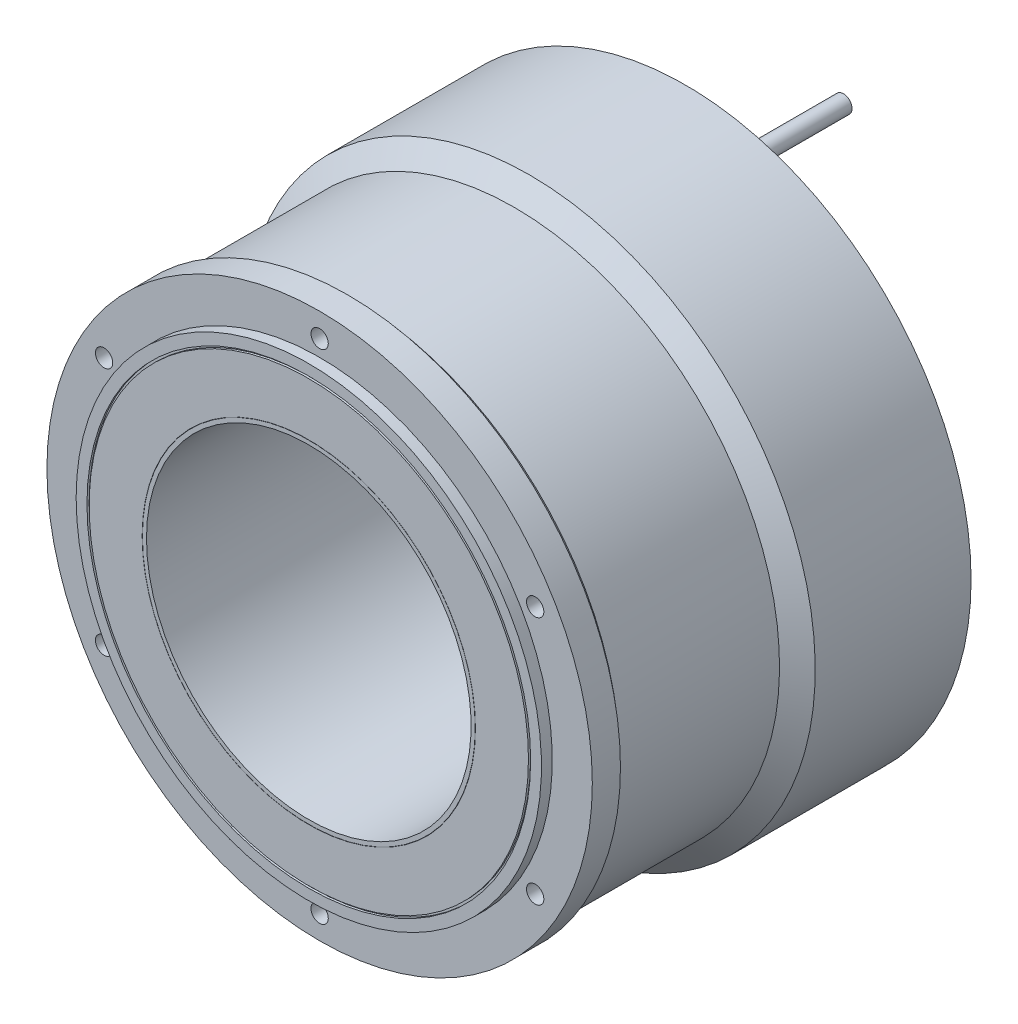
ISO-10303-21;
HEADER;
FILE_DESCRIPTION(('STEP AP214'),'2;1');
FILE_NAME('part.step','',(''),(''),'','','');
FILE_SCHEMA(('AUTOMOTIVE_DESIGN { 1 0 10303 214 1 1 1 1 }'));
ENDSEC;
DATA;
#1=APPLICATION_CONTEXT('core data for automotive mechanical design processes');
#2=APPLICATION_PROTOCOL_DEFINITION('international standard','automotive_design',2000,#1);
#3=PRODUCT_CONTEXT('',#1,'mechanical');
#4=PRODUCT('Part','Part','',(#3));
#5=PRODUCT_RELATED_PRODUCT_CATEGORY('part','',(#4));
#6=PRODUCT_DEFINITION_FORMATION('','',#4);
#7=PRODUCT_DEFINITION_CONTEXT('part definition',#1,'design');
#8=PRODUCT_DEFINITION('design','',#6,#7);
#9=PRODUCT_DEFINITION_SHAPE('','',#8);
#10=(LENGTH_UNIT() NAMED_UNIT(*) SI_UNIT(.MILLI.,.METRE.));
#11=(NAMED_UNIT(*) PLANE_ANGLE_UNIT() SI_UNIT($,.RADIAN.));
#12=(NAMED_UNIT(*) SI_UNIT($,.STERADIAN.) SOLID_ANGLE_UNIT());
#13=UNCERTAINTY_MEASURE_WITH_UNIT(LENGTH_MEASURE(1.E-05),#10,'distance_accuracy_value','');
#14=(GEOMETRIC_REPRESENTATION_CONTEXT(3) GLOBAL_UNCERTAINTY_ASSIGNED_CONTEXT((#13)) GLOBAL_UNIT_ASSIGNED_CONTEXT((#10,
#11,#12)) REPRESENTATION_CONTEXT('',''));
#15=CARTESIAN_POINT('',(0.,0.,0.));
#16=DIRECTION('',(0.,0.,1.));
#17=DIRECTION('',(1.,0.,0.));
#18=AXIS2_PLACEMENT_3D('',#15,#16,#17);
#19=CARTESIAN_POINT('',(-98.111250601,51.970329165,168.));
#20=DIRECTION('',(0.,0.,1.));
#21=DIRECTION('',(0.499999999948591,0.86602540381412,0.));
#22=AXIS2_PLACEMENT_3D('',#19,#20,#21);
#23=PLANE('',#22);
#24=CARTESIAN_POINT('',(-99.592921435,57.5,168.));
#25=DIRECTION('',(0.,0.,1.));
#26=DIRECTION('',(1.,0.,0.));
#27=AXIS2_PLACEMENT_3D('',#24,#25,#26);
#28=CIRCLE('',#27,4.);
#29=CARTESIAN_POINT('',(-95.592921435,57.5,168.));
#30=VERTEX_POINT('',#29);
#31=EDGE_CURVE('E20',#30,#30,#28,.F.);
#32=ORIENTED_EDGE('',*,*,#31,.F.);
#33=EDGE_LOOP('',(#32));
#34=FACE_BOUND('',#33,.T.);
#35=ADVANCED_FACE('F16',(#34),#23,.T.);
#36=CARTESIAN_POINT('',(-94.063250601,-58.981670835,168.));
#37=DIRECTION('',(0.,0.,1.));
#38=DIRECTION('',(-0.499999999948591,0.86602540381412,0.));
#39=AXIS2_PLACEMENT_3D('',#36,#37,#38);
#40=PLANE('',#39);
#41=CARTESIAN_POINT('',(-99.592921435,-57.5,168.));
#42=DIRECTION('',(0.,0.,1.));
#43=DIRECTION('',(1.,0.,0.));
#44=AXIS2_PLACEMENT_3D('',#41,#42,#43);
#45=CIRCLE('',#44,4.);
#46=CARTESIAN_POINT('',(-95.592921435,-57.5,168.));
#47=VERTEX_POINT('',#46);
#48=EDGE_CURVE('E492',#47,#47,#45,.F.);
#49=ORIENTED_EDGE('',*,*,#48,.F.);
#50=EDGE_LOOP('',(#49));
#51=FACE_BOUND('',#50,.T.);
#52=ADVANCED_FACE('F502',(#51),#40,.T.);
#53=CARTESIAN_POINT('',(4.048,-110.952,168.));
#54=DIRECTION('',(0.,0.,1.));
#55=DIRECTION('',(-1.,0.,0.));
#56=AXIS2_PLACEMENT_3D('',#53,#54,#55);
#57=PLANE('',#56);
#58=CARTESIAN_POINT('',(0.,-115.,168.));
#59=DIRECTION('',(0.,0.,1.));
#60=DIRECTION('',(1.,0.,0.));
#61=AXIS2_PLACEMENT_3D('',#58,#59,#60);
#62=CIRCLE('',#61,4.);
#63=CARTESIAN_POINT('',(4.,-115.,168.));
#64=VERTEX_POINT('',#63);
#65=EDGE_CURVE('E490',#64,#64,#62,.F.);
#66=ORIENTED_EDGE('',*,*,#65,.F.);
#67=EDGE_LOOP('',(#66));
#68=FACE_BOUND('',#67,.T.);
#69=ADVANCED_FACE('F508',(#68),#57,.T.);
#70=CARTESIAN_POINT('',(98.111250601,-51.970329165,168.));
#71=DIRECTION('',(0.,0.,1.));
#72=DIRECTION('',(-0.499999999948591,-0.86602540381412,0.));
#73=AXIS2_PLACEMENT_3D('',#70,#71,#72);
#74=PLANE('',#73);
#75=CARTESIAN_POINT('',(99.592921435,-57.5,168.));
#76=DIRECTION('',(0.,0.,1.));
#77=DIRECTION('',(1.,0.,0.));
#78=AXIS2_PLACEMENT_3D('',#75,#76,#77);
#79=CIRCLE('',#78,4.);
#80=CARTESIAN_POINT('',(103.592921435,-57.5,168.));
#81=VERTEX_POINT('',#80);
#82=EDGE_CURVE('E487',#81,#81,#79,.F.);
#83=ORIENTED_EDGE('',*,*,#82,.F.);
#84=EDGE_LOOP('',(#83));
#85=FACE_BOUND('',#84,.T.);
#86=ADVANCED_FACE('F2398',(#85),#74,.T.);
#87=CARTESIAN_POINT('',(94.063250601,58.981670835,168.));
#88=DIRECTION('',(0.,0.,1.));
#89=DIRECTION('',(0.499999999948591,-0.86602540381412,0.));
#90=AXIS2_PLACEMENT_3D('',#87,#88,#89);
#91=PLANE('',#90);
#92=CARTESIAN_POINT('',(99.592921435,57.5,168.));
#93=DIRECTION('',(0.,0.,1.));
#94=DIRECTION('',(1.,0.,0.));
#95=AXIS2_PLACEMENT_3D('',#92,#93,#94);
#96=CIRCLE('',#95,4.);
#97=CARTESIAN_POINT('',(103.592921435,57.5,168.));
#98=VERTEX_POINT('',#97);
#99=EDGE_CURVE('E484',#98,#98,#96,.F.);
#100=ORIENTED_EDGE('',*,*,#99,.F.);
#101=EDGE_LOOP('',(#100));
#102=FACE_BOUND('',#101,.T.);
#103=ADVANCED_FACE('F1381',(#102),#91,.T.);
#104=CARTESIAN_POINT('',(-4.048,110.952,168.));
#105=DIRECTION('',(0.,0.,1.));
#106=DIRECTION('',(1.,0.,0.));
#107=AXIS2_PLACEMENT_3D('',#104,#105,#106);
#108=PLANE('',#107);
#109=CARTESIAN_POINT('',(0.,115.,168.));
#110=DIRECTION('',(0.,0.,1.));
#111=DIRECTION('',(1.,0.,0.));
#112=AXIS2_PLACEMENT_3D('',#109,#110,#111);
#113=CIRCLE('',#112,4.);
#114=CARTESIAN_POINT('',(4.,115.,168.));
#115=VERTEX_POINT('',#114);
#116=EDGE_CURVE('E481',#115,#115,#113,.F.);
#117=ORIENTED_EDGE('',*,*,#116,.F.);
#118=EDGE_LOOP('',(#117));
#119=FACE_BOUND('',#118,.T.);
#120=ADVANCED_FACE('F1376',(#119),#108,.T.);
#121=CARTESIAN_POINT('',(-99.592921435,57.5,168.));
#122=DIRECTION('',(0.,0.,1.));
#123=DIRECTION('',(1.,0.,0.));
#124=AXIS2_PLACEMENT_3D('',#121,#122,#123);
#125=CYLINDRICAL_SURFACE('',#124,4.);
#126=CARTESIAN_POINT('',(-99.592921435,57.5,180.));
#127=DIRECTION('',(0.,0.,1.));
#128=DIRECTION('',(1.,0.,0.));
#129=AXIS2_PLACEMENT_3D('',#126,#127,#128);
#130=CIRCLE('',#129,4.);
#131=CARTESIAN_POINT('',(-95.592921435,57.5,180.));
#132=VERTEX_POINT('',#131);
#133=EDGE_CURVE('E475',#132,#132,#130,.F.);
#134=ORIENTED_EDGE('',*,*,#133,.F.);
#135=EDGE_LOOP('',(#134));
#136=FACE_BOUND('',#135,.T.);
#137=ORIENTED_EDGE('',*,*,#31,.T.);
#138=EDGE_LOOP('',(#137));
#139=FACE_BOUND('',#138,.T.);
#140=ADVANCED_FACE('F499',(#136,#139),#125,.F.);
#141=CARTESIAN_POINT('',(-99.592921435,-57.5,168.));
#142=DIRECTION('',(0.,0.,1.));
#143=DIRECTION('',(1.,0.,0.));
#144=AXIS2_PLACEMENT_3D('',#141,#142,#143);
#145=CYLINDRICAL_SURFACE('',#144,4.);
#146=CARTESIAN_POINT('',(-99.592921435,-57.5,180.));
#147=DIRECTION('',(0.,0.,1.));
#148=DIRECTION('',(1.,0.,0.));
#149=AXIS2_PLACEMENT_3D('',#146,#147,#148);
#150=CIRCLE('',#149,4.);
#151=CARTESIAN_POINT('',(-95.592921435,-57.5,180.));
#152=VERTEX_POINT('',#151);
#153=EDGE_CURVE('E472',#152,#152,#150,.F.);
#154=ORIENTED_EDGE('',*,*,#153,.F.);
#155=EDGE_LOOP('',(#154));
#156=FACE_BOUND('',#155,.T.);
#157=ORIENTED_EDGE('',*,*,#48,.T.);
#158=EDGE_LOOP('',(#157));
#159=FACE_BOUND('',#158,.T.);
#160=ADVANCED_FACE('F1371',(#156,#159),#145,.F.);
#161=CARTESIAN_POINT('',(0.,-115.,168.));
#162=DIRECTION('',(0.,0.,1.));
#163=DIRECTION('',(1.,0.,0.));
#164=AXIS2_PLACEMENT_3D('',#161,#162,#163);
#165=CYLINDRICAL_SURFACE('',#164,4.);
#166=CARTESIAN_POINT('',(0.,-115.,180.));
#167=DIRECTION('',(0.,0.,1.));
#168=DIRECTION('',(1.,0.,0.));
#169=AXIS2_PLACEMENT_3D('',#166,#167,#168);
#170=CIRCLE('',#169,4.);
#171=CARTESIAN_POINT('',(4.,-115.,180.));
#172=VERTEX_POINT('',#171);
#173=EDGE_CURVE('E469',#172,#172,#170,.F.);
#174=ORIENTED_EDGE('',*,*,#173,.F.);
#175=EDGE_LOOP('',(#174));
#176=FACE_BOUND('',#175,.T.);
#177=ORIENTED_EDGE('',*,*,#65,.T.);
#178=EDGE_LOOP('',(#177));
#179=FACE_BOUND('',#178,.T.);
#180=ADVANCED_FACE('F1367',(#176,#179),#165,.F.);
#181=CARTESIAN_POINT('',(99.592921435,-57.5,168.));
#182=DIRECTION('',(0.,0.,1.));
#183=DIRECTION('',(1.,0.,0.));
#184=AXIS2_PLACEMENT_3D('',#181,#182,#183);
#185=CYLINDRICAL_SURFACE('',#184,4.);
#186=CARTESIAN_POINT('',(99.592921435,-57.5,180.));
#187=DIRECTION('',(0.,0.,1.));
#188=DIRECTION('',(1.,0.,0.));
#189=AXIS2_PLACEMENT_3D('',#186,#187,#188);
#190=CIRCLE('',#189,4.);
#191=CARTESIAN_POINT('',(103.592921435,-57.5,180.));
#192=VERTEX_POINT('',#191);
#193=EDGE_CURVE('E466',#192,#192,#190,.F.);
#194=ORIENTED_EDGE('',*,*,#193,.F.);
#195=EDGE_LOOP('',(#194));
#196=FACE_BOUND('',#195,.T.);
#197=ORIENTED_EDGE('',*,*,#82,.T.);
#198=EDGE_LOOP('',(#197));
#199=FACE_BOUND('',#198,.T.);
#200=ADVANCED_FACE('F1363',(#196,#199),#185,.F.);
#201=CARTESIAN_POINT('',(99.592921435,57.5,168.));
#202=DIRECTION('',(0.,0.,1.));
#203=DIRECTION('',(1.,0.,0.));
#204=AXIS2_PLACEMENT_3D('',#201,#202,#203);
#205=CYLINDRICAL_SURFACE('',#204,4.);
#206=CARTESIAN_POINT('',(99.592921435,57.5,180.));
#207=DIRECTION('',(0.,0.,1.));
#208=DIRECTION('',(1.,0.,0.));
#209=AXIS2_PLACEMENT_3D('',#206,#207,#208);
#210=CIRCLE('',#209,4.);
#211=CARTESIAN_POINT('',(103.592921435,57.5,180.));
#212=VERTEX_POINT('',#211);
#213=EDGE_CURVE('E463',#212,#212,#210,.F.);
#214=ORIENTED_EDGE('',*,*,#213,.F.);
#215=EDGE_LOOP('',(#214));
#216=FACE_BOUND('',#215,.T.);
#217=ORIENTED_EDGE('',*,*,#99,.T.);
#218=EDGE_LOOP('',(#217));
#219=FACE_BOUND('',#218,.T.);
#220=ADVANCED_FACE('F1359',(#216,#219),#205,.F.);
#221=CARTESIAN_POINT('',(0.,115.,168.));
#222=DIRECTION('',(0.,0.,1.));
#223=DIRECTION('',(1.,0.,0.));
#224=AXIS2_PLACEMENT_3D('',#221,#222,#223);
#225=CYLINDRICAL_SURFACE('',#224,4.);
#226=CARTESIAN_POINT('',(0.,115.,180.));
#227=DIRECTION('',(0.,0.,1.));
#228=DIRECTION('',(1.,0.,0.));
#229=AXIS2_PLACEMENT_3D('',#226,#227,#228);
#230=CIRCLE('',#229,4.);
#231=CARTESIAN_POINT('',(4.,115.,180.));
#232=VERTEX_POINT('',#231);
#233=EDGE_CURVE('E460',#232,#232,#230,.F.);
#234=ORIENTED_EDGE('',*,*,#233,.F.);
#235=EDGE_LOOP('',(#234));
#236=FACE_BOUND('',#235,.T.);
#237=ORIENTED_EDGE('',*,*,#116,.T.);
#238=EDGE_LOOP('',(#237));
#239=FACE_BOUND('',#238,.T.);
#240=ADVANCED_FACE('F1355',(#236,#239),#225,.F.);
#241=CARTESIAN_POINT('',(0.,0.,185.));
#242=DIRECTION('',(0.,0.,-1.));
#243=DIRECTION('',(-1.,0.,0.));
#244=AXIS2_PLACEMENT_3D('',#241,#242,#243);
#245=CYLINDRICAL_SURFACE('',#244,107.5);
#246=CARTESIAN_POINT('',(0.,0.,185.));
#247=DIRECTION('',(0.,0.,-1.));
#248=DIRECTION('',(-1.,0.,0.));
#249=AXIS2_PLACEMENT_3D('',#246,#247,#248);
#250=CIRCLE('',#249,107.5);
#251=CARTESIAN_POINT('',(-107.5,0.,185.));
#252=VERTEX_POINT('',#251);
#253=EDGE_CURVE('E478',#252,#252,#250,.F.);
#254=ORIENTED_EDGE('',*,*,#253,.F.);
#255=EDGE_LOOP('',(#254));
#256=FACE_BOUND('',#255,.T.);
#257=CARTESIAN_POINT('',(0.,0.,180.));
#258=DIRECTION('',(0.,0.,-1.));
#259=DIRECTION('',(-1.,0.,0.));
#260=AXIS2_PLACEMENT_3D('',#257,#258,#259);
#261=CIRCLE('',#260,107.5);
#262=CARTESIAN_POINT('',(-107.5,0.,180.));
#263=VERTEX_POINT('',#262);
#264=EDGE_CURVE('E457',#263,#263,#261,.T.);
#265=ORIENTED_EDGE('',*,*,#264,.F.);
#266=EDGE_LOOP('',(#265));
#267=FACE_BOUND('',#266,.T.);
#268=ADVANCED_FACE('F1351',(#256,#267),#245,.T.);
#269=CARTESIAN_POINT('',(-108.79,108.79,185.));
#270=DIRECTION('',(0.,0.,1.));
#271=DIRECTION('',(0.,-1.,0.));
#272=AXIS2_PLACEMENT_3D('',#269,#270,#271);
#273=PLANE('',#272);
#274=CARTESIAN_POINT('',(0.,0.,185.));
#275=DIRECTION('',(0.,0.,1.));
#276=DIRECTION('',(1.,0.,0.));
#277=AXIS2_PLACEMENT_3D('',#274,#275,#276);
#278=CIRCLE('',#277,102.5);
#279=CARTESIAN_POINT('',(102.5,0.,185.));
#280=VERTEX_POINT('',#279);
#281=EDGE_CURVE('E454',#280,#280,#278,.T.);
#282=ORIENTED_EDGE('',*,*,#281,.F.);
#283=EDGE_LOOP('',(#282));
#284=FACE_BOUND('',#283,.T.);
#285=ORIENTED_EDGE('',*,*,#253,.T.);
#286=EDGE_LOOP('',(#285));
#287=FACE_BOUND('',#286,.T.);
#288=ADVANCED_FACE('F1354',(#284,#287),#273,.T.);
#289=CARTESIAN_POINT('',(-127.512,127.512,180.));
#290=DIRECTION('',(0.,0.,1.));
#291=DIRECTION('',(0.,-1.,0.));
#292=AXIS2_PLACEMENT_3D('',#289,#290,#291);
#293=PLANE('',#292);
#294=ORIENTED_EDGE('',*,*,#264,.T.);
#295=EDGE_LOOP('',(#294));
#296=FACE_BOUND('',#295,.T.);
#297=ORIENTED_EDGE('',*,*,#233,.T.);
#298=EDGE_LOOP('',(#297));
#299=FACE_BOUND('',#298,.T.);
#300=ORIENTED_EDGE('',*,*,#213,.T.);
#301=EDGE_LOOP('',(#300));
#302=FACE_BOUND('',#301,.T.);
#303=ORIENTED_EDGE('',*,*,#193,.T.);
#304=EDGE_LOOP('',(#303));
#305=FACE_BOUND('',#304,.T.);
#306=ORIENTED_EDGE('',*,*,#173,.T.);
#307=EDGE_LOOP('',(#306));
#308=FACE_BOUND('',#307,.T.);
#309=ORIENTED_EDGE('',*,*,#153,.T.);
#310=EDGE_LOOP('',(#309));
#311=FACE_BOUND('',#310,.T.);
#312=ORIENTED_EDGE('',*,*,#133,.T.);
#313=EDGE_LOOP('',(#312));
#314=FACE_BOUND('',#313,.T.);
#315=CARTESIAN_POINT('',(0.,0.,180.));
#316=DIRECTION('',(0.,0.,-1.));
#317=DIRECTION('',(-1.,0.,0.));
#318=AXIS2_PLACEMENT_3D('',#315,#316,#317);
#319=CIRCLE('',#318,126.);
#320=CARTESIAN_POINT('',(-126.,0.,180.));
#321=VERTEX_POINT('',#320);
#322=EDGE_CURVE('E451',#321,#321,#319,.F.);
#323=ORIENTED_EDGE('',*,*,#322,.T.);
#324=EDGE_LOOP('',(#323));
#325=FACE_BOUND('',#324,.T.);
#326=ADVANCED_FACE('F1349',(#296,#299,#302,#305,#308,#311,#314,#325),#293,.T.);
#327=CARTESIAN_POINT('',(0.,0.,184.));
#328=DIRECTION('',(0.,0.,1.));
#329=DIRECTION('',(1.,0.,0.));
#330=AXIS2_PLACEMENT_3D('',#327,#328,#329);
#331=CYLINDRICAL_SURFACE('',#330,102.5);
#332=ORIENTED_EDGE('',*,*,#281,.T.);
#333=EDGE_LOOP('',(#332));
#334=FACE_BOUND('',#333,.T.);
#335=CARTESIAN_POINT('',(0.,0.,184.));
#336=DIRECTION('',(0.,0.,1.));
#337=DIRECTION('',(1.,0.,0.));
#338=AXIS2_PLACEMENT_3D('',#335,#336,#337);
#339=CIRCLE('',#338,102.5);
#340=CARTESIAN_POINT('',(102.5,0.,184.));
#341=VERTEX_POINT('',#340);
#342=EDGE_CURVE('E448',#341,#341,#339,.T.);
#343=ORIENTED_EDGE('',*,*,#342,.F.);
#344=EDGE_LOOP('',(#343));
#345=FACE_BOUND('',#344,.T.);
#346=ADVANCED_FACE('F1345',(#334,#345),#331,.F.);
#347=CARTESIAN_POINT('',(0.,0.,180.));
#348=DIRECTION('',(0.,0.,-1.));
#349=DIRECTION('',(-1.,0.,0.));
#350=AXIS2_PLACEMENT_3D('',#347,#348,#349);
#351=CYLINDRICAL_SURFACE('',#350,126.);
#352=ORIENTED_EDGE('',*,*,#322,.F.);
#353=EDGE_LOOP('',(#352));
#354=FACE_BOUND('',#353,.T.);
#355=CARTESIAN_POINT('',(0.,0.,167.));
#356=DIRECTION('',(0.,0.,1.));
#357=DIRECTION('',(0.,-1.,0.));
#358=AXIS2_PLACEMENT_3D('',#355,#356,#357);
#359=CIRCLE('',#358,126.);
#360=CARTESIAN_POINT('',(0.,-126.,167.));
#361=VERTEX_POINT('',#360);
#362=EDGE_CURVE('E447',#361,#361,#359,.T.);
#363=ORIENTED_EDGE('',*,*,#362,.T.);
#364=EDGE_LOOP('',(#363));
#365=FACE_BOUND('',#364,.T.);
#366=ADVANCED_FACE('F1342',(#354,#365),#351,.T.);
#367=CARTESIAN_POINT('',(-103.73,-103.73,184.));
#368=DIRECTION('',(0.,0.,1.));
#369=DIRECTION('',(1.,0.,0.));
#370=AXIS2_PLACEMENT_3D('',#367,#368,#369);
#371=PLANE('',#370);
#372=CARTESIAN_POINT('',(0.,0.,184.));
#373=DIRECTION('',(0.,0.,1.));
#374=DIRECTION('',(1.,0.,0.));
#375=AXIS2_PLACEMENT_3D('',#372,#373,#374);
#376=CIRCLE('',#375,101.5);
#377=CARTESIAN_POINT('',(101.5,0.,184.));
#378=VERTEX_POINT('',#377);
#379=EDGE_CURVE('E444',#378,#378,#376,.F.);
#380=ORIENTED_EDGE('',*,*,#379,.T.);
#381=EDGE_LOOP('',(#380));
#382=FACE_BOUND('',#381,.T.);
#383=ORIENTED_EDGE('',*,*,#342,.T.);
#384=EDGE_LOOP('',(#383));
#385=FACE_BOUND('',#384,.T.);
#386=ADVANCED_FACE('F1337',(#382,#385),#371,.T.);
#387=CARTESIAN_POINT('',(0.,0.,164.));
#388=DIRECTION('',(0.,0.,1.));
#389=DIRECTION('',(1.,0.,0.));
#390=AXIS2_PLACEMENT_3D('',#387,#388,#389);
#391=CONICAL_SURFACE('',#390,122.5,0.862170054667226);
#392=CARTESIAN_POINT('',(0.,0.,164.));
#393=DIRECTION('',(0.,0.,-1.));
#394=DIRECTION('',(0.,1.,0.));
#395=AXIS2_PLACEMENT_3D('',#392,#393,#394);
#396=CIRCLE('',#395,122.5);
#397=CARTESIAN_POINT('',(0.,122.5,164.));
#398=VERTEX_POINT('',#397);
#399=EDGE_CURVE('E443',#398,#398,#396,.F.);
#400=ORIENTED_EDGE('',*,*,#399,.T.);
#401=EDGE_LOOP('',(#400));
#402=FACE_BOUND('',#401,.T.);
#403=ORIENTED_EDGE('',*,*,#362,.F.);
#404=EDGE_LOOP('',(#403));
#405=FACE_BOUND('',#404,.T.);
#406=ADVANCED_FACE('F1331',(#402,#405),#391,.T.);
#407=CARTESIAN_POINT('',(0.,0.,184.));
#408=DIRECTION('',(0.,0.,1.));
#409=DIRECTION('',(1.,0.,0.));
#410=AXIS2_PLACEMENT_3D('',#407,#408,#409);
#411=CYLINDRICAL_SURFACE('',#410,101.5);
#412=ORIENTED_EDGE('',*,*,#379,.F.);
#413=EDGE_LOOP('',(#412));
#414=FACE_BOUND('',#413,.T.);
#415=CARTESIAN_POINT('',(0.,0.,185.));
#416=DIRECTION('',(0.,0.,1.));
#417=DIRECTION('',(1.,0.,0.));
#418=AXIS2_PLACEMENT_3D('',#415,#416,#417);
#419=CIRCLE('',#418,101.5);
#420=CARTESIAN_POINT('',(101.5,0.,185.));
#421=VERTEX_POINT('',#420);
#422=EDGE_CURVE('E420',#421,#421,#419,.T.);
#423=ORIENTED_EDGE('',*,*,#422,.F.);
#424=EDGE_LOOP('',(#423));
#425=FACE_BOUND('',#424,.T.);
#426=ADVANCED_FACE('F1329',(#414,#425),#411,.T.);
#427=CARTESIAN_POINT('',(0.,0.,43.));
#428=DIRECTION('',(0.,0.,-1.));
#429=DIRECTION('',(-1.,0.,0.));
#430=AXIS2_PLACEMENT_3D('',#427,#428,#429);
#431=CYLINDRICAL_SURFACE('',#430,132.1);
#432=DIRECTION('',(0.,0.,1.));
#433=VECTOR('',#432,1.);
#434=CARTESIAN_POINT('',(-127.09227207,36.027272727,33.));
#435=LINE('',#434,#433);
#436=CARTESIAN_POINT('',(-127.092272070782,36.0272727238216,23.));
#437=VERTEX_POINT('',#436);
#438=CARTESIAN_POINT('',(-127.09227206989,36.0272727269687,43.));
#439=VERTEX_POINT('',#438);
#440=EDGE_CURVE('E434',#437,#439,#435,.T.);
#441=ORIENTED_EDGE('',*,*,#440,.F.);
#442=CARTESIAN_POINT('',(0.,0.,23.));
#443=DIRECTION('',(0.,0.,-1.));
#444=DIRECTION('',(-1.,0.,0.));
#445=AXIS2_PLACEMENT_3D('',#442,#443,#444);
#446=CIRCLE('',#445,132.1);
#447=CARTESIAN_POINT('',(-132.076305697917,2.50189393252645,23.));
#448=VERTEX_POINT('',#447);
#449=EDGE_CURVE('E416',#448,#437,#446,.T.);
#450=ORIENTED_EDGE('',*,*,#449,.F.);
#451=DIRECTION('',(0.,0.,1.));
#452=VECTOR('',#451,1.);
#453=CARTESIAN_POINT('',(-132.076305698,2.50189394,33.));
#454=LINE('',#453,#452);
#455=CARTESIAN_POINT('',(-132.076305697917,2.50189393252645,43.));
#456=VERTEX_POINT('',#455);
#457=EDGE_CURVE('E409',#448,#456,#454,.T.);
#458=ORIENTED_EDGE('',*,*,#457,.T.);
#459=CARTESIAN_POINT('',(0.,0.,43.));
#460=DIRECTION('',(0.,0.,-1.));
#461=DIRECTION('',(-1.,0.,0.));
#462=AXIS2_PLACEMENT_3D('',#459,#460,#461);
#463=CIRCLE('',#462,132.1);
#464=EDGE_CURVE('E413',#439,#456,#463,.F.);
#465=ORIENTED_EDGE('',*,*,#464,.F.);
#466=EDGE_LOOP('',(#441,#450,#458,#465));
#467=FACE_BOUND('',#466,.T.);
#468=ADVANCED_FACE('F411',(#467),#431,.T.);
#469=CARTESIAN_POINT('',(0.,0.,40.303698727));
#470=DIRECTION('',(0.,0.,-1.));
#471=DIRECTION('',(-1.,0.,0.));
#472=AXIS2_PLACEMENT_3D('',#469,#470,#471);
#473=CYLINDRICAL_SURFACE('',#472,132.1);
#474=CARTESIAN_POINT('',(-129.451425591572,-26.3199242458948,23.));
#475=CARTESIAN_POINT('',(-129.444691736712,-26.3530441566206,23.0000018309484));
#476=CARTESIAN_POINT('',(-129.437949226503,-26.3861409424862,23.0013710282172));
#477=CARTESIAN_POINT('',(-129.424470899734,-26.4521732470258,23.0068407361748));
#478=CARTESIAN_POINT('',(-129.417735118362,-26.4851083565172,23.0109462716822));
#479=CARTESIAN_POINT('',(-129.397455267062,-26.5840764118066,23.0274819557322));
#480=CARTESIAN_POINT('',(-129.383997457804,-26.6494913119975,23.0441316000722));
#481=CARTESIAN_POINT('',(-129.364307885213,-26.744848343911,23.0771318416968));
#482=CARTESIAN_POINT('',(-129.357823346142,-26.7761933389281,23.0894805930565));
#483=CARTESIAN_POINT('',(-129.345055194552,-26.8378032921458,23.1167926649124));
#484=CARTESIAN_POINT('',(-129.338771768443,-26.8680672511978,23.1317583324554));
#485=CARTESIAN_POINT('',(-129.320057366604,-26.9580517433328,23.1811135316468));
#486=CARTESIAN_POINT('',(-129.308021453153,-27.0157105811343,23.2195299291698));
#487=CARTESIAN_POINT('',(-129.285408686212,-27.1237194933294,23.3058270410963));
#488=CARTESIAN_POINT('',(-129.274831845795,-27.1740695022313,23.3537078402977));
#489=CARTESIAN_POINT('',(-129.255641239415,-27.2652038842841,23.456803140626));
#490=CARTESIAN_POINT('',(-129.246997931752,-27.3061325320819,23.5118834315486));
#491=CARTESIAN_POINT('',(-129.235590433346,-27.3600530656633,23.5992111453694));
#492=CARTESIAN_POINT('',(-129.232047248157,-27.3767824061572,23.6291079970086));
#493=CARTESIAN_POINT('',(-129.225499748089,-27.4076715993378,23.6903025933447));
#494=CARTESIAN_POINT('',(-129.222496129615,-27.4218281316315,23.7216020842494));
#495=CARTESIAN_POINT('',(-129.214480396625,-27.4595834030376,23.8157364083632));
#496=CARTESIAN_POINT('',(-129.210275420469,-27.4793549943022,23.8802484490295));
#497=CARTESIAN_POINT('',(-129.205723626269,-27.5007459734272,23.9787786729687));
#498=CARTESIAN_POINT('',(-129.204498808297,-27.5064993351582,24.0119320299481));
#499=CARTESIAN_POINT('',(-129.202650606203,-27.5151794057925,24.0786202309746));
#500=CARTESIAN_POINT('',(-129.202026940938,-27.5181074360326,24.1121548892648));
#501=CARTESIAN_POINT('',(-129.201386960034,-27.5211120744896,24.1788149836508));
#502=CARTESIAN_POINT('',(-129.201361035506,-27.5212337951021,24.2119383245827));
#503=CARTESIAN_POINT('',(-129.201891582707,-27.5187429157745,24.278038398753));
#504=CARTESIAN_POINT('',(-129.202447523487,-27.5161328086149,24.3110152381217));
#505=CARTESIAN_POINT('',(-129.204985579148,-27.5042138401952,24.409452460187));
#506=CARTESIAN_POINT('',(-129.207837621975,-27.4908177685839,24.4744519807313));
#507=CARTESIAN_POINT('',(-129.215000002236,-27.457130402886,24.589199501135));
#508=CARTESIAN_POINT('',(-129.218933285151,-27.4386187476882,24.6395098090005));
#509=CARTESIAN_POINT('',(-129.228154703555,-27.3951546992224,24.7370719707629));
#510=CARTESIAN_POINT('',(-129.23344142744,-27.3702090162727,24.7843269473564));
#511=CARTESIAN_POINT('',(-129.239361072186,-27.3422301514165,24.8296604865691));
#512=B_SPLINE_CURVE_WITH_KNOTS('',3,(#474,#475,#476,#477,#478,#479,#480,#481,#482,#483,#484,
#485,#486,#487,#488,#489,#490,#491,#492,#493,#494,#495,#496,#497,#498,#499,#500,#501,#502,#503,
#504,#505,#506,#507,#508,#509,#510,#511),.UNSPECIFIED.,.F.,.F.,(4,2,2,2,2,2,2,2,2,2,2,2,2,2,2,2,
2,2,4),(0.,0.101323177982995,0.202832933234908,0.408215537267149,0.511045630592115,
0.613968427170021,0.823817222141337,1.03366789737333,1.2400520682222,1.3432637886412,
1.44660777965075,1.6482526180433,1.74917147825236,1.85004311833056,1.9492920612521,
2.04845051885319,2.24667125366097,2.40746273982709,2.56808720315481),.UNSPECIFIED.);
#513=CARTESIAN_POINT('',(-129.451425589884,-26.319924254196,23.));
#514=VERTEX_POINT('',#513);
#515=CARTESIAN_POINT('',(-129.239361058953,-27.3422302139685,24.8296603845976));
#516=VERTEX_POINT('',#515);
#517=EDGE_CURVE('E849',#514,#516,#512,.T.);
#518=ORIENTED_EDGE('',*,*,#517,.T.);
#519=CARTESIAN_POINT('',(-130.674209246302,-19.3561627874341,37.7760698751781));
#520=CARTESIAN_POINT('',(-130.669039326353,-19.3910651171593,37.7194888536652));
#521=CARTESIAN_POINT('',(-130.663855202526,-19.4259668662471,37.6629087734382));
#522=CARTESIAN_POINT('',(-130.637863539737,-19.600472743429,37.3800130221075));
#523=CARTESIAN_POINT('',(-130.616842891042,-19.7400681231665,37.1537115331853));
#524=CARTESIAN_POINT('',(-130.510601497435,-20.438000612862,36.0222760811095));
#525=CARTESIAN_POINT('',(-130.421967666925,-20.9961952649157,35.1173730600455));
#526=CARTESIAN_POINT('',(-130.169971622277,-22.5199164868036,32.6472312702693));
#527=CARTESIAN_POINT('',(-129.999320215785,-23.4851130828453,31.0825274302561));
#528=CARTESIAN_POINT('',(-129.635939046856,-25.4144998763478,27.9547512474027));
#529=CARTESIAN_POINT('',(-129.443206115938,-26.3786899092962,26.3916791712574));
#530=CARTESIAN_POINT('',(-129.239361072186,-27.3422301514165,24.8296604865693));
#531=B_SPLINE_CURVE_WITH_KNOTS('',3,(#519,#520,#521,#522,#523,#524,#525,#526,#527,#528,#529,
#530),.UNSPECIFIED.,.F.,.F.,(4,2,2,2,2,4),(0.,0.200042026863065,1.00021040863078,
4.20090157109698,9.73982612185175,15.2795464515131),.UNSPECIFIED.);
#532=CARTESIAN_POINT('',(-130.674209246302,-19.356162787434,37.7760698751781));
#533=VERTEX_POINT('',#532);
#534=EDGE_CURVE('E843',#533,#516,#531,.T.);
#535=ORIENTED_EDGE('',*,*,#534,.F.);
#536=CARTESIAN_POINT('',(-130.674209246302,-19.356162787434,37.7760698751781));
#537=CARTESIAN_POINT('',(-130.679429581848,-19.3209196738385,37.8332156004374));
#538=CARTESIAN_POINT('',(-130.684801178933,-19.2845577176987,37.8896698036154));
#539=CARTESIAN_POINT('',(-130.70138833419,-19.1719293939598,38.0571994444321));
#540=CARTESIAN_POINT('',(-130.713041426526,-19.0923539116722,38.1660279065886));
#541=CARTESIAN_POINT('',(-130.737408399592,-18.9247775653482,38.3769456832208));
#542=CARTESIAN_POINT('',(-130.750122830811,-18.8367723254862,38.4790314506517));
#543=CARTESIAN_POINT('',(-130.776458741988,-18.6530547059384,38.6758504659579));
#544=CARTESIAN_POINT('',(-130.790080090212,-18.5573434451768,38.7705847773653));
#545=CARTESIAN_POINT('',(-130.818082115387,-18.3589059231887,38.9521989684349));
#546=CARTESIAN_POINT('',(-130.832462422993,-18.2561830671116,39.0390826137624));
#547=CARTESIAN_POINT('',(-130.85449205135,-18.0973687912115,39.162901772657));
#548=CARTESIAN_POINT('',(-130.861901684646,-18.0437164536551,39.2030416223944));
#549=CARTESIAN_POINT('',(-130.876862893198,-17.9348760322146,39.2811555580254));
#550=CARTESIAN_POINT('',(-130.884414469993,-17.8796879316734,39.3191296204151));
#551=CARTESIAN_POINT('',(-130.907297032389,-17.7116451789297,39.4299240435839));
#552=CARTESIAN_POINT('',(-130.922817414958,-17.5965887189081,39.4994010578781));
#553=CARTESIAN_POINT('',(-130.954209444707,-17.361426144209,39.6292184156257));
#554=CARTESIAN_POINT('',(-130.970081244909,-17.2413178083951,39.6895546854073));
#555=CARTESIAN_POINT('',(-131.002052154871,-16.9966920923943,39.8004941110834));
#556=CARTESIAN_POINT('',(-131.018151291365,-16.8721741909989,39.8510961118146));
#557=CARTESIAN_POINT('',(-131.050432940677,-16.6195734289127,39.9422036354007));
#558=CARTESIAN_POINT('',(-131.066615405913,-16.4914924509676,39.9827143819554));
#559=CARTESIAN_POINT('',(-131.090826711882,-16.2975271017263,40.0358729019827));
#560=CARTESIAN_POINT('',(-131.098875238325,-16.2326591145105,40.0523063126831));
#561=CARTESIAN_POINT('',(-131.114949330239,-16.1023096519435,40.0826481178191));
#562=CARTESIAN_POINT('',(-131.12297488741,-16.0368279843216,40.0965556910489));
#563=CARTESIAN_POINT('',(-131.147225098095,-15.8377201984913,40.1347477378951));
#564=CARTESIAN_POINT('',(-131.163391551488,-15.7032863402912,40.1549900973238));
#565=CARTESIAN_POINT('',(-131.195452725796,-15.4331365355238,40.184558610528));
#566=CARTESIAN_POINT('',(-131.211347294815,-15.2974199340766,40.1938788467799));
#567=CARTESIAN_POINT('',(-131.242779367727,-15.0253668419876,40.2018017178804));
#568=CARTESIAN_POINT('',(-131.258316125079,-14.8890296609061,40.2003836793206));
#569=CARTESIAN_POINT('',(-131.288904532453,-14.6168498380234,40.1866645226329));
#570=CARTESIAN_POINT('',(-131.303956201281,-14.4810071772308,40.1743638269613));
#571=CARTESIAN_POINT('',(-131.333481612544,-14.2107383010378,40.1388374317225));
#572=CARTESIAN_POINT('',(-131.347955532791,-14.0763116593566,40.115615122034));
#573=CARTESIAN_POINT('',(-131.376259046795,-13.8096538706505,40.0585104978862));
#574=CARTESIAN_POINT('',(-131.390088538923,-13.6774230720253,40.0246265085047));
#575=CARTESIAN_POINT('',(-131.417020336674,-13.4161836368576,39.9465013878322));
#576=CARTESIAN_POINT('',(-131.430123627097,-13.2871707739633,39.9022747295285));
#577=CARTESIAN_POINT('',(-131.455559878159,-13.0331143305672,39.8035052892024));
#578=CARTESIAN_POINT('',(-131.467893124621,-12.9080692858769,39.7489663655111));
#579=CARTESIAN_POINT('',(-131.486033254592,-12.7215244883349,39.6585338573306));
#580=CARTESIAN_POINT('',(-131.492135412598,-12.6582887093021,39.6262296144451));
#581=CARTESIAN_POINT('',(-131.504117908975,-12.5331927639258,39.5590425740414));
#582=CARTESIAN_POINT('',(-131.509998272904,-12.471332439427,39.5241600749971));
#583=CARTESIAN_POINT('',(-131.527289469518,-12.2880898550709,39.4157546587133));
#584=CARTESIAN_POINT('',(-131.538364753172,-12.1688981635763,39.3384021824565));
#585=CARTESIAN_POINT('',(-131.55425464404,-11.995476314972,39.2151917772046));
#586=CARTESIAN_POINT('',(-131.55942404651,-11.9386390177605,39.1729886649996));
#587=CARTESIAN_POINT('',(-131.569529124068,-11.8267560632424,39.0862212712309));
#588=CARTESIAN_POINT('',(-131.574464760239,-11.7717107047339,39.0416565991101));
#589=CARTESIAN_POINT('',(-131.588325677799,-11.6160638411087,38.910179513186));
#590=CARTESIAN_POINT('',(-131.59695438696,-11.517839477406,38.8203991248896));
#591=CARTESIAN_POINT('',(-131.613383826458,-11.3285575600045,38.6335007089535));
#592=CARTESIAN_POINT('',(-131.62118455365,-11.2375000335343,38.536382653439));
#593=CARTESIAN_POINT('',(-131.63233308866,-11.1058942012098,38.3843978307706));
#594=CARTESIAN_POINT('',(-131.635994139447,-11.0624075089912,38.3320751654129));
#595=CARTESIAN_POINT('',(-131.643094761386,-10.9775867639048,38.2257183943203));
#596=CARTESIAN_POINT('',(-131.646534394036,-10.9362521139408,38.1716847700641));
#597=CARTESIAN_POINT('',(-131.653215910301,-10.8555236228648,38.0616280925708));
#598=CARTESIAN_POINT('',(-131.656456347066,-10.8161443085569,38.0055943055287));
#599=CARTESIAN_POINT('',(-131.662718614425,-10.7396460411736,37.8919692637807));
#600=CARTESIAN_POINT('',(-131.665740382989,-10.7025277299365,37.8343775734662));
#601=CARTESIAN_POINT('',(-131.668653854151,-10.6665642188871,37.7760694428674));
#602=B_SPLINE_CURVE_WITH_KNOTS('',3,(#536,#537,#538,#539,#540,#541,#542,#543,#544,#545,#546,
#547,#548,#549,#550,#551,#552,#553,#554,#555,#556,#557,#558,#559,#560,#561,#562,#563,#564,#565,
#566,#567,#568,#569,#570,#571,#572,#573,#574,#575,#576,#577,#578,#579,#580,#581,#582,#583,#584,
#585,#586,#587,#588,#589,#590,#591,#592,#593,#594,#595,#596,#597,#598,#599,#600,#601),
.UNSPECIFIED.,.F.,.F.,(4,2,2,2,2,2,2,2,2,2,2,2,2,2,2,2,2,2,2,2,2,2,2,2,2,2,2,2,2,2,2,2,4),(0.,
0.202039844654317,0.607544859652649,1.01326152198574,1.41891937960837,1.82438161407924,
2.0265784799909,2.22877753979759,2.63423112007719,3.03986486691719,3.44554672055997,
3.85101813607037,4.0531742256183,4.25539592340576,4.66563762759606,5.07610149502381,
5.48735579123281,5.89859412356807,6.30970489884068,6.7208802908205,7.13148371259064,
7.54193381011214,7.75569291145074,7.96942730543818,8.39640286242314,8.60929640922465,
8.82222527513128,9.22186310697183,9.62150245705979,9.82585455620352,10.030149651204,
10.2357862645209,10.4414809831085),.UNSPECIFIED.);
#603=CARTESIAN_POINT('',(-131.668653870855,-10.6665640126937,37.7760691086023));
#604=VERTEX_POINT('',#603);
#605=EDGE_CURVE('E874',#533,#604,#602,.T.);
#606=ORIENTED_EDGE('',*,*,#605,.T.);
#607=CARTESIAN_POINT('',(-132.072801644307,-2.68049730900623,24.829660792));
#608=CARTESIAN_POINT('',(-132.072091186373,-2.71550280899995,24.8864090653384));
#609=CARTESIAN_POINT('',(-132.071366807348,-2.75050823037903,24.9431572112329));
#610=CARTESIAN_POINT('',(-132.067675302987,-2.92553497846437,25.226897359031));
#611=CARTESIAN_POINT('',(-132.06449935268,-3.06555509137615,25.4538873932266));
#612=CARTESIAN_POINT('',(-132.047505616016,-3.76565137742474,26.5888306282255));
#613=CARTESIAN_POINT('',(-132.030346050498,-4.32570591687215,27.4967487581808));
#614=CARTESIAN_POINT('',(-131.973952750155,-5.84943350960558,29.9669008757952));
#615=CARTESIAN_POINT('',(-131.927723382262,-6.81303717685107,31.5290223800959));
#616=CARTESIAN_POINT('',(-131.814086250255,-8.74002849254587,34.652915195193));
#617=CARTESIAN_POINT('',(-131.746675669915,-9.70341609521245,36.2146864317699));
#618=CARTESIAN_POINT('',(-131.668653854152,-10.6665642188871,37.7760694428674));
#619=B_SPLINE_CURVE_WITH_KNOTS('',3,(#607,#608,#609,#610,#611,#612,#613,#614,#615,#616,#617,
#618),.UNSPECIFIED.,.F.,.F.,(4,2,2,2,2,4),(0.,0.200040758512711,1.0002040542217,
4.20087399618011,9.70874375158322,15.2173461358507),.UNSPECIFIED.);
#620=CARTESIAN_POINT('',(-132.072801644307,-2.68049730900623,24.829660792));
#621=VERTEX_POINT('',#620);
#622=EDGE_CURVE('E823',#621,#604,#619,.T.);
#623=ORIENTED_EDGE('',*,*,#622,.F.);
#624=CARTESIAN_POINT('',(-132.072801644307,-2.68049730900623,24.829660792));
#625=CARTESIAN_POINT('',(-132.073161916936,-2.66274375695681,24.8009060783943));
#626=CARTESIAN_POINT('',(-132.073494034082,-2.64620545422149,24.7713981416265));
#627=CARTESIAN_POINT('',(-132.07410258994,-2.61565712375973,24.711034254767));
#628=CARTESIAN_POINT('',(-132.074378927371,-2.60165169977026,24.6801759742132));
#629=CARTESIAN_POINT('',(-132.074875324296,-2.57632843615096,24.6173667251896));
#630=CARTESIAN_POINT('',(-132.075095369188,-2.56501129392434,24.5854154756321));
#631=CARTESIAN_POINT('',(-132.075481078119,-2.54507310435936,24.5206790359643));
#632=CARTESIAN_POINT('',(-132.075646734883,-2.5364524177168,24.4878937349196));
#633=CARTESIAN_POINT('',(-132.075923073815,-2.52202242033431,24.421680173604));
#634=CARTESIAN_POINT('',(-132.076033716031,-2.51621515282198,24.3882514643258));
#635=CARTESIAN_POINT('',(-132.07619970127,-2.50748673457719,24.3210156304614));
#636=CARTESIAN_POINT('',(-132.076255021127,-2.50456679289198,24.2872083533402));
#637=CARTESIAN_POINT('',(-132.076339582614,-2.50010902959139,24.1860259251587));
#638=CARTESIAN_POINT('',(-132.076289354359,-2.50277141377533,24.118414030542));
#639=CARTESIAN_POINT('',(-132.075972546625,-2.51943255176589,23.984630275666));
#640=CARTESIAN_POINT('',(-132.07570595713,-2.53343183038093,23.9184584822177));
#641=CARTESIAN_POINT('',(-132.0749533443,-2.57236787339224,23.7893231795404));
#642=CARTESIAN_POINT('',(-132.074467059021,-2.59731769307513,23.7263636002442));
#643=CARTESIAN_POINT('',(-132.073271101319,-2.6574348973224,23.6055244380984));
#644=CARTESIAN_POINT('',(-132.072561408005,-2.69260323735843,23.547645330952));
#645=CARTESIAN_POINT('',(-132.070916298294,-2.77211864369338,23.4386813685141));
#646=CARTESIAN_POINT('',(-132.069981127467,-2.81645571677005,23.3875892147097));
#647=CARTESIAN_POINT('',(-132.067886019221,-2.91304157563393,23.2935406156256));
#648=CARTESIAN_POINT('',(-132.066726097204,-2.96528981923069,23.2505836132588));
#649=CARTESIAN_POINT('',(-132.064184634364,-3.07639836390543,23.173952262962));
#650=CARTESIAN_POINT('',(-132.062802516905,-3.13527574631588,23.1403027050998));
#651=CARTESIAN_POINT('',(-132.059835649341,-3.25784619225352,23.0833835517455));
#652=CARTESIAN_POINT('',(-132.058250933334,-3.32153844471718,23.0601122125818));
#653=CARTESIAN_POINT('',(-132.055259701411,-3.43817243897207,23.0283137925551));
#654=CARTESIAN_POINT('',(-132.053885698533,-3.49056134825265,23.0177161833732));
#655=CARTESIAN_POINT('',(-132.051050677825,-3.5962278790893,23.0035550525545));
#656=CARTESIAN_POINT('',(-132.049589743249,-3.64950461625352,22.9999849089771));
#657=CARTESIAN_POINT('',(-132.048094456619,-3.70280304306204,23.));
#658=B_SPLINE_CURVE_WITH_KNOTS('',3,(#624,#625,#626,#627,#628,#629,#630,#631,#632,#633,#634,
#635,#636,#637,#638,#639,#640,#641,#642,#643,#644,#645,#646,#647,#648,#649,#650,#651,#652,#653,
#654,#655,#656,#657),.UNSPECIFIED.,.F.,.F.,(4,2,2,2,2,2,2,2,2,2,2,2,2,2,2,2,4),(0.,
0.101361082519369,0.202904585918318,0.304474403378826,0.406057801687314,0.507714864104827,
0.609414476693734,0.811371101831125,1.01333707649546,1.21554449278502,1.4177708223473,
1.61977789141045,1.8217711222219,2.02429728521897,2.22678940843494,2.38673780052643,
2.54653540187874),.UNSPECIFIED.);
#659=CARTESIAN_POINT('',(-132.048094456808,-3.70280303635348,23.));
#660=VERTEX_POINT('',#659);
#661=EDGE_CURVE('E815',#621,#660,#658,.T.);
#662=ORIENTED_EDGE('',*,*,#661,.T.);
#663=CARTESIAN_POINT('',(0.,0.,23.));
#664=DIRECTION('',(0.,0.,-1.));
#665=DIRECTION('',(-1.,0.,0.));
#666=AXIS2_PLACEMENT_3D('',#663,#664,#665);
#667=CIRCLE('',#666,132.1);
#668=EDGE_CURVE('E855',#514,#660,#667,.T.);
#669=ORIENTED_EDGE('',*,*,#668,.F.);
#670=EDGE_LOOP('',(#518,#535,#606,#623,#662,#669));
#671=FACE_BOUND('',#670,.T.);
#672=ADVANCED_FACE('F830',(#671),#473,.T.);
#673=CARTESIAN_POINT('',(0.,0.,164.));
#674=DIRECTION('',(0.,0.,-1.));
#675=DIRECTION('',(-1.,0.,0.));
#676=AXIS2_PLACEMENT_3D('',#673,#674,#675);
#677=CYLINDRICAL_SURFACE('',#676,122.5);
#678=ORIENTED_EDGE('',*,*,#399,.F.);
#679=EDGE_LOOP('',(#678));
#680=FACE_BOUND('',#679,.T.);
#681=CARTESIAN_POINT('',(0.,0.,90.));
#682=DIRECTION('',(0.,0.,-1.));
#683=DIRECTION('',(0.,1.,0.));
#684=AXIS2_PLACEMENT_3D('',#681,#682,#683);
#685=CIRCLE('',#684,122.5);
#686=CARTESIAN_POINT('',(0.,122.5,90.));
#687=VERTEX_POINT('',#686);
#688=EDGE_CURVE('E882',#687,#687,#685,.F.);
#689=ORIENTED_EDGE('',*,*,#688,.T.);
#690=EDGE_LOOP('',(#689));
#691=FACE_BOUND('',#690,.T.);
#692=ADVANCED_FACE('F835',(#680,#691),#677,.T.);
#693=CARTESIAN_POINT('',(-102.718,102.718,185.));
#694=DIRECTION('',(0.,0.,1.));
#695=DIRECTION('',(0.,-1.,0.));
#696=AXIS2_PLACEMENT_3D('',#693,#694,#695);
#697=PLANE('',#696);
#698=CARTESIAN_POINT('',(0.,0.,185.));
#699=DIRECTION('',(0.,0.,1.));
#700=DIRECTION('',(1.,0.,0.));
#701=AXIS2_PLACEMENT_3D('',#698,#699,#700);
#702=CIRCLE('',#701,77.);
#703=CARTESIAN_POINT('',(77.,0.,185.));
#704=VERTEX_POINT('',#703);
#705=EDGE_CURVE('E880',#704,#704,#702,.T.);
#706=ORIENTED_EDGE('',*,*,#705,.F.);
#707=EDGE_LOOP('',(#706));
#708=FACE_BOUND('',#707,.T.);
#709=ORIENTED_EDGE('',*,*,#422,.T.);
#710=EDGE_LOOP('',(#709));
#711=FACE_BOUND('',#710,.T.);
#712=ADVANCED_FACE('F1323',(#708,#711),#697,.T.);
#713=CARTESIAN_POINT('',(-131.976323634,2.5,43.));
#714=DIRECTION('',(0.0189393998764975,0.999820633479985,0.));
#715=DIRECTION('',(0.,0.,-1.));
#716=AXIS2_PLACEMENT_3D('',#713,#714,#715);
#717=PLANE('',#716);
#718=DIRECTION('',(0.,0.,-1.));
#719=VECTOR('',#718,1.);
#720=CARTESIAN_POINT('',(-131.976323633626,2.50000003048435,47.));
#721=LINE('',#720,#719);
#722=CARTESIAN_POINT('',(-131.976323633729,2.50000002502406,23.000000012));
#723=VERTEX_POINT('',#722);
#724=CARTESIAN_POINT('',(-131.976323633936,2.50000001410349,42.999999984));
#725=VERTEX_POINT('',#724);
#726=EDGE_CURVE('E426',#723,#725,#721,.F.);
#727=ORIENTED_EDGE('',*,*,#726,.T.);
#728=DIRECTION('',(0.999820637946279,-0.018939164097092,0.));
#729=VECTOR('',#728,1.);
#730=CARTESIAN_POINT('',(-132.076305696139,2.5018939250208,43.));
#731=LINE('',#730,#729);
#732=EDGE_CURVE('E419',#456,#725,#731,.T.);
#733=ORIENTED_EDGE('',*,*,#732,.F.);
#734=ORIENTED_EDGE('',*,*,#457,.F.);
#735=DIRECTION('',(-0.999820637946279,0.018939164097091,0.));
#736=VECTOR('',#735,1.);
#737=CARTESIAN_POINT('',(-131.976323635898,2.5000000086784,23.));
#738=LINE('',#737,#736);
#739=EDGE_CURVE('E2483',#723,#448,#738,.T.);
#740=ORIENTED_EDGE('',*,*,#739,.F.);
#741=EDGE_LOOP('',(#727,#733,#734,#740));
#742=FACE_BOUND('',#741,.T.);
#743=ADVANCED_FACE('F424',(#742),#717,.F.);
#744=CARTESIAN_POINT('',(-132.106787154,2.298836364,43.));
#745=DIRECTION('',(0.,0.,1.));
#746=DIRECTION('',(1.,0.,0.));
#747=AXIS2_PLACEMENT_3D('',#744,#745,#746);
#748=PLANE('',#747);
#749=DIRECTION('',(0.962091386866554,-0.27272726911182,0.));
#750=VECTOR('',#749,1.);
#751=CARTESIAN_POINT('',(-127.0441675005,36.0136363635,43.));
#752=LINE('',#751,#750);
#753=CARTESIAN_POINT('',(-126.996062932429,35.999999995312,42.999999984));
#754=VERTEX_POINT('',#753);
#755=EDGE_CURVE('E432',#439,#754,#752,.T.);
#756=ORIENTED_EDGE('',*,*,#755,.F.);
#757=ORIENTED_EDGE('',*,*,#464,.T.);
#758=ORIENTED_EDGE('',*,*,#732,.T.);
#759=CARTESIAN_POINT('',(0.,0.,42.999999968));
#760=DIRECTION('',(0.,0.,-1.));
#761=DIRECTION('',(-1.,0.,0.));
#762=AXIS2_PLACEMENT_3D('',#759,#760,#761);
#763=CIRCLE('',#762,132.);
#764=EDGE_CURVE('E878',#725,#754,#763,.T.);
#765=ORIENTED_EDGE('',*,*,#764,.T.);
#766=EDGE_LOOP('',(#756,#757,#758,#765));
#767=FACE_BOUND('',#766,.T.);
#768=ADVANCED_FACE('F430',(#767),#748,.T.);
#769=CARTESIAN_POINT('',(-126.996062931,36.,43.));
#770=DIRECTION('',(0.27272726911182,0.962091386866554,0.));
#771=DIRECTION('',(0.,0.,-1.));
#772=AXIS2_PLACEMENT_3D('',#769,#770,#771);
#773=PLANE('',#772);
#774=ORIENTED_EDGE('',*,*,#440,.T.);
#775=ORIENTED_EDGE('',*,*,#755,.T.);
#776=DIRECTION('',(0.,0.,1.));
#777=VECTOR('',#776,1.);
#778=CARTESIAN_POINT('',(-126.996062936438,35.9999999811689,47.));
#779=LINE('',#778,#777);
#780=CARTESIAN_POINT('',(-126.996062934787,35.999999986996,23.000000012));
#781=VERTEX_POINT('',#780);
#782=EDGE_CURVE('E875',#754,#781,#779,.F.);
#783=ORIENTED_EDGE('',*,*,#782,.T.);
#784=DIRECTION('',(0.962091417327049,-0.27272716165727,0.));
#785=VECTOR('',#784,1.);
#786=CARTESIAN_POINT('',(-127.092272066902,36.0272727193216,23.));
#787=LINE('',#786,#785);
#788=EDGE_CURVE('E438',#437,#781,#787,.T.);
#789=ORIENTED_EDGE('',*,*,#788,.F.);
#790=EDGE_LOOP('',(#774,#775,#783,#789));
#791=FACE_BOUND('',#790,.T.);
#792=ADVANCED_FACE('F1408',(#791),#773,.T.);
#793=CARTESIAN_POINT('',(-126.965581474,2.298836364,23.));
#794=DIRECTION('',(0.,0.,-1.));
#795=DIRECTION('',(-1.,0.,0.));
#796=AXIS2_PLACEMENT_3D('',#793,#794,#795);
#797=PLANE('',#796);
#798=ORIENTED_EDGE('',*,*,#739,.T.);
#799=ORIENTED_EDGE('',*,*,#449,.T.);
#800=ORIENTED_EDGE('',*,*,#788,.T.);
#801=CARTESIAN_POINT('',(0.,0.,23.000000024));
#802=DIRECTION('',(0.,0.,-1.));
#803=DIRECTION('',(-1.,0.,0.));
#804=AXIS2_PLACEMENT_3D('',#801,#802,#803);
#805=CIRCLE('',#804,132.);
#806=EDGE_CURVE('E877',#781,#723,#805,.F.);
#807=ORIENTED_EDGE('',*,*,#806,.T.);
#808=EDGE_LOOP('',(#798,#799,#800,#807));
#809=FACE_BOUND('',#808,.T.);
#810=ADVANCED_FACE('F1411',(#809),#797,.T.);
#811=CARTESIAN_POINT('',(-131.674119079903,-10.6116095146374,37.6868494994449));
#812=CARTESIAN_POINT('',(-131.672632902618,-10.6299549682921,37.7165895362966));
#813=CARTESIAN_POINT('',(-131.671146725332,-10.6483004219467,37.7463295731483));
#814=CARTESIAN_POINT('',(-131.669660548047,-10.6666458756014,37.77606961));
#815=CARTESIAN_POINT('',(-131.65108333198,-10.8959640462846,38.1478200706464));
#816=CARTESIAN_POINT('',(-131.628500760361,-11.1675928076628,38.483477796));
#817=CARTESIAN_POINT('',(-131.573385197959,-11.799222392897,39.087228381));
#818=CARTESIAN_POINT('',(-131.541767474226,-12.14853812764,39.344564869));
#819=CARTESIAN_POINT('',(-131.48726898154,-12.7205196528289,39.66258338));
#820=CARTESIAN_POINT('',(-131.468194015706,-12.9163303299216,39.755711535));
#821=CARTESIAN_POINT('',(-131.42808777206,-13.3182345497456,39.916211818));
#822=CARTESIAN_POINT('',(-131.406978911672,-13.525070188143,39.983775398));
#823=CARTESIAN_POINT('',(-131.340964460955,-14.1565195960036,40.146683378));
#824=CARTESIAN_POINT('',(-131.294094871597,-14.585207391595,40.200657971));
#825=CARTESIAN_POINT('',(-131.194775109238,-15.453109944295,40.199352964));
#826=CARTESIAN_POINT('',(-131.143867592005,-15.879003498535,40.144562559));
#827=CARTESIAN_POINT('',(-131.039192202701,-16.7208512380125,39.925097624));
#828=CARTESIAN_POINT('',(-130.987439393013,-17.120594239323,39.764545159));
#829=CARTESIAN_POINT('',(-130.885788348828,-17.8811194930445,39.339963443));
#830=CARTESIAN_POINT('',(-130.837668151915,-18.2286073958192,39.083096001));
#831=CARTESIAN_POINT('',(-130.748584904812,-18.8569637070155,38.481417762));
#832=CARTESIAN_POINT('',(-130.709011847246,-19.1281020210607,38.1460218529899));
#833=CARTESIAN_POINT('',(-130.675208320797,-19.356310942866,37.77606961));
#834=CARTESIAN_POINT('',(-131.67311234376,-10.61152838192,37.6868494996));
#835=CARTESIAN_POINT('',(-131.67162617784,-10.62987369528,37.7165895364));
#836=CARTESIAN_POINT('',(-131.67014001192,-10.64821900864,37.7463295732));
#837=CARTESIAN_POINT('',(-131.668653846,-10.666564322,37.77606961));
#838=CARTESIAN_POINT('',(-131.650076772,-10.895880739,38.14782007));
#839=CARTESIAN_POINT('',(-131.627494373,-11.167507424,38.483477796));
#840=CARTESIAN_POINT('',(-131.572379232,-11.79913218,39.087228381));
#841=CARTESIAN_POINT('',(-131.54076175,-12.148445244,39.344564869));
#842=CARTESIAN_POINT('',(-131.486263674,-12.720422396,39.66258338));
#843=CARTESIAN_POINT('',(-131.467188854,-12.916231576,39.755711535));
#844=CARTESIAN_POINT('',(-131.427082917,-13.318132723,39.916211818));
#845=CARTESIAN_POINT('',(-131.405974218,-13.52496678,39.983775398));
#846=CARTESIAN_POINT('',(-131.339960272,-14.15641136,40.146683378));
#847=CARTESIAN_POINT('',(-131.293091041,-14.585095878,40.200657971));
#848=CARTESIAN_POINT('',(-131.193772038,-15.452991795,40.199352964));
#849=CARTESIAN_POINT('',(-131.14286491,-15.878882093,40.144562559));
#850=CARTESIAN_POINT('',(-131.038190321,-16.720723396,39.925097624));
#851=CARTESIAN_POINT('',(-130.986437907,-17.120463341,39.764545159));
#852=CARTESIAN_POINT('',(-130.88478764,-17.88098278,39.339963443));
#853=CARTESIAN_POINT('',(-130.836667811,-18.228468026,39.083096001));
#854=CARTESIAN_POINT('',(-130.747585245,-18.856819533,38.481417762));
#855=CARTESIAN_POINT('',(-130.70801249,-19.127955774,38.146021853));
#856=CARTESIAN_POINT('',(-130.674209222,-19.356162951,37.77606961));
#857=CARTESIAN_POINT('',(-131.57343549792,-10.6034954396,37.68684951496));
#858=CARTESIAN_POINT('',(-131.57195045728,-10.6218268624,37.71658954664));
#859=CARTESIAN_POINT('',(-131.57046541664,-10.6401582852,37.74632957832));
#860=CARTESIAN_POINT('',(-131.568980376,-10.658489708,37.77606961));
#861=CARTESIAN_POINT('',(-131.550417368,-10.887632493,38.147820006));
#862=CARTESIAN_POINT('',(-131.52785206,-11.159053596,38.483477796));
#863=CARTESIAN_POINT('',(-131.472778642,-11.79020021,39.087228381));
#864=CARTESIAN_POINT('',(-131.441185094,-12.139248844,39.344564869));
#865=CARTESIAN_POINT('',(-131.386728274,-12.710793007,39.66258338));
#866=CARTESIAN_POINT('',(-131.367667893,-12.90645396,39.755711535));
#867=CARTESIAN_POINT('',(-131.327592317,-13.308050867,39.916211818));
#868=CARTESIAN_POINT('',(-131.306499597,-13.51472835,39.983775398));
#869=CARTESIAN_POINT('',(-131.240535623,-14.145694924,40.146683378));
#870=CARTESIAN_POINT('',(-131.193701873,-14.574054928,40.200657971));
#871=CARTESIAN_POINT('',(-131.094458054,-15.441293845,40.199352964));
#872=CARTESIAN_POINT('',(-131.043589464,-15.866861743,40.144562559));
#873=CARTESIAN_POINT('',(-130.938994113,-16.708065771,39.925097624));
#874=CARTESIAN_POINT('',(-130.887280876,-17.107503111,39.764545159));
#875=CARTESIAN_POINT('',(-130.785707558,-17.867446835,39.339963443));
#876=CARTESIAN_POINT('',(-130.737624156,-18.214669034,39.083096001));
#877=CARTESIAN_POINT('',(-130.648609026,-18.842544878,38.481417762));
#878=CARTESIAN_POINT('',(-130.609066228,-19.113475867,38.146021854));
#879=CARTESIAN_POINT('',(-130.575288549,-19.341510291,37.77606961));
#880=CARTESIAN_POINT('',(-131.572438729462,-10.6034151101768,37.6868495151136));
#881=CARTESIAN_POINT('',(-131.570953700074,-10.6217463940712,37.7165895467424));
#882=CARTESIAN_POINT('',(-131.569468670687,-10.6400776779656,37.7463295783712));
#883=CARTESIAN_POINT('',(-131.5679836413,-10.65840896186,37.77606961));
#884=CARTESIAN_POINT('',(-131.54942077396,-10.88755001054,38.14782000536));
#885=CARTESIAN_POINT('',(-131.52685563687,-11.15896905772,38.483477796));
#886=CARTESIAN_POINT('',(-131.4717826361,-11.7901108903,39.087228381));
#887=CARTESIAN_POINT('',(-131.44018932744,-12.13915688,39.344564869));
#888=CARTESIAN_POINT('',(-131.38573292,-12.71069671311,39.66258338));
#889=CARTESIAN_POINT('',(-131.36667268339,-12.90635618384,39.755711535));
#890=CARTESIAN_POINT('',(-131.326597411,-13.30795004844,39.916211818));
#891=CARTESIAN_POINT('',(-131.30550485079,-13.5146259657,39.983775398));
#892=CARTESIAN_POINT('',(-131.23954137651,-14.14558775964,40.146683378));
#893=CARTESIAN_POINT('',(-131.19270798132,-14.5739445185,40.200657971));
#894=CARTESIAN_POINT('',(-131.09346491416,-15.4411768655,40.199352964));
#895=CARTESIAN_POINT('',(-131.04259670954,-15.8667415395,40.144562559));
#896=CARTESIAN_POINT('',(-130.93800215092,-16.70793919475,39.925097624));
#897=CARTESIAN_POINT('',(-130.88628930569,-17.1073735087,39.764545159));
#898=CARTESIAN_POINT('',(-130.78471675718,-17.86731147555,39.339963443));
#899=CARTESIAN_POINT('',(-130.73663371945,-18.21453104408,39.083096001));
#900=CARTESIAN_POINT('',(-130.64761926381,-18.84240213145,38.481417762));
#901=CARTESIAN_POINT('',(-130.60807676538,-19.11333106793,38.14602185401));
#902=CARTESIAN_POINT('',(-130.57429934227,-19.3413637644,37.77606961));
#903=B_SPLINE_SURFACE_WITH_KNOTS('',1,3,((#811,#812,#813,#814,#815,#816,#817,#818,#819,#820,
#821,#822,#823,#824,#825,#826,#827,#828,#829,#830,#831,#832,#833),(#834,#835,#836,#837,#838,
#839,#840,#841,#842,#843,#844,#845,#846,#847,#848,#849,#850,#851,#852,#853,#854,#855,#856),
(#857,#858,#859,#860,#861,#862,#863,#864,#865,#866,#867,#868,#869,#870,#871,#872,#873,#874,#875,
#876,#877,#878,#879),(#880,#881,#882,#883,#884,#885,#886,#887,#888,#889,#890,#891,#892,#893,
#894,#895,#896,#897,#898,#899,#900,#901,#902)),.UNSPECIFIED.,.F.,.F.,.F.,(2,1,1,2),(4,3,2,2,2,2,
2,2,2,2,4),(-0.0101,0.,1.,1.01),(-0.01,0.,0.125,0.25,0.3125,0.375,0.5,0.625,0.75,0.875,1.),.UNSPECIFIED.);
#904=CARTESIAN_POINT('',(-130.575288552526,-19.3415102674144,37.7760696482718));
#905=CARTESIAN_POINT('',(-130.580454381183,-19.3066351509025,37.8326612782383));
#906=CARTESIAN_POINT('',(-130.585768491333,-19.2706632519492,37.8885755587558));
#907=CARTESIAN_POINT('',(-130.602171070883,-19.1592946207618,38.054493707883));
#908=CARTESIAN_POINT('',(-130.613688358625,-19.0806555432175,38.1622993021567));
#909=CARTESIAN_POINT('',(-130.637770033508,-18.9150743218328,38.3713705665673));
#910=CARTESIAN_POINT('',(-130.650335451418,-18.8281239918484,38.47262962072));
#911=CARTESIAN_POINT('',(-130.676509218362,-18.6456035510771,38.6690648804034));
#912=CARTESIAN_POINT('',(-130.69012771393,-18.5499474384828,38.7641597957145));
#913=CARTESIAN_POINT('',(-130.718138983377,-18.3515173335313,38.9465456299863));
#914=CARTESIAN_POINT('',(-130.732531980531,-18.2487412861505,39.0338342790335));
#915=CARTESIAN_POINT('',(-130.761986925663,-18.0364703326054,39.1999852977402));
#916=CARTESIAN_POINT('',(-130.777049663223,-17.9269674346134,39.2788373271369));
#917=CARTESIAN_POINT('',(-130.807678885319,-17.7020907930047,39.4275408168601));
#918=CARTESIAN_POINT('',(-130.823245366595,-17.5867170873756,39.4973923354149));
#919=CARTESIAN_POINT('',(-130.855812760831,-17.3427919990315,39.6323599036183));
#920=CARTESIAN_POINT('',(-130.872838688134,-17.2138800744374,39.696819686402));
#921=CARTESIAN_POINT('',(-130.907141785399,-16.9510408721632,39.8144922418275));
#922=CARTESIAN_POINT('',(-130.924418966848,-16.81711336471,39.8677044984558));
#923=CARTESIAN_POINT('',(-130.959052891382,-16.5452481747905,39.9625093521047));
#924=CARTESIAN_POINT('',(-130.976409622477,-16.407311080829,40.004103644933));
#925=CARTESIAN_POINT('',(-131.0110409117,-16.1284502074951,40.0756935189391));
#926=CARTESIAN_POINT('',(-131.028315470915,-15.9875264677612,40.105689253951));
#927=CARTESIAN_POINT('',(-131.06271455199,-15.7030396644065,40.1536214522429));
#928=CARTESIAN_POINT('',(-131.079838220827,-15.559468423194,40.171510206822));
#929=CARTESIAN_POINT('',(-131.113725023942,-15.2712855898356,40.194948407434));
#930=CARTESIAN_POINT('',(-131.130488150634,-15.1266739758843,40.2004975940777));
#931=CARTESIAN_POINT('',(-131.163530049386,-14.8374381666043,40.1994632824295));
#932=CARTESIAN_POINT('',(-131.179808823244,-14.6928139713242,40.1928798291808));
#933=CARTESIAN_POINT('',(-131.211770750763,-14.404590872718,40.1673445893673));
#934=CARTESIAN_POINT('',(-131.22745391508,-14.2609919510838,40.1483930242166));
#935=CARTESIAN_POINT('',(-131.258052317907,-13.9765542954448,40.0983998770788));
#936=CARTESIAN_POINT('',(-131.272970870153,-13.8357056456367,40.0674165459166));
#937=CARTESIAN_POINT('',(-131.302044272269,-13.5570200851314,39.9937495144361));
#938=CARTESIAN_POINT('',(-131.316199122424,-13.4191831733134,39.9510658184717));
#939=CARTESIAN_POINT('',(-131.343673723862,-13.1475478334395,39.8540557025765));
#940=CARTESIAN_POINT('',(-131.356993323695,-13.0137501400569,39.7997271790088));
#941=CARTESIAN_POINT('',(-131.382738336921,-12.7512145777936,39.6798180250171));
#942=CARTESIAN_POINT('',(-131.39516375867,-12.6224766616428,39.6142374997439));
#943=CARTESIAN_POINT('',(-131.419066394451,-12.3711311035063,39.4726334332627));
#944=CARTESIAN_POINT('',(-131.430545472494,-12.2485116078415,39.3966312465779));
#945=CARTESIAN_POINT('',(-131.452543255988,-12.0101293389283,39.2343869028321));
#946=CARTESIAN_POINT('',(-131.46306188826,-11.8943670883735,39.1481439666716));
#947=CARTESIAN_POINT('',(-131.483108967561,-11.6706755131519,38.9661502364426));
#948=CARTESIAN_POINT('',(-131.492638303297,-11.5627391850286,38.8704081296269));
#949=CARTESIAN_POINT('',(-131.510722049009,-11.3552110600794,38.6702280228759));
#950=CARTESIAN_POINT('',(-131.519276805,-11.2556163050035,38.5657931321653));
#951=CARTESIAN_POINT('',(-131.53128205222,-11.1141363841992,38.4041250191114));
#952=CARTESIAN_POINT('',(-131.535111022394,-11.0687191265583,38.3499759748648));
#953=CARTESIAN_POINT('',(-131.542529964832,-10.9801994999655,38.2398185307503));
#954=CARTESIAN_POINT('',(-131.546119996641,-10.9370965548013,38.1838105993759));
#955=CARTESIAN_POINT('',(-131.553056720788,-10.8533419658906,38.0701315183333));
#956=CARTESIAN_POINT('',(-131.55640383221,-10.8126861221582,38.0124634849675));
#957=CARTESIAN_POINT('',(-131.562865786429,-10.7337742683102,37.8954738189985));
#958=CARTESIAN_POINT('',(-131.56598056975,-10.6955188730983,37.8361517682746));
#959=CARTESIAN_POINT('',(-131.568980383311,-10.6584896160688,37.776069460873));
#960=B_SPLINE_CURVE_WITH_KNOTS('',3,(#904,#905,#906,#907,#908,#909,#910,#911,#912,#913,#914,
#915,#916,#917,#918,#919,#920,#921,#922,#923,#924,#925,#926,#927,#928,#929,#930,#931,#932,#933,
#934,#935,#936,#937,#938,#939,#940,#941,#942,#943,#944,#945,#946,#947,#948,#949,#950,#951,#952,
#953,#954,#955,#956,#957,#958,#959),.UNSPECIFIED.,.F.,.F.,(4,2,2,2,2,2,2,2,2,2,2,2,2,2,2,2,2,2,
2,2,2,2,2,2,2,2,2,4),(0.,0.200038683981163,0.601402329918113,1.0031654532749,1.4094504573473,
1.8158532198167,2.22274851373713,2.62964117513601,3.0645231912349,3.49942515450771,
3.93426360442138,4.36909628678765,4.80563264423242,5.2421781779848,5.67872209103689,
6.11525818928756,6.54970666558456,6.98415498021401,7.41868184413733,7.85320464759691,
8.28685003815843,8.72052844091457,9.1538138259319,9.58694489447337,9.79922648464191,
10.0114549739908,10.2233081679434,10.4352154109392),.UNSPECIFIED.);
#961=CARTESIAN_POINT('',(-130.575288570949,-19.3415101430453,37.7760698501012));
#962=VERTEX_POINT('',#961);
#963=CARTESIAN_POINT('',(-131.568980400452,-10.6584894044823,37.7760691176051));
#964=VERTEX_POINT('',#963);
#965=EDGE_CURVE('E758',#962,#964,#960,.T.);
#966=DIRECTION('',(0.996734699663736,0.0807461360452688,0.));
#967=VECTOR('',#966,1.);
#968=CARTESIAN_POINT('',(-131.618817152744,-10.6625264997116,37.7760687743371));
#969=LINE('',#968,#967);
#970=EDGE_CURVE('E871',#604,#964,#969,.T.);
#971=DIRECTION('',(-0.989206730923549,-0.146526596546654,0.));
#972=VECTOR('',#971,1.);
#973=CARTESIAN_POINT('',(-130.624748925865,-19.3488363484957,37.7760700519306));
#974=LINE('',#973,#972);
#975=EDGE_CURVE('E1293',#962,#533,#974,.T.);
#976=ORIENTED_EDGE('',*,*,#965,.T.);
#977=ORIENTED_EDGE('',*,*,#970,.F.);
#978=ORIENTED_EDGE('',*,*,#605,.F.);
#979=ORIENTED_EDGE('',*,*,#975,.F.);
#980=EDGE_LOOP('',(#976,#977,#978,#979));
#981=FACE_BOUND('',#980,.T.);
#982=ADVANCED_FACE('F1312',(#981),#903,.F.);
#983=CARTESIAN_POINT('',(-132.074425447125,-2.6004896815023,24.6999584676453));
#984=CARTESIAN_POINT('',(-132.041098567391,-2.59983348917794,24.6999584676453));
#985=CARTESIAN_POINT('',(-132.007771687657,-2.59917729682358,24.6999584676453));
#986=CARTESIAN_POINT('',(-131.974444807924,-2.59852110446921,24.6999584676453));
#987=CARTESIAN_POINT('',(-132.073884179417,-2.6271588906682,24.7431925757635));
#988=CARTESIAN_POINT('',(-132.040557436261,-2.6264959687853,24.7431925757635));
#989=CARTESIAN_POINT('',(-132.007230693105,-2.62583304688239,24.7431925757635));
#990=CARTESIAN_POINT('',(-131.973903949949,-2.62517012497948,24.7431925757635));
#991=CARTESIAN_POINT('',(-132.073342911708,-2.6538280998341,24.7864266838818));
#992=CARTESIAN_POINT('',(-132.04001630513,-2.65315844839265,24.7864266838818));
#993=CARTESIAN_POINT('',(-132.006689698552,-2.65248879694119,24.7864266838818));
#994=CARTESIAN_POINT('',(-131.973363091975,-2.65181914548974,24.7864266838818));
#995=CARTESIAN_POINT('',(-132.072801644,-2.680497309,24.829660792));
#996=CARTESIAN_POINT('',(-132.039475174,-2.679820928,24.829660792));
#997=CARTESIAN_POINT('',(-132.006148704,-2.679144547,24.829660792));
#998=CARTESIAN_POINT('',(-131.972822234,-2.678468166,24.829660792));
#999=CARTESIAN_POINT('',(-132.018685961,-5.346871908,29.152185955));
#1000=CARTESIAN_POINT('',(-131.985373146,-5.345522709,29.152185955));
#1001=CARTESIAN_POINT('',(-131.952060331,-5.344173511,29.152185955));
#1002=CARTESIAN_POINT('',(-131.918747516,-5.342824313,29.152185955));
#1003=CARTESIAN_POINT('',(-131.883887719,-8.009705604,33.468970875));
#1004=CARTESIAN_POINT('',(-131.850608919,-8.007684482,33.468970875));
#1005=CARTESIAN_POINT('',(-131.817330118,-8.005663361,33.468970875));
#1006=CARTESIAN_POINT('',(-131.784051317,-8.003642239,33.468970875));
#1007=CARTESIAN_POINT('',(-131.668653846,-10.666564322,37.77606961));
#1008=CARTESIAN_POINT('',(-131.635429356,-10.663872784,37.77606961));
#1009=CARTESIAN_POINT('',(-131.602204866,-10.661181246,37.77606961));
#1010=CARTESIAN_POINT('',(-131.568980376,-10.658489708,37.77606961));
#1011=(BOUNDED_SURFACE() B_SPLINE_SURFACE(3,3,((#983,#984,#985,#986),(#987,#988,#989,#990),
(#991,#992,#993,#994),(#995,#996,#997,#998),(#999,#1000,#1001,#1002),(#1003,#1004,#1005,#1006),
(#1007,#1008,#1009,#1010)),.UNSPECIFIED.,.F.,.F.,.F.) B_SPLINE_SURFACE_WITH_KNOTS((4,3,4),(4,4),
(0.252460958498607,0.252536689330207,0.260109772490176),(0.,1.),
.UNSPECIFIED.) GEOMETRIC_REPRESENTATION_ITEM() RATIONAL_B_SPLINE_SURFACE(((0.500051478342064,
0.500051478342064,0.500051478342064,0.500051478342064),(0.500051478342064,0.500051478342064,
0.500051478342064,0.500051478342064),(0.500051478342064,0.500051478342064,0.500051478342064,
0.500051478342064),(0.500051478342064,0.500051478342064,0.500051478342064,0.500051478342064),
(0.500153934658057,0.500153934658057,0.500153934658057,0.500153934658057),(0.50040932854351,
0.50040932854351,0.50040932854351,0.50040932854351),(0.500817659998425,0.500817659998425,
0.500817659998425,0.500817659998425))) REPRESENTATION_ITEM('') SURFACE());
#1012=DIRECTION('',(-0.999794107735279,-0.0202914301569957,0.));
#1013=VECTOR('',#1012,1.);
#1014=CARTESIAN_POINT('',(-132.022811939,-2.6794827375,24.829660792));
#1015=LINE('',#1014,#1013);
#1016=CARTESIAN_POINT('',(-131.972822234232,-2.67846813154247,24.8296607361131));
#1017=VERTEX_POINT('',#1016);
#1018=EDGE_CURVE('E822',#1017,#621,#1015,.T.);
#1019=CARTESIAN_POINT('',(-131.568980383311,-10.6584896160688,37.776069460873));
#1020=CARTESIAN_POINT('',(-131.571812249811,-10.6235328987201,37.719357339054));
#1021=CARTESIAN_POINT('',(-131.574630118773,-10.5885758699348,37.6626447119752));
#1022=CARTESIAN_POINT('',(-131.588649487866,-10.4137891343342,37.3790789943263));
#1023=CARTESIAN_POINT('',(-131.599641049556,-10.2739547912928,37.1522183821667));
#1024=CARTESIAN_POINT('',(-131.653479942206,-9.57475614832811,36.0178716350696));
#1025=CARTESIAN_POINT('',(-131.692969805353,-9.01531992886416,35.1102688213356));
#1026=CARTESIAN_POINT('',(-131.790671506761,-7.49328172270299,32.6409861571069));
#1027=CARTESIAN_POINT('',(-131.841878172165,-6.53055403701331,31.0791023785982));
#1028=CARTESIAN_POINT('',(-131.923179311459,-4.60472551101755,27.9547294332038));
#1029=CARTESIAN_POINT('',(-131.953270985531,-3.64162463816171,26.3922402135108));
#1030=CARTESIAN_POINT('',(-131.972822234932,-2.67846809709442,24.8296606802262));
#1031=B_SPLINE_CURVE_WITH_KNOTS('',3,(#1019,#1020,#1021,#1022,#1023,#1024,#1025,#1026,#1027,
#1028,#1029,#1030),.UNSPECIFIED.,.F.,.F.,(4,2,2,2,2,4),(0.,0.200040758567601,1.00020405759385,
4.20087416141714,9.7071549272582,15.2141656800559),.UNSPECIFIED.);
#1032=EDGE_CURVE('E788',#964,#1017,#1031,.T.);
#1033=ORIENTED_EDGE('',*,*,#1018,.T.);
#1034=ORIENTED_EDGE('',*,*,#622,.T.);
#1035=ORIENTED_EDGE('',*,*,#970,.T.);
#1036=ORIENTED_EDGE('',*,*,#1032,.T.);
#1037=EDGE_LOOP('',(#1033,#1034,#1035,#1036));
#1038=FACE_BOUND('',#1037,.T.);
#1039=ADVANCED_FACE('F799',(#1038),#1011,.T.);
#1040=CARTESIAN_POINT('',(-132.048387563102,-3.72838281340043,23.));
#1041=CARTESIAN_POINT('',(-132.048626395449,-3.71986565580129,23.));
#1042=CARTESIAN_POINT('',(-132.048865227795,-3.71134849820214,23.));
#1043=CARTESIAN_POINT('',(-132.049104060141,-3.702831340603,23.));
#1044=CARTESIAN_POINT('',(-132.055074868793,-3.4899024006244,23.));
#1045=CARTESIAN_POINT('',(-132.060415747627,-3.2798627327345,23.056735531));
#1046=CARTESIAN_POINT('',(-132.069065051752,-2.9108354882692,23.272970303));
#1047=CARTESIAN_POINT('',(-132.072247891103,-2.7584425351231,23.428691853));
#1048=CARTESIAN_POINT('',(-132.076429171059,-2.5503971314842,23.800814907));
#1049=CARTESIAN_POINT('',(-132.077394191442,-2.4977602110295,24.011038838));
#1050=CARTESIAN_POINT('',(-132.077268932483,-2.5043720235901,24.331573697));
#1051=CARTESIAN_POINT('',(-132.07696552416,-2.5205032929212,24.436027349));
#1052=CARTESIAN_POINT('',(-132.075796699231,-2.5810240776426,24.641524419));
#1053=CARTESIAN_POINT('',(-132.074952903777,-2.6242757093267,24.738486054));
#1054=CARTESIAN_POINT('',(-132.073811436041,-2.6805178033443,24.829660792));
#1055=CARTESIAN_POINT('',(-132.04737796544,-3.72835430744,23.));
#1056=CARTESIAN_POINT('',(-132.04761679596,-3.71983721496,23.));
#1057=CARTESIAN_POINT('',(-132.04785562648,-3.71132012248,23.));
#1058=CARTESIAN_POINT('',(-132.048094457,-3.70280303,23.));
#1059=CARTESIAN_POINT('',(-132.05406522,-3.489875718,23.));
#1060=CARTESIAN_POINT('',(-132.059406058,-3.279837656,23.056735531));
#1061=CARTESIAN_POINT('',(-132.068055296,-2.910813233,23.272970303));
#1062=CARTESIAN_POINT('',(-132.071238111,-2.758421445,23.428691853));
#1063=CARTESIAN_POINT('',(-132.075419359,-2.550377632,23.800814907));
#1064=CARTESIAN_POINT('',(-132.076384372,-2.497741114,24.011038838));
#1065=CARTESIAN_POINT('',(-132.076259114,-2.504352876,24.331573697));
#1066=CARTESIAN_POINT('',(-132.075955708,-2.520484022,24.436027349));
#1067=CARTESIAN_POINT('',(-132.074786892,-2.581004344,24.641524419));
#1068=CARTESIAN_POINT('',(-132.073943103,-2.624255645,24.738486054));
#1069=CARTESIAN_POINT('',(-132.072801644,-2.680497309,24.829660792));
#1070=CARTESIAN_POINT('',(-131.94741780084,-3.72553193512,23.));
#1071=CARTESIAN_POINT('',(-131.94765645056,-3.71702129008,23.));
#1072=CARTESIAN_POINT('',(-131.94789510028,-3.70851064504,23.));
#1073=CARTESIAN_POINT('',(-131.94813375,-3.7,23.));
#1074=CARTESIAN_POINT('',(-131.954099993,-3.487233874,23.));
#1075=CARTESIAN_POINT('',(-131.959436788,-3.277354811,23.056735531));
#1076=CARTESIAN_POINT('',(-131.968079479,-2.908609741,23.272970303));
#1077=CARTESIAN_POINT('',(-131.971259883,-2.756333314,23.428691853));
#1078=CARTESIAN_POINT('',(-131.975437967,-2.54844699,23.800814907));
#1079=CARTESIAN_POINT('',(-131.976402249,-2.495850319,24.011038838));
#1080=CARTESIAN_POINT('',(-131.976277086,-2.502457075,24.331573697));
#1081=CARTESIAN_POINT('',(-131.97597391,-2.51857601,24.436027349));
#1082=CARTESIAN_POINT('',(-131.974805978,-2.579050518,24.641524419));
#1083=CARTESIAN_POINT('',(-131.973962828,-2.622269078,24.738486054));
#1084=CARTESIAN_POINT('',(-131.972822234,-2.678468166,24.829660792));
#1085=CARTESIAN_POINT('',(-131.946418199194,-3.7255037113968,23.));
#1086=CARTESIAN_POINT('',(-131.946656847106,-3.7169931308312,23.));
#1087=CARTESIAN_POINT('',(-131.946895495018,-3.7084825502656,23.));
#1088=CARTESIAN_POINT('',(-131.94713414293,-3.6999719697,23.));
#1089=CARTESIAN_POINT('',(-131.95310034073,-3.48720745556,23.));
#1090=CARTESIAN_POINT('',(-131.9584370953,-3.27732998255,23.056735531));
#1091=CARTESIAN_POINT('',(-131.96707972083,-2.90858770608,23.272970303));
#1092=CARTESIAN_POINT('',(-131.97026010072,-2.75631243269,23.428691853));
#1093=CARTESIAN_POINT('',(-131.97443815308,-2.54842768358,23.800814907));
#1094=CARTESIAN_POINT('',(-131.97540242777,-2.49583141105,24.011038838));
#1095=CARTESIAN_POINT('',(-131.97527726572,-2.50243811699,24.331573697));
#1096=CARTESIAN_POINT('',(-131.97497409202,-2.51855692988,24.436027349));
#1097=CARTESIAN_POINT('',(-131.97380616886,-2.57903097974,24.641524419));
#1098=CARTESIAN_POINT('',(-131.97296302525,-2.62224921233,24.738486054));
#1099=CARTESIAN_POINT('',(-131.9718224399,-2.67844787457,24.829660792));
#1100=B_SPLINE_SURFACE_WITH_KNOTS('',1,3,((#1040,#1041,#1042,#1043,#1044,#1045,#1046,#1047,
#1048,#1049,#1050,#1051,#1052,#1053,#1054),(#1055,#1056,#1057,#1058,#1059,#1060,#1061,#1062,
#1063,#1064,#1065,#1066,#1067,#1068,#1069),(#1070,#1071,#1072,#1073,#1074,#1075,#1076,#1077,
#1078,#1079,#1080,#1081,#1082,#1083,#1084),(#1085,#1086,#1087,#1088,#1089,#1090,#1091,#1092,
#1093,#1094,#1095,#1096,#1097,#1098,#1099)),.UNSPECIFIED.,.F.,.F.,.F.,(2,1,1,2),(4,3,2,2,2,2,4),
(-0.0101,0.,1.,1.01),(-0.01,0.,0.25,0.5,0.75,0.875,1.),.UNSPECIFIED.);
#1101=CARTESIAN_POINT('',(-131.972822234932,-2.67846809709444,24.8296606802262));
#1102=CARTESIAN_POINT('',(-131.973178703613,-2.66090207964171,24.8011871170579));
#1103=CARTESIAN_POINT('',(-131.973507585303,-2.64452667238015,24.7719763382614));
#1104=CARTESIAN_POINT('',(-131.974110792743,-2.61425194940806,24.7122322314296));
#1105=CARTESIAN_POINT('',(-131.974385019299,-2.60035714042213,24.6816966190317));
#1106=CARTESIAN_POINT('',(-131.974880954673,-2.57506475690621,24.6192182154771));
#1107=CARTESIAN_POINT('',(-131.975102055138,-2.56369621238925,24.5872636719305));
#1108=CARTESIAN_POINT('',(-131.975489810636,-2.54365669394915,24.5225160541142));
#1109=CARTESIAN_POINT('',(-131.975656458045,-2.53498609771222,24.4897228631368));
#1110=CARTESIAN_POINT('',(-131.975934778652,-2.52045490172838,24.423489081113));
#1111=CARTESIAN_POINT('',(-131.976046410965,-2.51459639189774,24.3900480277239));
#1112=CARTESIAN_POINT('',(-131.976214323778,-2.5057674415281,24.3227831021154));
#1113=CARTESIAN_POINT('',(-131.97627058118,-2.50279820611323,24.2889590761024));
#1114=CARTESIAN_POINT('',(-131.976357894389,-2.4981953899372,24.1877254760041));
#1115=CARTESIAN_POINT('',(-131.976309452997,-2.50076307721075,24.1200732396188));
#1116=CARTESIAN_POINT('',(-131.97599617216,-2.51724003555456,23.9861926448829));
#1117=CARTESIAN_POINT('',(-131.975731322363,-2.53114984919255,23.9199643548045));
#1118=CARTESIAN_POINT('',(-131.974982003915,-2.56992205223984,23.7906871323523));
#1119=CARTESIAN_POINT('',(-131.97449722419,-2.59479995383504,23.7276428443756));
#1120=CARTESIAN_POINT('',(-131.973304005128,-2.65479300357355,23.6066258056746));
#1121=CARTESIAN_POINT('',(-131.972595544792,-2.68990911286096,23.5486535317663));
#1122=CARTESIAN_POINT('',(-131.970952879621,-2.76932573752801,23.4395265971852));
#1123=CARTESIAN_POINT('',(-131.970019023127,-2.813612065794,23.3883616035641));
#1124=CARTESIAN_POINT('',(-131.967926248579,-2.91011449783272,23.2941663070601));
#1125=CARTESIAN_POINT('',(-131.966767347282,-2.9623300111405,23.251135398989));
#1126=CARTESIAN_POINT('',(-131.964228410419,-3.07335373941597,23.1743887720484));
#1127=CARTESIAN_POINT('',(-131.962847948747,-3.13217459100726,23.1406913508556));
#1128=CARTESIAN_POINT('',(-131.959884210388,-3.25464384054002,23.0836758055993));
#1129=CARTESIAN_POINT('',(-131.958300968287,-3.31829141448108,23.0603559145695));
#1130=CARTESIAN_POINT('',(-131.955309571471,-3.43495669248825,23.0284468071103));
#1131=CARTESIAN_POINT('',(-131.953933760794,-3.48742307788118,23.0177997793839));
#1132=CARTESIAN_POINT('',(-131.951094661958,-3.59325295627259,23.0035719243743));
#1133=CARTESIAN_POINT('',(-131.949631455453,-3.64661557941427,22.9999846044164));
#1134=CARTESIAN_POINT('',(-131.948133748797,-3.7000000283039,23.));
#1135=B_SPLINE_CURVE_WITH_KNOTS('',3,(#1101,#1102,#1103,#1104,#1105,#1106,#1107,#1108,#1109,
#1110,#1111,#1112,#1113,#1114,#1115,#1116,#1117,#1118,#1119,#1120,#1121,#1122,#1123,#1124,#1125,
#1126,#1127,#1128,#1129,#1130,#1131,#1132,#1133,#1134),.UNSPECIFIED.,.F.,.F.,(4,2,2,2,2,2,2,2,2,
2,2,2,2,2,2,2,4),(0.,0.1003483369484,0.200877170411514,0.30250748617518,0.404152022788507,
0.505871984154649,0.607634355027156,0.809700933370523,1.01177717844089,1.21414014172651,
1.41652210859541,1.61859328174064,1.82064941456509,2.0230989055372,2.2255139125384,
2.38571593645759,2.54577055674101),.UNSPECIFIED.);
#1136=CARTESIAN_POINT('',(-131.948133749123,-3.70000001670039,23.000000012));
#1137=VERTEX_POINT('',#1136);
#1138=EDGE_CURVE('E782',#1017,#1137,#1135,.T.);
#1139=DIRECTION('',(0.999607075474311,0.0280302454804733,0.));
#1140=VECTOR('',#1139,1.);
#1141=CARTESIAN_POINT('',(-132.048094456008,-3.70280302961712,23.));
#1142=LINE('',#1141,#1140);
#1143=EDGE_CURVE('E824',#660,#1137,#1142,.T.);
#1144=ORIENTED_EDGE('',*,*,#1138,.T.);
#1145=ORIENTED_EDGE('',*,*,#1143,.F.);
#1146=ORIENTED_EDGE('',*,*,#661,.F.);
#1147=ORIENTED_EDGE('',*,*,#1018,.F.);
#1148=EDGE_LOOP('',(#1144,#1145,#1146,#1147));
#1149=FACE_BOUND('',#1148,.T.);
#1150=ADVANCED_FACE('F793',(#1149),#1100,.F.);
#1151=CARTESIAN_POINT('',(-132.06426244,-26.455643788,23.));
#1152=DIRECTION('',(0.,0.,-1.));
#1153=DIRECTION('',(0.,1.,0.));
#1154=AXIS2_PLACEMENT_3D('',#1151,#1152,#1153);
#1155=PLANE('',#1154);
#1156=DIRECTION('',(-0.979950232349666,-0.199242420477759,0.));
#1157=VECTOR('',#1156,1.);
#1158=CARTESIAN_POINT('',(-129.4024280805,-26.309962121,23.));
#1159=LINE('',#1158,#1157);
#1160=CARTESIAN_POINT('',(-129.35343056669,-26.300000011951,23.000000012));
#1161=VERTEX_POINT('',#1160);
#1162=EDGE_CURVE('E854',#1161,#514,#1159,.T.);
#1163=ORIENTED_EDGE('',*,*,#1162,.T.);
#1164=ORIENTED_EDGE('',*,*,#668,.T.);
#1165=ORIENTED_EDGE('',*,*,#1143,.T.);
#1166=CARTESIAN_POINT('',(0.,0.,23.000000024));
#1167=DIRECTION('',(0.,0.,-1.));
#1168=DIRECTION('',(-1.,0.,0.));
#1169=AXIS2_PLACEMENT_3D('',#1166,#1167,#1168);
#1170=CIRCLE('',#1169,132.);
#1171=EDGE_CURVE('E787',#1137,#1161,#1170,.F.);
#1172=ORIENTED_EDGE('',*,*,#1171,.T.);
#1173=EDGE_LOOP('',(#1163,#1164,#1165,#1172));
#1174=FACE_BOUND('',#1173,.T.);
#1175=ADVANCED_FACE('F798',(#1174),#1155,.T.);
#1176=CARTESIAN_POINT('',(-129.240349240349,-27.342439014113,24.829660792));
#1177=CARTESIAN_POINT('',(-129.216622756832,-27.4545877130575,24.6478551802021));
#1178=CARTESIAN_POINT('',(-129.203338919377,-27.5167961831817,24.437866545));
#1179=CARTESIAN_POINT('',(-129.20204905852,-27.5228517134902,24.114771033));
#1180=CARTESIAN_POINT('',(-129.204683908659,-27.5104931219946,24.008377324));
#1181=CARTESIAN_POINT('',(-129.215947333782,-27.4575405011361,23.800258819));
#1182=CARTESIAN_POINT('',(-129.224465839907,-27.4174610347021,23.700921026));
#1183=CARTESIAN_POINT('',(-129.257922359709,-27.2594560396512,23.422475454));
#1184=CARTESIAN_POINT('',(-129.290211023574,-27.1063301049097,23.26856852));
#1185=CARTESIAN_POINT('',(-129.366420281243,-26.7402524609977,23.056102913));
#1186=CARTESIAN_POINT('',(-129.40931995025,-26.5320850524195,23.));
#1187=CARTESIAN_POINT('',(-129.452415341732,-26.3201254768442,23.));
#1188=CARTESIAN_POINT('',(-129.239361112,-27.342229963,24.829660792));
#1189=CARTESIAN_POINT('',(-129.21563481,-27.454377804,24.647855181));
#1190=CARTESIAN_POINT('',(-129.202351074,-27.516585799,24.437866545));
#1191=CARTESIAN_POINT('',(-129.201061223,-27.522641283,24.114771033));
#1192=CARTESIAN_POINT('',(-129.203696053,-27.510282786,24.008377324));
#1193=CARTESIAN_POINT('',(-129.214959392,-27.45733057,23.800258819));
#1194=CARTESIAN_POINT('',(-129.223477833,-27.41725141,23.700921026));
#1195=CARTESIAN_POINT('',(-129.256934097,-27.259247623,23.422475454));
#1196=CARTESIAN_POINT('',(-129.289222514,-27.106122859,23.26856852));
#1197=CARTESIAN_POINT('',(-129.365431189,-26.740048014,23.056102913));
#1198=CARTESIAN_POINT('',(-129.40833053,-26.531882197,23.));
#1199=CARTESIAN_POINT('',(-129.451425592,-26.319924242,23.));
#1200=CARTESIAN_POINT('',(-129.141526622,-27.321531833,24.829660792));
#1201=CARTESIAN_POINT('',(-129.117818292,-27.433594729,24.64785526));
#1202=CARTESIAN_POINT('',(-129.104544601,-27.495755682,24.437866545));
#1203=CARTESIAN_POINT('',(-129.103255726,-27.501806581,24.114771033));
#1204=CARTESIAN_POINT('',(-129.105888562,-27.48945744,24.008377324));
#1205=CARTESIAN_POINT('',(-129.117143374,-27.436545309,23.800258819));
#1206=CARTESIAN_POINT('',(-129.125655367,-27.396496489,23.700921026));
#1207=CARTESIAN_POINT('',(-129.159086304,-27.238612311,23.422475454));
#1208=CARTESIAN_POINT('',(-129.191350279,-27.085603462,23.26856852));
#1209=CARTESIAN_POINT('',(-129.267501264,-26.719805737,23.056102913));
#1210=CARTESIAN_POINT('',(-129.310368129,-26.511797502,23.));
#1211=CARTESIAN_POINT('',(-129.353430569,-26.3,23.));
#1212=CARTESIAN_POINT('',(-129.1405482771,-27.3213248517,24.829660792));
#1213=CARTESIAN_POINT('',(-129.11684012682,-27.43338689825,24.64785526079));
#1214=CARTESIAN_POINT('',(-129.10356653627,-27.49554738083,24.437866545));
#1215=CARTESIAN_POINT('',(-129.10227767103,-27.50159823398,24.114771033));
#1216=CARTESIAN_POINT('',(-129.10491048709,-27.48924918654,24.008377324));
#1217=CARTESIAN_POINT('',(-129.11616521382,-27.43633745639,23.800258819));
#1218=CARTESIAN_POINT('',(-129.12467714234,-27.39628893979,23.700921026));
#1219=CARTESIAN_POINT('',(-129.15810782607,-27.23840595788,23.422475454));
#1220=CARTESIAN_POINT('',(-129.19037155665,-27.08539826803,23.26856852));
#1221=CARTESIAN_POINT('',(-129.26652196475,-26.71960331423,23.056102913));
#1222=CARTESIAN_POINT('',(-129.30938850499,-26.51159665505,23.));
#1223=CARTESIAN_POINT('',(-129.35245061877,-26.29980075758,23.));
#1224=B_SPLINE_SURFACE_WITH_KNOTS('',1,3,((#1176,#1177,#1178,#1179,#1180,#1181,#1182,#1183,
#1184,#1185,#1186,#1187),(#1188,#1189,#1190,#1191,#1192,#1193,#1194,#1195,#1196,#1197,#1198,
#1199),(#1200,#1201,#1202,#1203,#1204,#1205,#1206,#1207,#1208,#1209,#1210,#1211),(#1212,#1213,
#1214,#1215,#1216,#1217,#1218,#1219,#1220,#1221,#1222,#1223)),.UNSPECIFIED.,.F.,.F.,.F.,(2,1,1,
2),(4,2,2,2,2,4),(-0.0101,0.,1.,1.01),(0.,0.25,0.375,0.5,0.75,1.),.UNSPECIFIED.);
#1225=DIRECTION('',(0.978344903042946,0.206981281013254,0.));
#1226=VECTOR('',#1225,1.);
#1227=CARTESIAN_POINT('',(-129.19044380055,-27.3318812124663,24.8296602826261));
#1228=LINE('',#1227,#1226);
#1229=CARTESIAN_POINT('',(-129.141526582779,-27.3215320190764,24.8296604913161));
#1230=VERTEX_POINT('',#1229);
#1231=EDGE_CURVE('E853',#516,#1230,#1228,.T.);
#1232=CARTESIAN_POINT('',(-129.353430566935,-26.3000000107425,23.));
#1233=CARTESIAN_POINT('',(-129.346763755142,-26.3327901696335,23.0000017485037));
#1234=CARTESIAN_POINT('',(-129.340088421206,-26.3655578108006,23.0013458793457));
#1235=CARTESIAN_POINT('',(-129.326744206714,-26.4309354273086,23.0067154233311));
#1236=CARTESIAN_POINT('',(-129.320075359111,-26.4635450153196,23.0107456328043));
#1237=CARTESIAN_POINT('',(-129.299998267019,-26.5615305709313,23.0269754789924));
#1238=CARTESIAN_POINT('',(-129.286673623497,-26.6263052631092,23.0433147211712));
#1239=CARTESIAN_POINT('',(-129.267169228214,-26.7207785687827,23.0757031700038));
#1240=CARTESIAN_POINT('',(-129.260744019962,-26.7518415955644,23.0878234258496));
#1241=CARTESIAN_POINT('',(-129.248088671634,-26.812917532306,23.1146317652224));
#1242=CARTESIAN_POINT('',(-129.241858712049,-26.8429294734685,23.1293221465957));
#1243=CARTESIAN_POINT('',(-129.223181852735,-26.9327509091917,23.1780700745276));
#1244=CARTESIAN_POINT('',(-129.211127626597,-26.9905083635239,23.2161799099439));
#1245=CARTESIAN_POINT('',(-129.188466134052,-27.098769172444,23.3018807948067));
#1246=CARTESIAN_POINT('',(-129.177858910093,-27.1492723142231,23.3494721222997));
#1247=CARTESIAN_POINT('',(-129.158587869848,-27.2408027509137,23.4520514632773));
#1248=CARTESIAN_POINT('',(-129.149895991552,-27.2819671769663,23.5069107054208));
#1249=CARTESIAN_POINT('',(-129.13840847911,-27.3362725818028,23.5939349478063));
#1250=CARTESIAN_POINT('',(-129.134837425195,-27.3531354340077,23.6237353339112));
#1251=CARTESIAN_POINT('',(-129.128231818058,-27.3843020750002,23.6847523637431));
#1252=CARTESIAN_POINT('',(-129.125197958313,-27.3986025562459,23.7159707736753));
#1253=CARTESIAN_POINT('',(-129.117084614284,-27.4368208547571,23.8099117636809));
#1254=CARTESIAN_POINT('',(-129.11281078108,-27.456917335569,23.8743068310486));
#1255=CARTESIAN_POINT('',(-129.106607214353,-27.4860728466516,24.0056500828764));
#1256=CARTESIAN_POINT('',(-129.104676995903,-27.4951341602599,24.0725977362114));
#1257=CARTESIAN_POINT('',(-129.103605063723,-27.5001664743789,24.1728659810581));
#1258=CARTESIAN_POINT('',(-129.103545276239,-27.5004472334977,24.2060075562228));
#1259=CARTESIAN_POINT('',(-129.104007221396,-27.4982785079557,24.2721651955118));
#1260=CARTESIAN_POINT('',(-129.104528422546,-27.4958315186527,24.3051813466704));
#1261=CARTESIAN_POINT('',(-129.106964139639,-27.4843934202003,24.4037566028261));
#1262=CARTESIAN_POINT('',(-129.109750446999,-27.4713066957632,24.4688731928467));
#1263=CARTESIAN_POINT('',(-129.11685210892,-27.4379069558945,24.5847386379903));
#1264=CARTESIAN_POINT('',(-129.120813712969,-27.4192632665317,24.6360048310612));
#1265=CARTESIAN_POINT('',(-129.130141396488,-27.3753001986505,24.7353957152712));
#1266=CARTESIAN_POINT('',(-129.135506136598,-27.3499871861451,24.7835233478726));
#1267=CARTESIAN_POINT('',(-129.141526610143,-27.3215318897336,24.829660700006));
#1268=B_SPLINE_CURVE_WITH_KNOTS('',3,(#1232,#1233,#1234,#1235,#1236,#1237,#1238,#1239,#1240,
#1241,#1242,#1243,#1244,#1245,#1246,#1247,#1248,#1249,#1250,#1251,#1252,#1253,#1254,#1255,#1256,
#1257,#1258,#1259,#1260,#1261,#1262,#1263,#1264,#1265,#1266,#1267),.UNSPECIFIED.,.F.,.F.,(4,2,2,
2,2,2,2,2,2,2,2,2,2,2,2,2,2,4),(0.,0.100315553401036,0.200810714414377,0.404095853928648,
0.505875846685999,0.607747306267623,0.81734907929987,1.02695699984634,1.23325257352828,
1.33642008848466,1.43971982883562,1.64145738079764,1.84315318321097,1.94247682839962,
2.04170968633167,2.24008440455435,2.40367730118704,2.56711460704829),.UNSPECIFIED.);
#1269=EDGE_CURVE('E775',#1161,#1230,#1268,.T.);
#1270=ORIENTED_EDGE('',*,*,#1231,.F.);
#1271=ORIENTED_EDGE('',*,*,#517,.F.);
#1272=ORIENTED_EDGE('',*,*,#1162,.F.);
#1273=ORIENTED_EDGE('',*,*,#1269,.T.);
#1274=EDGE_LOOP('',(#1270,#1271,#1272,#1273));
#1275=FACE_BOUND('',#1274,.T.);
#1276=ADVANCED_FACE('F801',(#1275),#1224,.F.);
#1277=CARTESIAN_POINT('',(-130.687120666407,-19.2758219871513,37.906548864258));
#1278=CARTESIAN_POINT('',(-130.686790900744,-19.2757733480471,37.906548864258));
#1279=CARTESIAN_POINT('',(-130.68646113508,-19.2757247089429,37.906548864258));
#1280=CARTESIAN_POINT('',(-130.686131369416,-19.2756760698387,37.906548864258));
#1281=CARTESIAN_POINT('',(-130.653154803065,-19.2708121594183,37.906548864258));
#1282=CARTESIAN_POINT('',(-130.620178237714,-19.2659482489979,37.906548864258));
#1283=CARTESIAN_POINT('',(-130.587201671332,-19.2610843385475,37.906548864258));
#1284=CARTESIAN_POINT('',(-130.683146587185,-19.3026511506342,37.8630557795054));
#1285=CARTESIAN_POINT('',(-130.682816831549,-19.3026024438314,37.8630557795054));
#1286=CARTESIAN_POINT('',(-130.682487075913,-19.3025537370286,37.8630557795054));
#1287=CARTESIAN_POINT('',(-130.682157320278,-19.3025050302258,37.8630557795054));
#1288=CARTESIAN_POINT('',(-130.64918175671,-19.2976343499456,37.8630557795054));
#1289=CARTESIAN_POINT('',(-130.616206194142,-19.2927636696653,37.8630557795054));
#1290=CARTESIAN_POINT('',(-130.583230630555,-19.287892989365,37.8630557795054));
#1291=CARTESIAN_POINT('',(-130.679172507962,-19.3294803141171,37.8195626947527));
#1292=CARTESIAN_POINT('',(-130.678842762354,-19.3294315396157,37.8195626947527));
#1293=CARTESIAN_POINT('',(-130.678513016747,-19.3293827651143,37.8195626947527));
#1294=CARTESIAN_POINT('',(-130.678183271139,-19.3293339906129,37.8195626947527));
#1295=CARTESIAN_POINT('',(-130.645208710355,-19.3244565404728,37.8195626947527));
#1296=CARTESIAN_POINT('',(-130.612234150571,-19.3195790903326,37.8195626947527));
#1297=CARTESIAN_POINT('',(-130.579259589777,-19.3147016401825,37.8195626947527));
#1298=CARTESIAN_POINT('',(-130.67519842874,-19.3563094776,37.77606961));
#1299=CARTESIAN_POINT('',(-130.67486869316,-19.3562606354,37.77606961));
#1300=CARTESIAN_POINT('',(-130.67453895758,-19.3562117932,37.77606961));
#1301=CARTESIAN_POINT('',(-130.674209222,-19.356162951,37.77606961));
#1302=CARTESIAN_POINT('',(-130.641235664,-19.351278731,37.77606961));
#1303=CARTESIAN_POINT('',(-130.608262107,-19.346394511,37.77606961));
#1304=CARTESIAN_POINT('',(-130.575288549,-19.341510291,37.77606961));
#1305=CARTESIAN_POINT('',(-130.27840628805,-22.03506866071,33.433500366));
#1306=CARTESIAN_POINT('',(-130.2780775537,-22.03501305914,33.433500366));
#1307=CARTESIAN_POINT('',(-130.27774881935,-22.03495745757,33.433500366));
#1308=CARTESIAN_POINT('',(-130.277420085,-22.034901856,33.433500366));
#1309=CARTESIAN_POINT('',(-130.24454665,-22.029341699,33.433500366));
#1310=CARTESIAN_POINT('',(-130.211673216,-22.023781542,33.433500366));
#1311=CARTESIAN_POINT('',(-130.178799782,-22.018221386,33.433500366));
#1312=CARTESIAN_POINT('',(-129.79981980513,-24.69792393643,29.116713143));
#1313=CARTESIAN_POINT('',(-129.79949227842,-24.69786161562,29.116713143));
#1314=CARTESIAN_POINT('',(-129.79916475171,-24.69779929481,29.116713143));
#1315=CARTESIAN_POINT('',(-129.798837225,-24.697736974,29.116713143));
#1316=CARTESIAN_POINT('',(-129.766084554,-24.691504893,29.116713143));
#1317=CARTESIAN_POINT('',(-129.733331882,-24.685272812,29.116713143));
#1318=CARTESIAN_POINT('',(-129.700579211,-24.679040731,29.116713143));
#1319=CARTESIAN_POINT('',(-129.24033945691,-27.34243694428,24.829660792));
#1320=CARTESIAN_POINT('',(-129.24001334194,-27.34236795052,24.829660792));
#1321=CARTESIAN_POINT('',(-129.23968722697,-27.34229895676,24.829660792));
#1322=CARTESIAN_POINT('',(-129.239361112,-27.342229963,24.829660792));
#1323=CARTESIAN_POINT('',(-129.206749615,-27.335330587,24.829660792));
#1324=CARTESIAN_POINT('',(-129.174138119,-27.32843121,24.829660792));
#1325=CARTESIAN_POINT('',(-129.141526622,-27.321531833,24.829660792));
#1326=CARTESIAN_POINT('',(-129.240317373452,-27.3425413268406,24.8294915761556));
#1327=CARTESIAN_POINT('',(-129.239991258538,-27.3424723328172,24.8294915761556));
#1328=CARTESIAN_POINT('',(-129.239665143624,-27.3424033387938,24.8294915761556));
#1329=CARTESIAN_POINT('',(-129.239339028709,-27.3423343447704,24.8294915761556));
#1330=CARTESIAN_POINT('',(-129.206727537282,-27.3354349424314,24.8294915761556));
#1331=CARTESIAN_POINT('',(-129.174116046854,-27.3285355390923,24.8294915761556));
#1332=CARTESIAN_POINT('',(-129.141504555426,-27.3216361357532,24.8294915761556));
#1333=CARTESIAN_POINT('',(-129.240295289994,-27.3426457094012,24.8293223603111));
#1334=CARTESIAN_POINT('',(-129.239969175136,-27.3425767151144,24.8293223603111));
#1335=CARTESIAN_POINT('',(-129.239643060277,-27.3425077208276,24.8293223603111));
#1336=CARTESIAN_POINT('',(-129.239316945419,-27.3424387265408,24.8293223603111));
#1337=CARTESIAN_POINT('',(-129.206705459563,-27.3355392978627,24.8293223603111));
#1338=CARTESIAN_POINT('',(-129.174093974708,-27.3286398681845,24.8293223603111));
#1339=CARTESIAN_POINT('',(-129.141482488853,-27.3217404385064,24.8293223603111));
#1340=CARTESIAN_POINT('',(-129.240273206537,-27.3427500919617,24.8291531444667));
#1341=CARTESIAN_POINT('',(-129.239947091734,-27.3426810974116,24.8291531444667));
#1342=CARTESIAN_POINT('',(-129.239620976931,-27.3426121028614,24.8291531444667));
#1343=CARTESIAN_POINT('',(-129.239294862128,-27.3425431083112,24.8291531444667));
#1344=CARTESIAN_POINT('',(-129.206683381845,-27.3356436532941,24.8291531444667));
#1345=CARTESIAN_POINT('',(-129.174071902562,-27.3287441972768,24.8291531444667));
#1346=CARTESIAN_POINT('',(-129.141460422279,-27.3218447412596,24.8291531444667));
#1347=(BOUNDED_SURFACE() B_SPLINE_SURFACE(3,3,((#1277,#1278,#1279,#1280,#1281,#1282,#1283),
(#1284,#1285,#1286,#1287,#1288,#1289,#1290),(#1291,#1292,#1293,#1294,#1295,#1296,#1297),(#1298,
#1299,#1300,#1301,#1302,#1303,#1304),(#1305,#1306,#1307,#1308,#1309,#1310,#1311),(#1312,#1313,
#1314,#1315,#1316,#1317,#1318),(#1319,#1320,#1321,#1322,#1323,#1324,#1325),(#1326,#1327,#1328,
#1329,#1330,#1331,#1332),(#1333,#1334,#1335,#1336,#1337,#1338,#1339),(#1340,#1341,#1342,#1343,
#1344,#1345,#1346)),.UNSPECIFIED.,.F.,.F.,.F.) B_SPLINE_SURFACE_WITH_KNOTS((4,3,3,4),(4,3,4),
(0.768337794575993,0.768415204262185,0.77615586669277,0.776156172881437),(-0.01,0.,1.),
.UNSPECIFIED.) GEOMETRIC_REPRESENTATION_ITEM() RATIONAL_B_SPLINE_SURFACE(((0.502712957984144,
0.502712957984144,0.502712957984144,0.502712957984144,0.502712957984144,0.502712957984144,
0.502712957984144),(0.502712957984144,0.502712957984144,0.502712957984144,0.502712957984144,
0.502712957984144,0.502712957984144,0.502712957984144),(0.502712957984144,0.502712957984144,
0.502712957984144,0.502712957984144,0.502712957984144,0.502712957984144,0.502712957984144),
(0.502712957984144,0.502712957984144,0.502712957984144,0.502712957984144,0.502712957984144,
0.502712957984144,0.502712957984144),(0.503473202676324,0.503473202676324,0.503473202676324,
0.503473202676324,0.503473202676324,0.503473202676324,0.503473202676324),(0.50439322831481,
0.50439322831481,0.50439322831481,0.50439322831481,0.50439322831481,0.50439322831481,
0.50439322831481),(0.505473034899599,0.505473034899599,0.505473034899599,0.505473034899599,
0.505473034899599,0.505473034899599,0.505473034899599),(0.505473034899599,0.505473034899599,
0.505473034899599,0.505473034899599,0.505473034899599,0.505473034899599,0.505473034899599),
(0.505473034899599,0.505473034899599,0.505473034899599,0.505473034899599,0.505473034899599,
0.505473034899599,0.505473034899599),(0.505473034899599,0.505473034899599,0.505473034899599,
0.505473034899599,0.505473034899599,0.505473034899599,0.505473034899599))) REPRESENTATION_ITEM('') SURFACE());
#1348=CARTESIAN_POINT('',(-129.141526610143,-27.3215318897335,24.8296607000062));
#1349=CARTESIAN_POINT('',(-129.148883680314,-27.2867569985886,24.8860778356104));
#1350=CARTESIAN_POINT('',(-129.156226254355,-27.2519812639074,24.9424963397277));
#1351=CARTESIAN_POINT('',(-129.192866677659,-27.0780983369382,25.2245957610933));
#1352=CARTESIAN_POINT('',(-129.221947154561,-26.9389785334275,25.4502971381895));
#1353=CARTESIAN_POINT('',(-129.366192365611,-26.2433099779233,26.5789168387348));
#1354=CARTESIAN_POINT('',(-129.477883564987,-25.6865621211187,27.482158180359));
#1355=CARTESIAN_POINT('',(-129.772739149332,-24.1660829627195,29.9489115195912));
#1356=CARTESIAN_POINT('',(-129.948555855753,-23.2019573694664,31.5130631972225));
#1357=CARTESIAN_POINT('',(-130.278305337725,-21.2725377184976,34.6432622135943));
#1358=CARTESIAN_POINT('',(-130.432234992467,-20.3072435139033,36.2093097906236));
#1359=CARTESIAN_POINT('',(-130.575288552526,-19.3415102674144,37.7760696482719));
#1360=B_SPLINE_CURVE_WITH_KNOTS('',3,(#1348,#1349,#1350,#1351,#1352,#1353,#1354,#1355,#1356,
#1357,#1358,#1359),.UNSPECIFIED.,.F.,.F.,(4,2,2,2,2,4),(0.,0.200042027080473,1.00021042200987,
4.20090223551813,9.73819914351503,15.2762848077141),.UNSPECIFIED.);
#1361=EDGE_CURVE('E768',#1230,#962,#1360,.T.);
#1362=ORIENTED_EDGE('',*,*,#975,.T.);
#1363=ORIENTED_EDGE('',*,*,#534,.T.);
#1364=ORIENTED_EDGE('',*,*,#1231,.T.);
#1365=ORIENTED_EDGE('',*,*,#1361,.T.);
#1366=EDGE_LOOP('',(#1362,#1363,#1364,#1365));
#1367=FACE_BOUND('',#1366,.T.);
#1368=ADVANCED_FACE('F1298',(#1367),#1347,.T.);
#1369=CARTESIAN_POINT('',(0.,0.,90.));
#1370=DIRECTION('',(0.,0.,-1.));
#1371=DIRECTION('',(-1.,0.,0.));
#1372=AXIS2_PLACEMENT_3D('',#1369,#1370,#1371);
#1373=CONICAL_SURFACE('',#1372,122.5,0.935769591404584);
#1374=ORIENTED_EDGE('',*,*,#688,.F.);
#1375=EDGE_LOOP('',(#1374));
#1376=FACE_BOUND('',#1375,.T.);
#1377=CARTESIAN_POINT('',(0.,0.,83.));
#1378=DIRECTION('',(0.,0.,-1.));
#1379=DIRECTION('',(0.,1.,0.));
#1380=AXIS2_PLACEMENT_3D('',#1377,#1378,#1379);
#1381=CIRCLE('',#1380,132.);
#1382=CARTESIAN_POINT('',(0.,132.,83.));
#1383=VERTEX_POINT('',#1382);
#1384=EDGE_CURVE('E1281',#1383,#1383,#1381,.F.);
#1385=ORIENTED_EDGE('',*,*,#1384,.T.);
#1386=EDGE_LOOP('',(#1385));
#1387=FACE_BOUND('',#1386,.T.);
#1388=ADVANCED_FACE('F2251',(#1376,#1387),#1373,.T.);
#1389=CARTESIAN_POINT('',(0.,0.,184.));
#1390=DIRECTION('',(0.,0.,1.));
#1391=DIRECTION('',(1.,0.,0.));
#1392=AXIS2_PLACEMENT_3D('',#1389,#1390,#1391);
#1393=CYLINDRICAL_SURFACE('',#1392,77.);
#1394=ORIENTED_EDGE('',*,*,#705,.T.);
#1395=EDGE_LOOP('',(#1394));
#1396=FACE_BOUND('',#1395,.T.);
#1397=CARTESIAN_POINT('',(0.,0.,184.));
#1398=DIRECTION('',(0.,0.,1.));
#1399=DIRECTION('',(1.,0.,0.));
#1400=AXIS2_PLACEMENT_3D('',#1397,#1398,#1399);
#1401=CIRCLE('',#1400,77.);
#1402=CARTESIAN_POINT('',(77.,0.,184.));
#1403=VERTEX_POINT('',#1402);
#1404=EDGE_CURVE('E1279',#1403,#1403,#1401,.T.);
#1405=ORIENTED_EDGE('',*,*,#1404,.F.);
#1406=EDGE_LOOP('',(#1405));
#1407=FACE_BOUND('',#1406,.T.);
#1408=ADVANCED_FACE('F752',(#1396,#1407),#1393,.F.);
#1409=CARTESIAN_POINT('',(0.,0.,83.));
#1410=DIRECTION('',(0.,0.,-1.));
#1411=DIRECTION('',(-1.,0.,0.));
#1412=AXIS2_PLACEMENT_3D('',#1409,#1410,#1411);
#1413=CYLINDRICAL_SURFACE('',#1412,132.);
#1414=ORIENTED_EDGE('',*,*,#1384,.F.);
#1415=EDGE_LOOP('',(#1414));
#1416=FACE_BOUND('',#1415,.T.);
#1417=CARTESIAN_POINT('',(0.,0.,11.));
#1418=DIRECTION('',(0.,0.,-1.));
#1419=DIRECTION('',(-1.,0.,0.));
#1420=AXIS2_PLACEMENT_3D('',#1417,#1418,#1419);
#1421=CIRCLE('',#1420,132.);
#1422=CARTESIAN_POINT('',(-132.,0.,11.));
#1423=VERTEX_POINT('',#1422);
#1424=EDGE_CURVE('E1277',#1423,#1423,#1421,.T.);
#1425=ORIENTED_EDGE('',*,*,#1424,.F.);
#1426=EDGE_LOOP('',(#1425));
#1427=FACE_BOUND('',#1426,.T.);
#1428=ORIENTED_EDGE('',*,*,#1269,.F.);
#1429=ORIENTED_EDGE('',*,*,#1171,.F.);
#1430=ORIENTED_EDGE('',*,*,#1138,.F.);
#1431=ORIENTED_EDGE('',*,*,#1032,.F.);
#1432=ORIENTED_EDGE('',*,*,#965,.F.);
#1433=ORIENTED_EDGE('',*,*,#1361,.F.);
#1434=EDGE_LOOP('',(#1428,#1429,#1430,#1431,#1432,#1433));
#1435=FACE_BOUND('',#1434,.T.);
#1436=ORIENTED_EDGE('',*,*,#782,.F.);
#1437=ORIENTED_EDGE('',*,*,#764,.F.);
#1438=ORIENTED_EDGE('',*,*,#726,.F.);
#1439=ORIENTED_EDGE('',*,*,#806,.F.);
#1440=EDGE_LOOP('',(#1436,#1437,#1438,#1439));
#1441=FACE_BOUND('',#1440,.T.);
#1442=ADVANCED_FACE('F747',(#1416,#1427,#1435,#1441),#1413,.T.);
#1443=CARTESIAN_POINT('',(-77.924,-77.924,184.));
#1444=DIRECTION('',(0.,0.,1.));
#1445=DIRECTION('',(1.,0.,0.));
#1446=AXIS2_PLACEMENT_3D('',#1443,#1444,#1445);
#1447=PLANE('',#1446);
#1448=CARTESIAN_POINT('',(0.,0.,184.));
#1449=DIRECTION('',(0.,0.,1.));
#1450=DIRECTION('',(1.,0.,0.));
#1451=AXIS2_PLACEMENT_3D('',#1448,#1449,#1450);
#1452=CIRCLE('',#1451,76.9);
#1453=CARTESIAN_POINT('',(76.9,0.,184.));
#1454=VERTEX_POINT('',#1453);
#1455=EDGE_CURVE('E1274',#1454,#1454,#1452,.F.);
#1456=ORIENTED_EDGE('',*,*,#1455,.T.);
#1457=EDGE_LOOP('',(#1456));
#1458=FACE_BOUND('',#1457,.T.);
#1459=ORIENTED_EDGE('',*,*,#1404,.T.);
#1460=EDGE_LOOP('',(#1459));
#1461=FACE_BOUND('',#1460,.T.);
#1462=ADVANCED_FACE('F751',(#1458,#1461),#1447,.T.);
#1463=CARTESIAN_POINT('',(-133.584,-133.584,11.));
#1464=DIRECTION('',(0.,0.,-1.));
#1465=DIRECTION('',(0.,1.,0.));
#1466=AXIS2_PLACEMENT_3D('',#1463,#1464,#1465);
#1467=PLANE('',#1466);
#1468=CARTESIAN_POINT('',(0.,0.,11.));
#1469=DIRECTION('',(0.,0.,-1.));
#1470=DIRECTION('',(-1.,0.,0.));
#1471=AXIS2_PLACEMENT_3D('',#1468,#1469,#1470);
#1472=CIRCLE('',#1471,130.);
#1473=CARTESIAN_POINT('',(-130.,0.,11.));
#1474=VERTEX_POINT('',#1473);
#1475=EDGE_CURVE('E1271',#1474,#1474,#1472,.T.);
#1476=ORIENTED_EDGE('',*,*,#1475,.F.);
#1477=EDGE_LOOP('',(#1476));
#1478=FACE_BOUND('',#1477,.T.);
#1479=ORIENTED_EDGE('',*,*,#1424,.T.);
#1480=EDGE_LOOP('',(#1479));
#1481=FACE_BOUND('',#1480,.T.);
#1482=ADVANCED_FACE('F1419',(#1478,#1481),#1467,.T.);
#1483=CARTESIAN_POINT('',(-2.6818,-90.6818,-62.));
#1484=DIRECTION('',(0.,0.,-1.));
#1485=DIRECTION('',(0.,1.,0.));
#1486=AXIS2_PLACEMENT_3D('',#1483,#1484,#1485);
#1487=PLANE('',#1486);
#1488=CARTESIAN_POINT('',(0.,-88.,-62.));
#1489=DIRECTION('',(0.,0.,1.));
#1490=DIRECTION('',(1.,0.,0.));
#1491=AXIS2_PLACEMENT_3D('',#1488,#1489,#1490);
#1492=CIRCLE('',#1491,2.65);
#1493=CARTESIAN_POINT('',(2.65,-88.,-62.));
#1494=VERTEX_POINT('',#1493);
#1495=EDGE_CURVE('E1268',#1494,#1494,#1492,.F.);
#1496=ORIENTED_EDGE('',*,*,#1495,.T.);
#1497=EDGE_LOOP('',(#1496));
#1498=FACE_BOUND('',#1497,.T.);
#1499=ADVANCED_FACE('F745',(#1498),#1487,.T.);
#1500=CARTESIAN_POINT('',(0.,0.,184.));
#1501=DIRECTION('',(0.,0.,1.));
#1502=DIRECTION('',(1.,0.,0.));
#1503=AXIS2_PLACEMENT_3D('',#1500,#1501,#1502);
#1504=CYLINDRICAL_SURFACE('',#1503,76.9);
#1505=ORIENTED_EDGE('',*,*,#1455,.F.);
#1506=EDGE_LOOP('',(#1505));
#1507=FACE_BOUND('',#1506,.T.);
#1508=CARTESIAN_POINT('',(0.,0.,185.));
#1509=DIRECTION('',(0.,0.,1.));
#1510=DIRECTION('',(1.,0.,0.));
#1511=AXIS2_PLACEMENT_3D('',#1508,#1509,#1510);
#1512=CIRCLE('',#1511,76.9);
#1513=CARTESIAN_POINT('',(76.9,0.,185.));
#1514=VERTEX_POINT('',#1513);
#1515=EDGE_CURVE('E1265',#1514,#1514,#1512,.T.);
#1516=ORIENTED_EDGE('',*,*,#1515,.F.);
#1517=EDGE_LOOP('',(#1516));
#1518=FACE_BOUND('',#1517,.T.);
#1519=ADVANCED_FACE('F741',(#1507,#1518),#1504,.T.);
#1520=CARTESIAN_POINT('',(0.,0.,12.));
#1521=DIRECTION('',(0.,0.,-1.));
#1522=DIRECTION('',(-1.,0.,0.));
#1523=AXIS2_PLACEMENT_3D('',#1520,#1521,#1522);
#1524=CYLINDRICAL_SURFACE('',#1523,130.);
#1525=ORIENTED_EDGE('',*,*,#1475,.T.);
#1526=EDGE_LOOP('',(#1525));
#1527=FACE_BOUND('',#1526,.T.);
#1528=CARTESIAN_POINT('',(0.,0.,12.));
#1529=DIRECTION('',(0.,0.,-1.));
#1530=DIRECTION('',(-1.,0.,0.));
#1531=AXIS2_PLACEMENT_3D('',#1528,#1529,#1530);
#1532=CIRCLE('',#1531,130.);
#1533=CARTESIAN_POINT('',(-130.,0.,12.));
#1534=VERTEX_POINT('',#1533);
#1535=EDGE_CURVE('E1261',#1534,#1534,#1532,.T.);
#1536=ORIENTED_EDGE('',*,*,#1535,.F.);
#1537=EDGE_LOOP('',(#1536));
#1538=FACE_BOUND('',#1537,.T.);
#1539=ADVANCED_FACE('F737',(#1527,#1538),#1524,.F.);
#1540=CARTESIAN_POINT('',(0.,-88.,-62.));
#1541=DIRECTION('',(0.,0.,1.));
#1542=DIRECTION('',(1.,0.,0.));
#1543=AXIS2_PLACEMENT_3D('',#1540,#1541,#1542);
#1544=CYLINDRICAL_SURFACE('',#1543,2.65);
#1545=CARTESIAN_POINT('',(0.,-88.,6.00000000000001));
#1546=DIRECTION('',(0.,0.,1.));
#1547=DIRECTION('',(1.,0.,0.));
#1548=AXIS2_PLACEMENT_3D('',#1545,#1546,#1547);
#1549=CIRCLE('',#1548,2.65);
#1550=CARTESIAN_POINT('',(2.65,-88.,6.00000000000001));
#1551=VERTEX_POINT('',#1550);
#1552=EDGE_CURVE('E1256',#1551,#1551,#1549,.T.);
#1553=ORIENTED_EDGE('',*,*,#1552,.F.);
#1554=EDGE_LOOP('',(#1553));
#1555=FACE_BOUND('',#1554,.T.);
#1556=ORIENTED_EDGE('',*,*,#1495,.F.);
#1557=EDGE_LOOP('',(#1556));
#1558=FACE_BOUND('',#1557,.T.);
#1559=ADVANCED_FACE('F733',(#1555,#1558),#1544,.T.);
#1560=CARTESIAN_POINT('',(37.190828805,-0.415088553,49.));
#1561=DIRECTION('',(0.,0.,1.));
#1562=DIRECTION('',(1.,0.,0.));
#1563=AXIS2_PLACEMENT_3D('',#1560,#1561,#1562);
#1564=PLANE('',#1563);
#1565=CARTESIAN_POINT('',(42.5,73.612159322,49.));
#1566=DIRECTION('',(0.,0.,-1.));
#1567=DIRECTION('',(0.,1.,0.));
#1568=AXIS2_PLACEMENT_3D('',#1565,#1566,#1567);
#1569=CIRCLE('',#1568,10.);
#1570=CARTESIAN_POINT('',(37.5000000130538,64.9519052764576,49.0000000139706));
#1571=VERTEX_POINT('',#1570);
#1572=CARTESIAN_POINT('',(48.2849354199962,65.4552896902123,49.));
#1573=VERTEX_POINT('',#1572);
#1574=EDGE_CURVE('E1184',#1571,#1573,#1569,.F.);
#1575=ORIENTED_EDGE('',*,*,#1574,.T.);
#1576=DIRECTION('',(0.815686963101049,0.578493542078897,0.));
#1577=VECTOR('',#1576,1.);
#1578=CARTESIAN_POINT('',(49.872357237,66.5811054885,49.));
#1579=LINE('',#1578,#1577);
#1580=CARTESIAN_POINT('',(51.4597790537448,67.706921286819,49.));
#1581=VERTEX_POINT('',#1580);
#1582=EDGE_CURVE('E1191',#1573,#1581,#1579,.T.);
#1583=ORIENTED_EDGE('',*,*,#1582,.T.);
#1584=CARTESIAN_POINT('',(56.08772739,61.181425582,49.));
#1585=DIRECTION('',(0.,0.,-1.));
#1586=DIRECTION('',(0.,1.,0.));
#1587=AXIS2_PLACEMENT_3D('',#1584,#1585,#1586);
#1588=CIRCLE('',#1587,8.);
#1589=CARTESIAN_POINT('',(61.493773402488,67.0784304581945,49.));
#1590=VERTEX_POINT('',#1589);
#1591=EDGE_CURVE('E1188',#1590,#1581,#1588,.F.);
#1592=ORIENTED_EDGE('',*,*,#1591,.F.);
#1593=CARTESIAN_POINT('',(0.,0.,49.));
#1594=DIRECTION('',(0.,0.,-1.));
#1595=DIRECTION('',(0.,1.,0.));
#1596=AXIS2_PLACEMENT_3D('',#1593,#1594,#1595);
#1597=CIRCLE('',#1596,91.);
#1598=CARTESIAN_POINT('',(88.8385115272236,19.7159546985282,49.));
#1599=VERTEX_POINT('',#1598);
#1600=EDGE_CURVE('E1193',#1599,#1590,#1597,.F.);
#1601=ORIENTED_EDGE('',*,*,#1600,.F.);
#1602=CARTESIAN_POINT('',(81.028532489,17.98268397,49.));
#1603=DIRECTION('',(0.,0.,-1.));
#1604=DIRECTION('',(0.,1.,0.));
#1605=AXIS2_PLACEMENT_3D('',#1602,#1603,#1604);
#1606=CIRCLE('',#1605,8.00000000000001);
#1607=CARTESIAN_POINT('',(84.3658033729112,10.7120152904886,49.));
#1608=VERTEX_POINT('',#1607);
#1609=EDGE_CURVE('E1196',#1608,#1599,#1606,.F.);
#1610=ORIENTED_EDGE('',*,*,#1609,.F.);
#1611=DIRECTION('',(0.908833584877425,0.41715886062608,0.));
#1612=VECTOR('',#1611,1.);
#1613=CARTESIAN_POINT('',(82.597107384,9.90017557,49.));
#1614=LINE('',#1613,#1612);
#1615=CARTESIAN_POINT('',(80.8284113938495,9.08833584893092,49.));
#1616=VERTEX_POINT('',#1615);
#1617=EDGE_CURVE('E1655',#1616,#1608,#1614,.T.);
#1618=ORIENTED_EDGE('',*,*,#1617,.F.);
#1619=CARTESIAN_POINT('',(85.,0.,49.));
#1620=DIRECTION('',(0.,0.,-1.));
#1621=DIRECTION('',(0.,1.,0.));
#1622=AXIS2_PLACEMENT_3D('',#1619,#1620,#1621);
#1623=CIRCLE('',#1622,10.);
#1624=CARTESIAN_POINT('',(75.,-7.6913596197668E-09,49.0000000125));
#1625=VERTEX_POINT('',#1624);
#1626=EDGE_CURVE('E1199',#1616,#1625,#1623,.F.);
#1627=ORIENTED_EDGE('',*,*,#1626,.T.);
#1628=CARTESIAN_POINT('',(0.,0.,49.000000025));
#1629=DIRECTION('',(0.,0.,-1.));
#1630=DIRECTION('',(-1.,0.,0.));
#1631=AXIS2_PLACEMENT_3D('',#1628,#1629,#1630);
#1632=CIRCLE('',#1631,75.);
#1633=EDGE_CURVE('E1180',#1571,#1625,#1632,.T.);
#1634=ORIENTED_EDGE('',*,*,#1633,.F.);
#1635=EDGE_LOOP('',(#1575,#1583,#1592,#1601,#1610,#1618,#1627,#1634));
#1636=FACE_BOUND('',#1635,.T.);
#1637=ADVANCED_FACE('F736',(#1636),#1564,.F.);
#1638=CARTESIAN_POINT('',(37.190828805,-69.596514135,49.));
#1639=DIRECTION('',(0.,0.,1.));
#1640=DIRECTION('',(1.,0.,0.));
#1641=AXIS2_PLACEMENT_3D('',#1638,#1639,#1640);
#1642=PLANE('',#1641);
#1643=CARTESIAN_POINT('',(85.,0.,49.));
#1644=DIRECTION('',(0.,0.,-1.));
#1645=DIRECTION('',(0.,1.,0.));
#1646=AXIS2_PLACEMENT_3D('',#1643,#1644,#1645);
#1647=CIRCLE('',#1646,10.);
#1648=CARTESIAN_POINT('',(80.8284113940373,-9.08833584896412,49.));
#1649=VERTEX_POINT('',#1648);
#1650=EDGE_CURVE('E1202',#1625,#1649,#1647,.F.);
#1651=ORIENTED_EDGE('',*,*,#1650,.T.);
#1652=DIRECTION('',(0.908833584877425,-0.41715886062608,0.));
#1653=VECTOR('',#1652,1.);
#1654=CARTESIAN_POINT('',(82.597107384,-9.90017557,49.));
#1655=LINE('',#1654,#1653);
#1656=CARTESIAN_POINT('',(84.3658033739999,-10.7120152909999,49.));
#1657=VERTEX_POINT('',#1656);
#1658=EDGE_CURVE('E1209',#1649,#1657,#1655,.T.);
#1659=ORIENTED_EDGE('',*,*,#1658,.T.);
#1660=CARTESIAN_POINT('',(81.028532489,-17.98268397,49.));
#1661=DIRECTION('',(0.,0.,-1.));
#1662=DIRECTION('',(0.,1.,0.));
#1663=AXIS2_PLACEMENT_3D('',#1660,#1661,#1662);
#1664=CIRCLE('',#1663,8.00000000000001);
#1665=CARTESIAN_POINT('',(88.8385115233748,-19.7159547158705,49.));
#1666=VERTEX_POINT('',#1665);
#1667=EDGE_CURVE('E1206',#1666,#1657,#1664,.F.);
#1668=ORIENTED_EDGE('',*,*,#1667,.F.);
#1669=CARTESIAN_POINT('',(0.,0.,49.));
#1670=DIRECTION('',(0.,0.,-1.));
#1671=DIRECTION('',(0.,1.,0.));
#1672=AXIS2_PLACEMENT_3D('',#1669,#1670,#1671);
#1673=CIRCLE('',#1672,91.);
#1674=CARTESIAN_POINT('',(61.4937733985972,-67.0784304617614,49.));
#1675=VERTEX_POINT('',#1674);
#1676=EDGE_CURVE('E1211',#1675,#1666,#1673,.F.);
#1677=ORIENTED_EDGE('',*,*,#1676,.F.);
#1678=CARTESIAN_POINT('',(56.08772739,-61.181425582,49.));
#1679=DIRECTION('',(0.,0.,-1.));
#1680=DIRECTION('',(0.,1.,0.));
#1681=AXIS2_PLACEMENT_3D('',#1678,#1679,#1680);
#1682=CIRCLE('',#1681,8.);
#1683=CARTESIAN_POINT('',(51.4597790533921,-67.7069212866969,49.));
#1684=VERTEX_POINT('',#1683);
#1685=EDGE_CURVE('E1214',#1684,#1675,#1682,.F.);
#1686=ORIENTED_EDGE('',*,*,#1685,.F.);
#1687=DIRECTION('',(0.815686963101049,-0.578493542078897,0.));
#1688=VECTOR('',#1687,1.);
#1689=CARTESIAN_POINT('',(49.872357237,-66.5811054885,49.));
#1690=LINE('',#1689,#1688);
#1691=CARTESIAN_POINT('',(48.2849354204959,-65.4552896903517,49.));
#1692=VERTEX_POINT('',#1691);
#1693=EDGE_CURVE('E1668',#1692,#1684,#1690,.T.);
#1694=ORIENTED_EDGE('',*,*,#1693,.F.);
#1695=CARTESIAN_POINT('',(42.5,-73.612159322,49.));
#1696=DIRECTION('',(0.,0.,-1.));
#1697=DIRECTION('',(0.,1.,0.));
#1698=AXIS2_PLACEMENT_3D('',#1695,#1696,#1697);
#1699=CIRCLE('',#1698,10.);
#1700=CARTESIAN_POINT('',(37.4999999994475,-64.9519052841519,49.0000000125));
#1701=VERTEX_POINT('',#1700);
#1702=EDGE_CURVE('E1217',#1692,#1701,#1699,.F.);
#1703=ORIENTED_EDGE('',*,*,#1702,.T.);
#1704=CARTESIAN_POINT('',(0.,0.,49.000000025));
#1705=DIRECTION('',(0.,0.,-1.));
#1706=DIRECTION('',(-1.,0.,0.));
#1707=AXIS2_PLACEMENT_3D('',#1704,#1705,#1706);
#1708=CIRCLE('',#1707,75.);
#1709=EDGE_CURVE('E1177',#1625,#1701,#1708,.T.);
#1710=ORIENTED_EDGE('',*,*,#1709,.F.);
#1711=EDGE_LOOP('',(#1651,#1659,#1668,#1677,#1686,#1694,#1703,#1710));
#1712=FACE_BOUND('',#1711,.T.);
#1713=ADVANCED_FACE('F1429',(#1712),#1642,.F.);
#1714=CARTESIAN_POINT('',(-77.8228,77.8228,185.));
#1715=DIRECTION('',(0.,0.,1.));
#1716=DIRECTION('',(0.,-1.,0.));
#1717=AXIS2_PLACEMENT_3D('',#1714,#1715,#1716);
#1718=PLANE('',#1717);
#1719=CARTESIAN_POINT('',(0.,0.,185.));
#1720=DIRECTION('',(0.,0.,-1.));
#1721=DIRECTION('',(-1.,0.,0.));
#1722=AXIS2_PLACEMENT_3D('',#1719,#1720,#1721);
#1723=CIRCLE('',#1722,75.);
#1724=CARTESIAN_POINT('',(-75.,0.,185.));
#1725=VERTEX_POINT('',#1724);
#1726=EDGE_CURVE('E1173',#1725,#1725,#1723,.F.);
#1727=ORIENTED_EDGE('',*,*,#1726,.F.);
#1728=EDGE_LOOP('',(#1727));
#1729=FACE_BOUND('',#1728,.T.);
#1730=ORIENTED_EDGE('',*,*,#1515,.T.);
#1731=EDGE_LOOP('',(#1730));
#1732=FACE_BOUND('',#1731,.T.);
#1733=ADVANCED_FACE('F1433',(#1729,#1732),#1718,.T.);
#1734=CARTESIAN_POINT('',(-89.337703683,-69.596514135,49.));
#1735=DIRECTION('',(0.,0.,1.));
#1736=DIRECTION('',(1.,0.,0.));
#1737=AXIS2_PLACEMENT_3D('',#1734,#1735,#1736);
#1738=PLANE('',#1737);
#1739=CARTESIAN_POINT('',(-42.5,-73.612159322,49.));
#1740=DIRECTION('',(0.,0.,-1.));
#1741=DIRECTION('',(0.,1.,0.));
#1742=AXIS2_PLACEMENT_3D('',#1739,#1740,#1741);
#1743=CIRCLE('',#1742,9.99999999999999);
#1744=CARTESIAN_POINT('',(-37.4999999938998,-64.9519052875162,49.0000000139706));
#1745=VERTEX_POINT('',#1744);
#1746=CARTESIAN_POINT('',(-48.2849354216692,-65.4552896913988,49.));
#1747=VERTEX_POINT('',#1746);
#1748=EDGE_CURVE('E1221',#1745,#1747,#1743,.F.);
#1749=ORIENTED_EDGE('',*,*,#1748,.T.);
#1750=DIRECTION('',(0.815686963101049,0.578493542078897,0.));
#1751=VECTOR('',#1750,1.);
#1752=CARTESIAN_POINT('',(-49.872357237,-66.5811054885,49.));
#1753=LINE('',#1752,#1751);
#1754=CARTESIAN_POINT('',(-51.4597790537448,-67.706921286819,49.));
#1755=VERTEX_POINT('',#1754);
#1756=EDGE_CURVE('E1223',#1755,#1747,#1753,.T.);
#1757=ORIENTED_EDGE('',*,*,#1756,.F.);
#1758=CARTESIAN_POINT('',(-56.08772739,-61.181425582,49.));
#1759=DIRECTION('',(0.,0.,-1.));
#1760=DIRECTION('',(0.,1.,0.));
#1761=AXIS2_PLACEMENT_3D('',#1758,#1759,#1760);
#1762=CIRCLE('',#1761,8.);
#1763=CARTESIAN_POINT('',(-61.4937734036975,-67.0784304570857,49.));
#1764=VERTEX_POINT('',#1763);
#1765=EDGE_CURVE('E1224',#1764,#1755,#1762,.F.);
#1766=ORIENTED_EDGE('',*,*,#1765,.F.);
#1767=CARTESIAN_POINT('',(0.,0.,49.));
#1768=DIRECTION('',(0.,0.,-1.));
#1769=DIRECTION('',(0.,1.,0.));
#1770=AXIS2_PLACEMENT_3D('',#1767,#1768,#1769);
#1771=CIRCLE('',#1770,91.);
#1772=CARTESIAN_POINT('',(-88.8385115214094,-19.7159547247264,49.));
#1773=VERTEX_POINT('',#1772);
#1774=EDGE_CURVE('E1228',#1773,#1764,#1771,.F.);
#1775=ORIENTED_EDGE('',*,*,#1774,.F.);
#1776=CARTESIAN_POINT('',(-81.028532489,-17.98268397,49.));
#1777=DIRECTION('',(0.,0.,-1.));
#1778=DIRECTION('',(0.,1.,0.));
#1779=AXIS2_PLACEMENT_3D('',#1776,#1777,#1778);
#1780=CIRCLE('',#1779,7.99999999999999);
#1781=CARTESIAN_POINT('',(-84.3658033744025,-10.712015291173,49.));
#1782=VERTEX_POINT('',#1781);
#1783=EDGE_CURVE('E1231',#1782,#1773,#1780,.F.);
#1784=ORIENTED_EDGE('',*,*,#1783,.F.);
#1785=DIRECTION('',(0.908833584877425,0.41715886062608,0.));
#1786=VECTOR('',#1785,1.);
#1787=CARTESIAN_POINT('',(-82.597107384,-9.90017557,49.));
#1788=LINE('',#1787,#1786);
#1789=CARTESIAN_POINT('',(-80.8284113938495,-9.08833584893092,49.));
#1790=VERTEX_POINT('',#1789);
#1791=EDGE_CURVE('E1236',#1782,#1790,#1788,.T.);
#1792=ORIENTED_EDGE('',*,*,#1791,.T.);
#1793=CARTESIAN_POINT('',(-85.,0.,49.));
#1794=DIRECTION('',(0.,0.,-1.));
#1795=DIRECTION('',(0.,1.,0.));
#1796=AXIS2_PLACEMENT_3D('',#1793,#1794,#1795);
#1797=CIRCLE('',#1796,9.99999999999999);
#1798=CARTESIAN_POINT('',(-75.,-1.44258696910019E-08,49.0000000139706));
#1799=VERTEX_POINT('',#1798);
#1800=EDGE_CURVE('E1234',#1790,#1799,#1797,.F.);
#1801=ORIENTED_EDGE('',*,*,#1800,.T.);
#1802=CARTESIAN_POINT('',(0.,0.,49.000000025));
#1803=DIRECTION('',(0.,0.,-1.));
#1804=DIRECTION('',(-1.,0.,0.));
#1805=AXIS2_PLACEMENT_3D('',#1802,#1803,#1804);
#1806=CIRCLE('',#1805,75.);
#1807=EDGE_CURVE('E1169',#1745,#1799,#1806,.T.);
#1808=ORIENTED_EDGE('',*,*,#1807,.F.);
#1809=EDGE_LOOP('',(#1749,#1757,#1766,#1775,#1784,#1792,#1801,#1808));
#1810=FACE_BOUND('',#1809,.T.);
#1811=ADVANCED_FACE('F1437',(#1810),#1738,.F.);
#1812=CARTESIAN_POINT('',(-89.337703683,-0.415088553,49.));
#1813=DIRECTION('',(0.,0.,1.));
#1814=DIRECTION('',(1.,0.,0.));
#1815=AXIS2_PLACEMENT_3D('',#1812,#1813,#1814);
#1816=PLANE('',#1815);
#1817=CARTESIAN_POINT('',(-85.,0.,49.));
#1818=DIRECTION('',(0.,0.,-1.));
#1819=DIRECTION('',(0.,1.,0.));
#1820=AXIS2_PLACEMENT_3D('',#1817,#1818,#1819);
#1821=CIRCLE('',#1820,9.99999999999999);
#1822=CARTESIAN_POINT('',(-80.8284113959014,9.08833584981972,49.));
#1823=VERTEX_POINT('',#1822);
#1824=EDGE_CURVE('E1238',#1799,#1823,#1821,.F.);
#1825=ORIENTED_EDGE('',*,*,#1824,.T.);
#1826=DIRECTION('',(0.908833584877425,-0.41715886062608,0.));
#1827=VECTOR('',#1826,1.);
#1828=CARTESIAN_POINT('',(-82.597107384,9.90017557,49.));
#1829=LINE('',#1828,#1827);
#1830=CARTESIAN_POINT('',(-84.3658033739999,10.7120152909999,49.));
#1831=VERTEX_POINT('',#1830);
#1832=EDGE_CURVE('E1240',#1831,#1823,#1829,.T.);
#1833=ORIENTED_EDGE('',*,*,#1832,.F.);
#1834=CARTESIAN_POINT('',(-81.028532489,17.98268397,49.));
#1835=DIRECTION('',(0.,0.,-1.));
#1836=DIRECTION('',(0.,1.,0.));
#1837=AXIS2_PLACEMENT_3D('',#1834,#1835,#1836);
#1838=CIRCLE('',#1837,7.99999999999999);
#1839=CARTESIAN_POINT('',(-88.8385115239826,19.7159547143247,49.));
#1840=VERTEX_POINT('',#1839);
#1841=EDGE_CURVE('E1241',#1840,#1831,#1838,.F.);
#1842=ORIENTED_EDGE('',*,*,#1841,.F.);
#1843=CARTESIAN_POINT('',(0.,0.,49.));
#1844=DIRECTION('',(0.,0.,-1.));
#1845=DIRECTION('',(0.,1.,0.));
#1846=AXIS2_PLACEMENT_3D('',#1843,#1844,#1845);
#1847=CIRCLE('',#1846,91.);
#1848=CARTESIAN_POINT('',(-61.4937734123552,67.0784304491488,49.));
#1849=VERTEX_POINT('',#1848);
#1850=EDGE_CURVE('E1245',#1849,#1840,#1847,.F.);
#1851=ORIENTED_EDGE('',*,*,#1850,.F.);
#1852=CARTESIAN_POINT('',(-56.08772739,61.181425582,49.));
#1853=DIRECTION('',(0.,0.,-1.));
#1854=DIRECTION('',(0.,1.,0.));
#1855=AXIS2_PLACEMENT_3D('',#1852,#1853,#1854);
#1856=CIRCLE('',#1855,8.);
#1857=CARTESIAN_POINT('',(-51.4597790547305,67.7069212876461,49.));
#1858=VERTEX_POINT('',#1857);
#1859=EDGE_CURVE('E1249',#1858,#1849,#1856,.F.);
#1860=ORIENTED_EDGE('',*,*,#1859,.F.);
#1861=DIRECTION('',(0.815686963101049,-0.578493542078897,0.));
#1862=VECTOR('',#1861,1.);
#1863=CARTESIAN_POINT('',(-49.872357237,66.5811054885,49.));
#1864=LINE('',#1863,#1862);
#1865=CARTESIAN_POINT('',(-48.2849354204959,65.4552896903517,49.));
#1866=VERTEX_POINT('',#1865);
#1867=EDGE_CURVE('E1254',#1858,#1866,#1864,.T.);
#1868=ORIENTED_EDGE('',*,*,#1867,.T.);
#1869=CARTESIAN_POINT('',(-42.5,73.612159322,49.));
#1870=DIRECTION('',(0.,0.,-1.));
#1871=DIRECTION('',(0.,1.,0.));
#1872=AXIS2_PLACEMENT_3D('',#1869,#1870,#1871);
#1873=CIRCLE('',#1872,9.99999999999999);
#1874=CARTESIAN_POINT('',(-37.4999999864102,64.9519052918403,49.0000000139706));
#1875=VERTEX_POINT('',#1874);
#1876=EDGE_CURVE('E1252',#1866,#1875,#1873,.F.);
#1877=ORIENTED_EDGE('',*,*,#1876,.T.);
#1878=CARTESIAN_POINT('',(0.,0.,49.000000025));
#1879=DIRECTION('',(0.,0.,-1.));
#1880=DIRECTION('',(-1.,0.,0.));
#1881=AXIS2_PLACEMENT_3D('',#1878,#1879,#1880);
#1882=CIRCLE('',#1881,75.);
#1883=EDGE_CURVE('E1166',#1799,#1875,#1882,.T.);
#1884=ORIENTED_EDGE('',*,*,#1883,.F.);
#1885=EDGE_LOOP('',(#1825,#1833,#1842,#1851,#1860,#1868,#1877,#1884));
#1886=FACE_BOUND('',#1885,.T.);
#1887=ADVANCED_FACE('F1441',(#1886),#1816,.F.);
#1888=CARTESIAN_POINT('',(-41.018329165,68.082488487,12.));
#1889=DIRECTION('',(0.,0.,-1.));
#1890=DIRECTION('',(-0.86602540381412,0.499999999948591,0.));
#1891=AXIS2_PLACEMENT_3D('',#1888,#1889,#1890);
#1892=PLANE('',#1891);
#1893=CARTESIAN_POINT('',(-42.5,73.612159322,12.));
#1894=DIRECTION('',(0.,0.,-1.));
#1895=DIRECTION('',(-1.,0.,0.));
#1896=AXIS2_PLACEMENT_3D('',#1893,#1894,#1895);
#1897=CIRCLE('',#1896,4.);
#1898=CARTESIAN_POINT('',(-46.5,73.612159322,12.));
#1899=VERTEX_POINT('',#1898);
#1900=EDGE_CURVE('E1162',#1899,#1899,#1897,.F.);
#1901=ORIENTED_EDGE('',*,*,#1900,.F.);
#1902=EDGE_LOOP('',(#1901));
#1903=FACE_BOUND('',#1902,.T.);
#1904=ADVANCED_FACE('F1445',(#1903),#1892,.T.);
#1905=CARTESIAN_POINT('',(-79.470329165,-1.481670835,12.));
#1906=DIRECTION('',(0.,0.,-1.));
#1907=DIRECTION('',(-0.86602540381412,-0.499999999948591,0.));
#1908=AXIS2_PLACEMENT_3D('',#1905,#1906,#1907);
#1909=PLANE('',#1908);
#1910=CARTESIAN_POINT('',(-85.,0.,12.));
#1911=DIRECTION('',(0.,0.,-1.));
#1912=DIRECTION('',(-1.,0.,0.));
#1913=AXIS2_PLACEMENT_3D('',#1910,#1911,#1912);
#1914=CIRCLE('',#1913,4.);
#1915=CARTESIAN_POINT('',(-89.,0.,12.));
#1916=VERTEX_POINT('',#1915);
#1917=EDGE_CURVE('E1159',#1916,#1916,#1914,.F.);
#1918=ORIENTED_EDGE('',*,*,#1917,.F.);
#1919=EDGE_LOOP('',(#1918));
#1920=FACE_BOUND('',#1919,.T.);
#1921=ADVANCED_FACE('F1449',(#1920),#1909,.T.);
#1922=CARTESIAN_POINT('',(-38.452,-69.564159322,12.));
#1923=DIRECTION('',(0.,0.,-1.));
#1924=DIRECTION('',(0.,-1.,0.));
#1925=AXIS2_PLACEMENT_3D('',#1922,#1923,#1924);
#1926=PLANE('',#1925);
#1927=CARTESIAN_POINT('',(-42.5,-73.612159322,12.));
#1928=DIRECTION('',(0.,0.,-1.));
#1929=DIRECTION('',(-1.,0.,0.));
#1930=AXIS2_PLACEMENT_3D('',#1927,#1928,#1929);
#1931=CIRCLE('',#1930,3.99999999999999);
#1932=CARTESIAN_POINT('',(-46.5,-73.612159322,12.));
#1933=VERTEX_POINT('',#1932);
#1934=EDGE_CURVE('E1156',#1933,#1933,#1931,.F.);
#1935=ORIENTED_EDGE('',*,*,#1934,.F.);
#1936=EDGE_LOOP('',(#1935));
#1937=FACE_BOUND('',#1936,.T.);
#1938=ADVANCED_FACE('F1453',(#1937),#1926,.T.);
#1939=CARTESIAN_POINT('',(41.018329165,-68.082488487,12.));
#1940=DIRECTION('',(0.,0.,-1.));
#1941=DIRECTION('',(0.86602540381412,-0.499999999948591,0.));
#1942=AXIS2_PLACEMENT_3D('',#1939,#1940,#1941);
#1943=PLANE('',#1942);
#1944=CARTESIAN_POINT('',(42.5,-73.612159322,12.));
#1945=DIRECTION('',(0.,0.,-1.));
#1946=DIRECTION('',(-1.,0.,0.));
#1947=AXIS2_PLACEMENT_3D('',#1944,#1945,#1946);
#1948=CIRCLE('',#1947,3.99999999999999);
#1949=CARTESIAN_POINT('',(38.5,-73.612159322,12.));
#1950=VERTEX_POINT('',#1949);
#1951=EDGE_CURVE('E1153',#1950,#1950,#1948,.F.);
#1952=ORIENTED_EDGE('',*,*,#1951,.F.);
#1953=EDGE_LOOP('',(#1952));
#1954=FACE_BOUND('',#1953,.T.);
#1955=ADVANCED_FACE('F1457',(#1954),#1943,.T.);
#1956=CARTESIAN_POINT('',(79.470329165,1.481670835,12.));
#1957=DIRECTION('',(0.,0.,-1.));
#1958=DIRECTION('',(0.86602540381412,0.499999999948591,0.));
#1959=AXIS2_PLACEMENT_3D('',#1956,#1957,#1958);
#1960=PLANE('',#1959);
#1961=CARTESIAN_POINT('',(85.,0.,12.));
#1962=DIRECTION('',(0.,0.,-1.));
#1963=DIRECTION('',(-1.,0.,0.));
#1964=AXIS2_PLACEMENT_3D('',#1961,#1962,#1963);
#1965=CIRCLE('',#1964,4.);
#1966=CARTESIAN_POINT('',(81.,0.,12.));
#1967=VERTEX_POINT('',#1966);
#1968=EDGE_CURVE('E1150',#1967,#1967,#1965,.F.);
#1969=ORIENTED_EDGE('',*,*,#1968,.F.);
#1970=EDGE_LOOP('',(#1969));
#1971=FACE_BOUND('',#1970,.T.);
#1972=ADVANCED_FACE('F1461',(#1971),#1960,.T.);
#1973=CARTESIAN_POINT('',(38.452,69.564159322,12.));
#1974=DIRECTION('',(0.,0.,-1.));
#1975=DIRECTION('',(0.,1.,0.));
#1976=AXIS2_PLACEMENT_3D('',#1973,#1974,#1975);
#1977=PLANE('',#1976);
#1978=CARTESIAN_POINT('',(42.5,73.612159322,12.));
#1979=DIRECTION('',(0.,0.,-1.));
#1980=DIRECTION('',(-1.,0.,0.));
#1981=AXIS2_PLACEMENT_3D('',#1978,#1979,#1980);
#1982=CIRCLE('',#1981,4.);
#1983=CARTESIAN_POINT('',(38.5,73.612159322,12.));
#1984=VERTEX_POINT('',#1983);
#1985=EDGE_CURVE('E1147',#1984,#1984,#1982,.F.);
#1986=ORIENTED_EDGE('',*,*,#1985,.F.);
#1987=EDGE_LOOP('',(#1986));
#1988=FACE_BOUND('',#1987,.T.);
#1989=ADVANCED_FACE('F1465',(#1988),#1977,.T.);
#1990=CARTESIAN_POINT('',(-131.56,-131.56,12.));
#1991=DIRECTION('',(0.,0.,-1.));
#1992=DIRECTION('',(0.,1.,0.));
#1993=AXIS2_PLACEMENT_3D('',#1990,#1991,#1992);
#1994=PLANE('',#1993);
#1995=CARTESIAN_POINT('',(0.,0.,12.));
#1996=DIRECTION('',(0.,0.,-1.));
#1997=DIRECTION('',(-1.,0.,0.));
#1998=AXIS2_PLACEMENT_3D('',#1995,#1996,#1997);
#1999=CIRCLE('',#1998,129.5);
#2000=CARTESIAN_POINT('',(-129.5,0.,12.));
#2001=VERTEX_POINT('',#2000);
#2002=EDGE_CURVE('E1143',#2001,#2001,#1999,.F.);
#2003=ORIENTED_EDGE('',*,*,#2002,.T.);
#2004=EDGE_LOOP('',(#2003));
#2005=FACE_BOUND('',#2004,.T.);
#2006=ORIENTED_EDGE('',*,*,#1535,.T.);
#2007=EDGE_LOOP('',(#2006));
#2008=FACE_BOUND('',#2007,.T.);
#2009=ADVANCED_FACE('F1469',(#2005,#2008),#1994,.T.);
#2010=CARTESIAN_POINT('',(20.899914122,-97.262590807,12.));
#2011=DIRECTION('',(0.,0.,-1.));
#2012=DIRECTION('',(0.,-1.,0.));
#2013=AXIS2_PLACEMENT_3D('',#2010,#2011,#2012);
#2014=PLANE('',#2013);
#2015=CARTESIAN_POINT('',(17.712114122,-100.450390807,12.));
#2016=DIRECTION('',(0.,0.,-1.));
#2017=DIRECTION('',(-1.,0.,0.));
#2018=AXIS2_PLACEMENT_3D('',#2015,#2016,#2017);
#2019=CIRCLE('',#2018,3.15000000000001);
#2020=CARTESIAN_POINT('',(14.562114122,-100.450390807,12.));
#2021=VERTEX_POINT('',#2020);
#2022=EDGE_CURVE('E1140',#2021,#2021,#2019,.F.);
#2023=ORIENTED_EDGE('',*,*,#2022,.F.);
#2024=EDGE_LOOP('',(#2023));
#2025=FACE_BOUND('',#2024,.T.);
#2026=ADVANCED_FACE('F1473',(#2025),#2014,.T.);
#2027=CARTESIAN_POINT('',(89.255594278,39.919262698,12.));
#2028=DIRECTION('',(0.,0.,-1.));
#2029=DIRECTION('',(0.,1.,0.));
#2030=AXIS2_PLACEMENT_3D('',#2027,#2028,#2029);
#2031=PLANE('',#2030);
#2032=CARTESIAN_POINT('',(92.443394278,43.107062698,12.));
#2033=DIRECTION('',(0.,0.,-1.));
#2034=DIRECTION('',(-1.,0.,0.));
#2035=AXIS2_PLACEMENT_3D('',#2032,#2033,#2034);
#2036=CIRCLE('',#2035,3.15);
#2037=CARTESIAN_POINT('',(89.293394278,43.107062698,12.));
#2038=VERTEX_POINT('',#2037);
#2039=EDGE_CURVE('E1137',#2038,#2038,#2036,.F.);
#2040=ORIENTED_EDGE('',*,*,#2039,.F.);
#2041=EDGE_LOOP('',(#2040));
#2042=FACE_BOUND('',#2041,.T.);
#2043=ADVANCED_FACE('F1477',(#2042),#2031,.T.);
#2044=CARTESIAN_POINT('',(-95.631194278,39.919262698,12.));
#2045=DIRECTION('',(0.,0.,-1.));
#2046=DIRECTION('',(0.,1.,0.));
#2047=AXIS2_PLACEMENT_3D('',#2044,#2045,#2046);
#2048=PLANE('',#2047);
#2049=CARTESIAN_POINT('',(-92.443394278,43.107062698,12.));
#2050=DIRECTION('',(0.,0.,-1.));
#2051=DIRECTION('',(-1.,0.,0.));
#2052=AXIS2_PLACEMENT_3D('',#2049,#2050,#2051);
#2053=CIRCLE('',#2052,3.15);
#2054=CARTESIAN_POINT('',(-95.593394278,43.107062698,12.));
#2055=VERTEX_POINT('',#2054);
#2056=EDGE_CURVE('E1134',#2055,#2055,#2053,.F.);
#2057=ORIENTED_EDGE('',*,*,#2056,.F.);
#2058=EDGE_LOOP('',(#2057));
#2059=FACE_BOUND('',#2058,.T.);
#2060=ADVANCED_FACE('F1481',(#2059),#2048,.T.);
#2061=CARTESIAN_POINT('',(-20.899914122,97.262590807,12.));
#2062=DIRECTION('',(0.,0.,-1.));
#2063=DIRECTION('',(0.,1.,0.));
#2064=AXIS2_PLACEMENT_3D('',#2061,#2062,#2063);
#2065=PLANE('',#2064);
#2066=CARTESIAN_POINT('',(-17.712114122,100.450390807,12.));
#2067=DIRECTION('',(0.,0.,-1.));
#2068=DIRECTION('',(-1.,0.,0.));
#2069=AXIS2_PLACEMENT_3D('',#2066,#2067,#2068);
#2070=CIRCLE('',#2069,3.14999999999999);
#2071=CARTESIAN_POINT('',(-20.862114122,100.450390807,12.));
#2072=VERTEX_POINT('',#2071);
#2073=EDGE_CURVE('E1131',#2072,#2072,#2070,.F.);
#2074=ORIENTED_EDGE('',*,*,#2073,.F.);
#2075=EDGE_LOOP('',(#2074));
#2076=FACE_BOUND('',#2075,.T.);
#2077=ADVANCED_FACE('F1485',(#2076),#2065,.T.);
#2078=CARTESIAN_POINT('',(14.524314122,97.262590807,12.));
#2079=DIRECTION('',(0.,0.,-1.));
#2080=DIRECTION('',(0.,1.,0.));
#2081=AXIS2_PLACEMENT_3D('',#2078,#2079,#2080);
#2082=PLANE('',#2081);
#2083=CARTESIAN_POINT('',(17.712114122,100.450390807,12.));
#2084=DIRECTION('',(0.,0.,-1.));
#2085=DIRECTION('',(-1.,0.,0.));
#2086=AXIS2_PLACEMENT_3D('',#2083,#2084,#2085);
#2087=CIRCLE('',#2086,3.14999999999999);
#2088=CARTESIAN_POINT('',(14.562114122,100.450390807,12.));
#2089=VERTEX_POINT('',#2088);
#2090=EDGE_CURVE('E1128',#2089,#2089,#2087,.F.);
#2091=ORIENTED_EDGE('',*,*,#2090,.F.);
#2092=EDGE_LOOP('',(#2091));
#2093=FACE_BOUND('',#2092,.T.);
#2094=ADVANCED_FACE('F1489',(#2093),#2082,.T.);
#2095=CARTESIAN_POINT('',(-14.524314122,-97.262590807,12.));
#2096=DIRECTION('',(0.,0.,-1.));
#2097=DIRECTION('',(0.,-1.,0.));
#2098=AXIS2_PLACEMENT_3D('',#2095,#2096,#2097);
#2099=PLANE('',#2098);
#2100=CARTESIAN_POINT('',(-17.712114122,-100.450390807,12.));
#2101=DIRECTION('',(0.,0.,-1.));
#2102=DIRECTION('',(-1.,0.,0.));
#2103=AXIS2_PLACEMENT_3D('',#2100,#2101,#2102);
#2104=CIRCLE('',#2103,3.15000000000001);
#2105=CARTESIAN_POINT('',(-20.862114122,-100.450390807,12.));
#2106=VERTEX_POINT('',#2105);
#2107=EDGE_CURVE('E1125',#2106,#2106,#2104,.F.);
#2108=ORIENTED_EDGE('',*,*,#2107,.F.);
#2109=EDGE_LOOP('',(#2108));
#2110=FACE_BOUND('',#2109,.T.);
#2111=ADVANCED_FACE('F1493',(#2110),#2099,.T.);
#2112=CARTESIAN_POINT('',(95.631194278,-39.919262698,12.));
#2113=DIRECTION('',(0.,0.,-1.));
#2114=DIRECTION('',(0.,-1.,0.));
#2115=AXIS2_PLACEMENT_3D('',#2112,#2113,#2114);
#2116=PLANE('',#2115);
#2117=CARTESIAN_POINT('',(92.443394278,-43.107062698,12.));
#2118=DIRECTION('',(0.,0.,-1.));
#2119=DIRECTION('',(-1.,0.,0.));
#2120=AXIS2_PLACEMENT_3D('',#2117,#2118,#2119);
#2121=CIRCLE('',#2120,3.15000000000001);
#2122=CARTESIAN_POINT('',(89.293394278,-43.107062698,12.));
#2123=VERTEX_POINT('',#2122);
#2124=EDGE_CURVE('E1121',#2123,#2123,#2121,.F.);
#2125=ORIENTED_EDGE('',*,*,#2124,.F.);
#2126=EDGE_LOOP('',(#2125));
#2127=FACE_BOUND('',#2126,.T.);
#2128=ADVANCED_FACE('F1497',(#2127),#2116,.T.);
#2129=CARTESIAN_POINT('',(-19.5,-90.111042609,0.));
#2130=DIRECTION('',(-1.,0.,0.));
#2131=DIRECTION('',(0.,0.,1.));
#2132=AXIS2_PLACEMENT_3D('',#2129,#2130,#2131);
#2133=PLANE('',#2132);
#2134=DIRECTION('',(0.,0.,1.));
#2135=VECTOR('',#2134,1.);
#2136=CARTESIAN_POINT('',(-19.5,-89.,5.5));
#2137=LINE('',#2136,#2135);
#2138=CARTESIAN_POINT('',(-19.5,-89.,11.));
#2139=VERTEX_POINT('',#2138);
#2140=CARTESIAN_POINT('',(-19.5,-89.,0.));
#2141=VERTEX_POINT('',#2140);
#2142=EDGE_CURVE('E1628',#2139,#2141,#2137,.F.);
#2143=ORIENTED_EDGE('',*,*,#2142,.F.);
#2144=DIRECTION('',(0.,1.,0.));
#2145=VECTOR('',#2144,1.);
#2146=CARTESIAN_POINT('',(-19.5,-89.5555213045,11.));
#2147=LINE('',#2146,#2145);
#2148=CARTESIAN_POINT('',(-19.5,-90.1110426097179,11.));
#2149=VERTEX_POINT('',#2148);
#2150=EDGE_CURVE('E1264',#2149,#2139,#2147,.T.);
#2151=ORIENTED_EDGE('',*,*,#2150,.F.);
#2152=DIRECTION('',(0.,0.,1.));
#2153=VECTOR('',#2152,1.);
#2154=CARTESIAN_POINT('',(-19.5,-90.1110426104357,5.5));
#2155=LINE('',#2154,#2153);
#2156=CARTESIAN_POINT('',(-19.5,-90.1110426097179,0.));
#2157=VERTEX_POINT('',#2156);
#2158=EDGE_CURVE('E1633',#2149,#2157,#2155,.F.);
#2159=ORIENTED_EDGE('',*,*,#2158,.T.);
#2160=DIRECTION('',(0.,-1.,0.));
#2161=VECTOR('',#2160,1.);
#2162=CARTESIAN_POINT('',(-19.5,-89.5555213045,0.));
#2163=LINE('',#2162,#2161);
#2164=EDGE_CURVE('E1701',#2141,#2157,#2163,.T.);
#2165=ORIENTED_EDGE('',*,*,#2164,.F.);
#2166=EDGE_LOOP('',(#2143,#2151,#2159,#2165));
#2167=FACE_BOUND('',#2166,.T.);
#2168=ADVANCED_FACE('F1501',(#2167),#2133,.F.);
#2169=CARTESIAN_POINT('',(19.5,-90.111042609,11.));
#2170=DIRECTION('',(1.,0.,0.));
#2171=DIRECTION('',(0.,0.,-1.));
#2172=AXIS2_PLACEMENT_3D('',#2169,#2170,#2171);
#2173=PLANE('',#2172);
#2174=DIRECTION('',(0.,0.,-1.));
#2175=VECTOR('',#2174,1.);
#2176=CARTESIAN_POINT('',(19.5,-90.1110426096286,5.5));
#2177=LINE('',#2176,#2175);
#2178=CARTESIAN_POINT('',(19.5,-90.1110426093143,0.));
#2179=VERTEX_POINT('',#2178);
#2180=CARTESIAN_POINT('',(19.5,-90.1110426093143,11.));
#2181=VERTEX_POINT('',#2180);
#2182=EDGE_CURVE('E1618',#2179,#2181,#2177,.F.);
#2183=ORIENTED_EDGE('',*,*,#2182,.T.);
#2184=DIRECTION('',(0.,-1.,0.));
#2185=VECTOR('',#2184,1.);
#2186=CARTESIAN_POINT('',(19.5,-89.5555213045,11.));
#2187=LINE('',#2186,#2185);
#2188=CARTESIAN_POINT('',(19.5,-89.0000000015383,11.));
#2189=VERTEX_POINT('',#2188);
#2190=EDGE_CURVE('E1699',#2189,#2181,#2187,.T.);
#2191=ORIENTED_EDGE('',*,*,#2190,.F.);
#2192=DIRECTION('',(0.,0.,-1.));
#2193=VECTOR('',#2192,1.);
#2194=CARTESIAN_POINT('',(19.5,-89.0000000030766,5.5));
#2195=LINE('',#2194,#2193);
#2196=CARTESIAN_POINT('',(19.5,-89.0000000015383,0.));
#2197=VERTEX_POINT('',#2196);
#2198=EDGE_CURVE('E1622',#2197,#2189,#2195,.F.);
#2199=ORIENTED_EDGE('',*,*,#2198,.F.);
#2200=DIRECTION('',(0.,1.,0.));
#2201=VECTOR('',#2200,1.);
#2202=CARTESIAN_POINT('',(19.5,-89.5555213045,0.));
#2203=LINE('',#2202,#2201);
#2204=EDGE_CURVE('E1260',#2179,#2197,#2203,.T.);
#2205=ORIENTED_EDGE('',*,*,#2204,.F.);
#2206=EDGE_LOOP('',(#2183,#2191,#2199,#2205));
#2207=FACE_BOUND('',#2206,.T.);
#2208=ADVANCED_FACE('F1505',(#2207),#2173,.F.);
#2209=CARTESIAN_POINT('',(-5.566,-93.566,6.));
#2210=DIRECTION('',(0.,0.,-1.));
#2211=DIRECTION('',(0.,1.,0.));
#2212=AXIS2_PLACEMENT_3D('',#2209,#2210,#2211);
#2213=PLANE('',#2212);
#2214=ORIENTED_EDGE('',*,*,#1552,.T.);
#2215=EDGE_LOOP('',(#2214));
#2216=FACE_BOUND('',#2215,.T.);
#2217=CARTESIAN_POINT('',(0.,-88.,6.));
#2218=DIRECTION('',(0.,0.,1.));
#2219=DIRECTION('',(1.,0.,0.));
#2220=AXIS2_PLACEMENT_3D('',#2217,#2218,#2219);
#2221=CIRCLE('',#2220,5.50000000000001);
#2222=CARTESIAN_POINT('',(5.50000000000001,-88.,6.));
#2223=VERTEX_POINT('',#2222);
#2224=EDGE_CURVE('E1117',#2223,#2223,#2221,.F.);
#2225=ORIENTED_EDGE('',*,*,#2224,.T.);
#2226=EDGE_LOOP('',(#2225));
#2227=FACE_BOUND('',#2226,.T.);
#2228=ADVANCED_FACE('F1509',(#2216,#2227),#2213,.T.);
#2229=CARTESIAN_POINT('',(-19.5,89.,0.));
#2230=DIRECTION('',(-1.,0.,0.));
#2231=DIRECTION('',(0.,0.,1.));
#2232=AXIS2_PLACEMENT_3D('',#2229,#2230,#2231);
#2233=PLANE('',#2232);
#2234=DIRECTION('',(0.,0.,-1.));
#2235=VECTOR('',#2234,1.);
#2236=CARTESIAN_POINT('',(-19.5,90.1110426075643,5.5));
#2237=LINE('',#2236,#2235);
#2238=CARTESIAN_POINT('',(-19.5,90.1110426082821,0.));
#2239=VERTEX_POINT('',#2238);
#2240=CARTESIAN_POINT('',(-19.5,90.1110426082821,11.));
#2241=VERTEX_POINT('',#2240);
#2242=EDGE_CURVE('E1124',#2239,#2241,#2237,.F.);
#2243=ORIENTED_EDGE('',*,*,#2242,.T.);
#2244=DIRECTION('',(0.,1.,0.));
#2245=VECTOR('',#2244,1.);
#2246=CARTESIAN_POINT('',(-19.5,89.5555213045,11.));
#2247=LINE('',#2246,#2245);
#2248=CARTESIAN_POINT('',(-19.5,88.9999999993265,11.));
#2249=VERTEX_POINT('',#2248);
#2250=EDGE_CURVE('E1259',#2249,#2241,#2247,.T.);
#2251=ORIENTED_EDGE('',*,*,#2250,.F.);
#2252=DIRECTION('',(0.,0.,-1.));
#2253=VECTOR('',#2252,1.);
#2254=CARTESIAN_POINT('',(-19.5,88.9999999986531,5.5));
#2255=LINE('',#2254,#2253);
#2256=CARTESIAN_POINT('',(-19.5,88.9999999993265,0.));
#2257=VERTEX_POINT('',#2256);
#2258=EDGE_CURVE('E1116',#2257,#2249,#2255,.F.);
#2259=ORIENTED_EDGE('',*,*,#2258,.F.);
#2260=DIRECTION('',(0.,-1.,0.));
#2261=VECTOR('',#2260,1.);
#2262=CARTESIAN_POINT('',(-19.5,89.5555213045,0.));
#2263=LINE('',#2262,#2261);
#2264=EDGE_CURVE('E1255',#2239,#2257,#2263,.T.);
#2265=ORIENTED_EDGE('',*,*,#2264,.F.);
#2266=EDGE_LOOP('',(#2243,#2251,#2259,#2265));
#2267=FACE_BOUND('',#2266,.T.);
#2268=ADVANCED_FACE('F731',(#2267),#2233,.F.);
#2269=CARTESIAN_POINT('',(-42.5,73.612159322,49.));
#2270=DIRECTION('',(0.,0.,-1.));
#2271=DIRECTION('',(0.,1.,0.));
#2272=AXIS2_PLACEMENT_3D('',#2269,#2270,#2271);
#2273=CYLINDRICAL_SURFACE('',#2272,9.99999999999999);
#2274=DIRECTION('',(0.,0.,1.));
#2275=VECTOR('',#2274,1.);
#2276=CARTESIAN_POINT('',(-37.4999999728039,64.9519052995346,92.5));
#2277=LINE('',#2276,#2275);
#2278=CARTESIAN_POINT('',(-37.4999999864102,64.9519052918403,0.));
#2279=VERTEX_POINT('',#2278);
#2280=EDGE_CURVE('E1165',#1875,#2279,#2277,.F.);
#2281=ORIENTED_EDGE('',*,*,#2280,.F.);
#2282=ORIENTED_EDGE('',*,*,#1876,.F.);
#2283=DIRECTION('',(0.,0.,-1.));
#2284=VECTOR('',#2283,1.);
#2285=CARTESIAN_POINT('',(-48.28493542,65.45528969,24.5));
#2286=LINE('',#2285,#2284);
#2287=CARTESIAN_POINT('',(-48.2849353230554,65.4552896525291,0.));
#2288=VERTEX_POINT('',#2287);
#2289=EDGE_CURVE('E1694',#1866,#2288,#2286,.T.);
#2290=ORIENTED_EDGE('',*,*,#2289,.T.);
#2291=CARTESIAN_POINT('',(-42.5,73.612159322,0.));
#2292=DIRECTION('',(0.,0.,-1.));
#2293=DIRECTION('',(0.,1.,0.));
#2294=AXIS2_PLACEMENT_3D('',#2291,#2292,#2293);
#2295=CIRCLE('',#2294,9.99999999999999);
#2296=EDGE_CURVE('E1084',#2279,#2288,#2295,.T.);
#2297=ORIENTED_EDGE('',*,*,#2296,.F.);
#2298=EDGE_LOOP('',(#2281,#2282,#2290,#2297));
#2299=FACE_BOUND('',#2298,.T.);
#2300=ADVANCED_FACE('F728',(#2299),#2273,.T.);
#2301=CARTESIAN_POINT('',(-48.28493542,65.45528969,0.));
#2302=DIRECTION('',(0.578493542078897,0.815686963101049,0.));
#2303=DIRECTION('',(-0.815686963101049,0.578493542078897,0.));
#2304=AXIS2_PLACEMENT_3D('',#2301,#2302,#2303);
#2305=PLANE('',#2304);
#2306=ORIENTED_EDGE('',*,*,#2289,.F.);
#2307=ORIENTED_EDGE('',*,*,#1867,.F.);
#2308=DIRECTION('',(0.,0.,-1.));
#2309=VECTOR('',#2308,1.);
#2310=CARTESIAN_POINT('',(-51.4597790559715,67.7069212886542,24.5));
#2311=LINE('',#2310,#2309);
#2312=CARTESIAN_POINT('',(-51.4597791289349,67.7069213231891,0.));
#2313=VERTEX_POINT('',#2312);
#2314=EDGE_CURVE('E1251',#2313,#1858,#2311,.F.);
#2315=ORIENTED_EDGE('',*,*,#2314,.F.);
#2316=DIRECTION('',(-0.815686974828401,0.578493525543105,0.));
#2317=VECTOR('',#2316,1.);
#2318=CARTESIAN_POINT('',(-48.284935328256,65.4552896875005,0.));
#2319=LINE('',#2318,#2317);
#2320=EDGE_CURVE('E1081',#2288,#2313,#2319,.T.);
#2321=ORIENTED_EDGE('',*,*,#2320,.F.);
#2322=EDGE_LOOP('',(#2306,#2307,#2315,#2321));
#2323=FACE_BOUND('',#2322,.T.);
#2324=ADVANCED_FACE('F726',(#2323),#2305,.F.);
#2325=CARTESIAN_POINT('',(-56.08772739,61.181425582,49.));
#2326=DIRECTION('',(0.,0.,-1.));
#2327=DIRECTION('',(0.,1.,0.));
#2328=AXIS2_PLACEMENT_3D('',#2325,#2326,#2327);
#2329=CYLINDRICAL_SURFACE('',#2328,8.);
#2330=ORIENTED_EDGE('',*,*,#1859,.T.);
#2331=DIRECTION('',(0.,0.,-1.));
#2332=VECTOR('',#2331,1.);
#2333=CARTESIAN_POINT('',(-61.4937734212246,67.078430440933,24.5));
#2334=LINE('',#2333,#2332);
#2335=CARTESIAN_POINT('',(-61.493773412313,67.0784304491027,0.));
#2336=VERTEX_POINT('',#2335);
#2337=EDGE_CURVE('E1248',#2336,#1849,#2334,.F.);
#2338=ORIENTED_EDGE('',*,*,#2337,.F.);
#2339=CARTESIAN_POINT('',(-56.08772739,61.181425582,0.));
#2340=DIRECTION('',(0.,0.,-1.));
#2341=DIRECTION('',(0.,1.,0.));
#2342=AXIS2_PLACEMENT_3D('',#2339,#2340,#2341);
#2343=CIRCLE('',#2342,8.);
#2344=EDGE_CURVE('E1078',#2313,#2336,#2343,.F.);
#2345=ORIENTED_EDGE('',*,*,#2344,.F.);
#2346=ORIENTED_EDGE('',*,*,#2314,.T.);
#2347=EDGE_LOOP('',(#2330,#2338,#2345,#2346));
#2348=FACE_BOUND('',#2347,.T.);
#2349=ADVANCED_FACE('F722',(#2348),#2329,.F.);
#2350=CARTESIAN_POINT('',(0.,0.,49.));
#2351=DIRECTION('',(0.,0.,-1.));
#2352=DIRECTION('',(0.,1.,0.));
#2353=AXIS2_PLACEMENT_3D('',#2350,#2351,#2352);
#2354=CYLINDRICAL_SURFACE('',#2353,91.);
#2355=ORIENTED_EDGE('',*,*,#1850,.T.);
#2356=DIRECTION('',(0.,0.,-1.));
#2357=VECTOR('',#2356,1.);
#2358=CARTESIAN_POINT('',(-88.8385115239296,19.7159547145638,24.5));
#2359=LINE('',#2358,#2357);
#2360=CARTESIAN_POINT('',(-88.8385115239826,19.7159547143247,0.));
#2361=VERTEX_POINT('',#2360);
#2362=EDGE_CURVE('E1244',#2361,#1840,#2359,.F.);
#2363=ORIENTED_EDGE('',*,*,#2362,.F.);
#2364=CARTESIAN_POINT('',(0.,0.,0.));
#2365=DIRECTION('',(0.,0.,-1.));
#2366=DIRECTION('',(0.,1.,0.));
#2367=AXIS2_PLACEMENT_3D('',#2364,#2365,#2366);
#2368=CIRCLE('',#2367,91.);
#2369=EDGE_CURVE('E1075',#2336,#2361,#2368,.F.);
#2370=ORIENTED_EDGE('',*,*,#2369,.F.);
#2371=ORIENTED_EDGE('',*,*,#2337,.T.);
#2372=EDGE_LOOP('',(#2355,#2363,#2370,#2371));
#2373=FACE_BOUND('',#2372,.T.);
#2374=ADVANCED_FACE('F718',(#2373),#2354,.F.);
#2375=CARTESIAN_POINT('',(-81.028532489,17.98268397,49.));
#2376=DIRECTION('',(0.,0.,-1.));
#2377=DIRECTION('',(0.,1.,0.));
#2378=AXIS2_PLACEMENT_3D('',#2375,#2376,#2377);
#2379=CYLINDRICAL_SURFACE('',#2378,7.99999999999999);
#2380=DIRECTION('',(0.,0.,1.));
#2381=VECTOR('',#2380,1.);
#2382=CARTESIAN_POINT('',(-84.365803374,10.712015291,24.5));
#2383=LINE('',#2382,#2381);
#2384=CARTESIAN_POINT('',(-84.3658033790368,10.7120153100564,0.));
#2385=VERTEX_POINT('',#2384);
#2386=EDGE_CURVE('E1243',#2385,#1831,#2383,.T.);
#2387=ORIENTED_EDGE('',*,*,#2386,.F.);
#2388=CARTESIAN_POINT('',(-81.028532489,17.98268397,0.));
#2389=DIRECTION('',(0.,0.,-1.));
#2390=DIRECTION('',(0.,1.,0.));
#2391=AXIS2_PLACEMENT_3D('',#2388,#2389,#2390);
#2392=CIRCLE('',#2391,7.99999999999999);
#2393=EDGE_CURVE('E1072',#2361,#2385,#2392,.F.);
#2394=ORIENTED_EDGE('',*,*,#2393,.F.);
#2395=ORIENTED_EDGE('',*,*,#2362,.T.);
#2396=ORIENTED_EDGE('',*,*,#1841,.T.);
#2397=EDGE_LOOP('',(#2387,#2394,#2395,#2396));
#2398=FACE_BOUND('',#2397,.T.);
#2399=ADVANCED_FACE('F715',(#2398),#2379,.F.);
#2400=CARTESIAN_POINT('',(-80.828411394,9.088335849,0.));
#2401=DIRECTION('',(0.41715886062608,0.908833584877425,0.));
#2402=DIRECTION('',(-0.908833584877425,0.41715886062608,0.));
#2403=AXIS2_PLACEMENT_3D('',#2400,#2401,#2402);
#2404=PLANE('',#2403);
#2405=ORIENTED_EDGE('',*,*,#1832,.T.);
#2406=DIRECTION('',(0.,0.,1.));
#2407=VECTOR('',#2406,1.);
#2408=CARTESIAN_POINT('',(-80.8284113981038,9.0883358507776,24.5));
#2409=LINE('',#2408,#2407);
#2410=CARTESIAN_POINT('',(-80.8284113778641,9.08833585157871,0.));
#2411=VERTEX_POINT('',#2410);
#2412=EDGE_CURVE('E1237',#1823,#2411,#2409,.F.);
#2413=ORIENTED_EDGE('',*,*,#2412,.T.);
#2414=DIRECTION('',(0.908833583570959,-0.41715886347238,0.));
#2415=VECTOR('',#2414,1.);
#2416=CARTESIAN_POINT('',(-84.365803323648,10.7120153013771,0.));
#2417=LINE('',#2416,#2415);
#2418=EDGE_CURVE('E1069',#2385,#2411,#2417,.T.);
#2419=ORIENTED_EDGE('',*,*,#2418,.F.);
#2420=ORIENTED_EDGE('',*,*,#2386,.T.);
#2421=EDGE_LOOP('',(#2405,#2413,#2419,#2420));
#2422=FACE_BOUND('',#2421,.T.);
#2423=ADVANCED_FACE('F713',(#2422),#2404,.T.);
#2424=CARTESIAN_POINT('',(-85.,0.,49.));
#2425=DIRECTION('',(0.,0.,-1.));
#2426=DIRECTION('',(0.,1.,0.));
#2427=AXIS2_PLACEMENT_3D('',#2424,#2425,#2426);
#2428=CYLINDRICAL_SURFACE('',#2427,9.99999999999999);
#2429=DIRECTION('',(0.,0.,-1.));
#2430=VECTOR('',#2429,1.);
#2431=CARTESIAN_POINT('',(-80.828411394,-9.088335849,24.5));
#2432=LINE('',#2431,#2430);
#2433=CARTESIAN_POINT('',(-80.8284113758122,-9.08833585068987,0.));
#2434=VERTEX_POINT('',#2433);
#2435=EDGE_CURVE('E1683',#1790,#2434,#2432,.T.);
#2436=ORIENTED_EDGE('',*,*,#2435,.T.);
#2437=CARTESIAN_POINT('',(-85.,0.,0.));
#2438=DIRECTION('',(0.,0.,-1.));
#2439=DIRECTION('',(0.,1.,0.));
#2440=AXIS2_PLACEMENT_3D('',#2437,#2438,#2439);
#2441=CIRCLE('',#2440,9.99999999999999);
#2442=EDGE_CURVE('E1066',#2411,#2434,#2441,.T.);
#2443=ORIENTED_EDGE('',*,*,#2442,.F.);
#2444=ORIENTED_EDGE('',*,*,#2412,.F.);
#2445=ORIENTED_EDGE('',*,*,#1824,.F.);
#2446=ORIENTED_EDGE('',*,*,#1800,.F.);
#2447=EDGE_LOOP('',(#2436,#2443,#2444,#2445,#2446));
#2448=FACE_BOUND('',#2447,.T.);
#2449=ADVANCED_FACE('F710',(#2448),#2428,.T.);
#2450=CARTESIAN_POINT('',(-80.828411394,-9.088335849,0.));
#2451=DIRECTION('',(-0.41715886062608,0.908833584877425,0.));
#2452=DIRECTION('',(-0.908833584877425,-0.41715886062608,0.));
#2453=AXIS2_PLACEMENT_3D('',#2450,#2451,#2452);
#2454=PLANE('',#2453);
#2455=ORIENTED_EDGE('',*,*,#2435,.F.);
#2456=ORIENTED_EDGE('',*,*,#1791,.F.);
#2457=DIRECTION('',(0.,0.,-1.));
#2458=VECTOR('',#2457,1.);
#2459=CARTESIAN_POINT('',(-84.3658033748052,-10.7120152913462,24.5));
#2460=LINE('',#2459,#2458);
#2461=CARTESIAN_POINT('',(-84.3658033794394,-10.7120153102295,0.));
#2462=VERTEX_POINT('',#2461);
#2463=EDGE_CURVE('E1233',#2462,#1782,#2460,.F.);
#2464=ORIENTED_EDGE('',*,*,#2463,.F.);
#2465=DIRECTION('',(-0.908833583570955,-0.417158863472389,0.));
#2466=VECTOR('',#2465,1.);
#2467=CARTESIAN_POINT('',(-80.828411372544,-9.0883358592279,0.));
#2468=LINE('',#2467,#2466);
#2469=EDGE_CURVE('E1063',#2434,#2462,#2468,.T.);
#2470=ORIENTED_EDGE('',*,*,#2469,.F.);
#2471=EDGE_LOOP('',(#2455,#2456,#2464,#2470));
#2472=FACE_BOUND('',#2471,.T.);
#2473=ADVANCED_FACE('F708',(#2472),#2454,.F.);
#2474=CARTESIAN_POINT('',(-81.028532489,-17.98268397,49.));
#2475=DIRECTION('',(0.,0.,-1.));
#2476=DIRECTION('',(0.,1.,0.));
#2477=AXIS2_PLACEMENT_3D('',#2474,#2475,#2476);
#2478=CYLINDRICAL_SURFACE('',#2477,7.99999999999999);
#2479=DIRECTION('',(0.,0.,-1.));
#2480=VECTOR('',#2479,1.);
#2481=CARTESIAN_POINT('',(-88.8385115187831,-19.7159547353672,24.5));
#2482=LINE('',#2481,#2480);
#2483=CARTESIAN_POINT('',(-88.838511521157,-19.7159547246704,0.));
#2484=VERTEX_POINT('',#2483);
#2485=EDGE_CURVE('E1230',#2484,#1773,#2482,.F.);
#2486=ORIENTED_EDGE('',*,*,#2485,.F.);
#2487=CARTESIAN_POINT('',(-81.028532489,-17.98268397,0.));
#2488=DIRECTION('',(0.,0.,-1.));
#2489=DIRECTION('',(0.,1.,0.));
#2490=AXIS2_PLACEMENT_3D('',#2487,#2488,#2489);
#2491=CIRCLE('',#2490,7.99999999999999);
#2492=EDGE_CURVE('E1060',#2462,#2484,#2491,.F.);
#2493=ORIENTED_EDGE('',*,*,#2492,.F.);
#2494=ORIENTED_EDGE('',*,*,#2463,.T.);
#2495=ORIENTED_EDGE('',*,*,#1783,.T.);
#2496=EDGE_LOOP('',(#2486,#2493,#2494,#2495));
#2497=FACE_BOUND('',#2496,.T.);
#2498=ADVANCED_FACE('F704',(#2497),#2478,.F.);
#2499=CARTESIAN_POINT('',(0.,0.,49.));
#2500=DIRECTION('',(0.,0.,-1.));
#2501=DIRECTION('',(0.,1.,0.));
#2502=AXIS2_PLACEMENT_3D('',#2499,#2500,#2501);
#2503=CYLINDRICAL_SURFACE('',#2502,91.);
#2504=ORIENTED_EDGE('',*,*,#1774,.T.);
#2505=DIRECTION('',(0.,0.,-1.));
#2506=VECTOR('',#2505,1.);
#2507=CARTESIAN_POINT('',(-61.4937734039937,-67.078430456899,24.5));
#2508=LINE('',#2507,#2506);
#2509=CARTESIAN_POINT('',(-61.4937734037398,-67.0784304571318,0.));
#2510=VERTEX_POINT('',#2509);
#2511=EDGE_CURVE('E1227',#2510,#1764,#2508,.F.);
#2512=ORIENTED_EDGE('',*,*,#2511,.F.);
#2513=CARTESIAN_POINT('',(0.,0.,0.));
#2514=DIRECTION('',(0.,0.,-1.));
#2515=DIRECTION('',(0.,1.,0.));
#2516=AXIS2_PLACEMENT_3D('',#2513,#2514,#2515);
#2517=CIRCLE('',#2516,91.);
#2518=EDGE_CURVE('E1057',#2484,#2510,#2517,.F.);
#2519=ORIENTED_EDGE('',*,*,#2518,.F.);
#2520=ORIENTED_EDGE('',*,*,#2485,.T.);
#2521=EDGE_LOOP('',(#2504,#2512,#2519,#2520));
#2522=FACE_BOUND('',#2521,.T.);
#2523=ADVANCED_FACE('F700',(#2522),#2503,.F.);
#2524=CARTESIAN_POINT('',(-56.08772739,-61.181425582,49.));
#2525=DIRECTION('',(0.,0.,-1.));
#2526=DIRECTION('',(0.,1.,0.));
#2527=AXIS2_PLACEMENT_3D('',#2524,#2525,#2526);
#2528=CYLINDRICAL_SURFACE('',#2527,8.);
#2529=ORIENTED_EDGE('',*,*,#1765,.T.);
#2530=DIRECTION('',(0.,0.,1.));
#2531=VECTOR('',#2530,1.);
#2532=CARTESIAN_POINT('',(-51.459779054,-67.706921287,24.5));
#2533=LINE('',#2532,#2531);
#2534=CARTESIAN_POINT('',(-51.4597791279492,-67.7069213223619,0.));
#2535=VERTEX_POINT('',#2534);
#2536=EDGE_CURVE('E1226',#2535,#1755,#2533,.T.);
#2537=ORIENTED_EDGE('',*,*,#2536,.F.);
#2538=CARTESIAN_POINT('',(-56.08772739,-61.181425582,0.));
#2539=DIRECTION('',(0.,0.,-1.));
#2540=DIRECTION('',(0.,1.,0.));
#2541=AXIS2_PLACEMENT_3D('',#2538,#2539,#2540);
#2542=CIRCLE('',#2541,8.);
#2543=EDGE_CURVE('E1054',#2510,#2535,#2542,.F.);
#2544=ORIENTED_EDGE('',*,*,#2543,.F.);
#2545=ORIENTED_EDGE('',*,*,#2511,.T.);
#2546=EDGE_LOOP('',(#2529,#2537,#2544,#2545));
#2547=FACE_BOUND('',#2546,.T.);
#2548=ADVANCED_FACE('F697',(#2547),#2528,.F.);
#2549=CARTESIAN_POINT('',(-48.28493542,-65.45528969,0.));
#2550=DIRECTION('',(-0.578493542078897,0.815686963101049,0.));
#2551=DIRECTION('',(-0.815686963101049,-0.578493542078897,0.));
#2552=AXIS2_PLACEMENT_3D('',#2549,#2550,#2551);
#2553=PLANE('',#2552);
#2554=ORIENTED_EDGE('',*,*,#1756,.T.);
#2555=DIRECTION('',(0.,0.,1.));
#2556=VECTOR('',#2555,1.);
#2557=CARTESIAN_POINT('',(-48.2849354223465,-65.4552896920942,24.5));
#2558=LINE('',#2557,#2556);
#2559=CARTESIAN_POINT('',(-48.2849353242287,-65.4552896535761,0.));
#2560=VERTEX_POINT('',#2559);
#2561=EDGE_CURVE('E1220',#1747,#2560,#2558,.F.);
#2562=ORIENTED_EDGE('',*,*,#2561,.T.);
#2563=DIRECTION('',(0.815686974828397,0.578493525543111,0.));
#2564=VECTOR('',#2563,1.);
#2565=CARTESIAN_POINT('',(-51.459779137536,-67.7069213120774,0.));
#2566=LINE('',#2565,#2564);
#2567=EDGE_CURVE('E1051',#2535,#2560,#2566,.T.);
#2568=ORIENTED_EDGE('',*,*,#2567,.F.);
#2569=ORIENTED_EDGE('',*,*,#2536,.T.);
#2570=EDGE_LOOP('',(#2554,#2562,#2568,#2569));
#2571=FACE_BOUND('',#2570,.T.);
#2572=ADVANCED_FACE('F695',(#2571),#2553,.T.);
#2573=CARTESIAN_POINT('',(-42.5,-73.612159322,49.));
#2574=DIRECTION('',(0.,0.,-1.));
#2575=DIRECTION('',(0.,1.,0.));
#2576=AXIS2_PLACEMENT_3D('',#2573,#2574,#2575);
#2577=CYLINDRICAL_SURFACE('',#2576,9.99999999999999);
#2578=ORIENTED_EDGE('',*,*,#2561,.F.);
#2579=ORIENTED_EDGE('',*,*,#1748,.F.);
#2580=DIRECTION('',(0.,0.,-1.));
#2581=VECTOR('',#2580,1.);
#2582=CARTESIAN_POINT('',(-37.4999999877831,-64.9519052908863,92.5));
#2583=LINE('',#2582,#2581);
#2584=CARTESIAN_POINT('',(-37.4999999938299,-64.9519052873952,0.));
#2585=VERTEX_POINT('',#2584);
#2586=EDGE_CURVE('E1172',#2585,#1745,#2583,.F.);
#2587=ORIENTED_EDGE('',*,*,#2586,.F.);
#2588=CARTESIAN_POINT('',(-42.5,-73.612159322,0.));
#2589=DIRECTION('',(0.,0.,-1.));
#2590=DIRECTION('',(0.,1.,0.));
#2591=AXIS2_PLACEMENT_3D('',#2588,#2589,#2590);
#2592=CIRCLE('',#2591,9.99999999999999);
#2593=EDGE_CURVE('E1048',#2560,#2585,#2592,.T.);
#2594=ORIENTED_EDGE('',*,*,#2593,.F.);
#2595=EDGE_LOOP('',(#2578,#2579,#2587,#2594));
#2596=FACE_BOUND('',#2595,.T.);
#2597=ADVANCED_FACE('F691',(#2596),#2577,.T.);
#2598=CARTESIAN_POINT('',(42.5,-73.612159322,49.));
#2599=DIRECTION('',(0.,0.,-1.));
#2600=DIRECTION('',(0.,1.,0.));
#2601=AXIS2_PLACEMENT_3D('',#2598,#2599,#2600);
#2602=CYLINDRICAL_SURFACE('',#2601,10.);
#2603=DIRECTION('',(0.,0.,1.));
#2604=VECTOR('',#2603,1.);
#2605=CARTESIAN_POINT('',(37.4999999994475,-64.9519052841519,92.5));
#2606=LINE('',#2605,#2604);
#2607=CARTESIAN_POINT('',(37.499999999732,-64.951905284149,0.));
#2608=VERTEX_POINT('',#2607);
#2609=EDGE_CURVE('E1176',#1701,#2608,#2606,.F.);
#2610=ORIENTED_EDGE('',*,*,#2609,.F.);
#2611=ORIENTED_EDGE('',*,*,#1702,.F.);
#2612=DIRECTION('',(0.,0.,1.));
#2613=VECTOR('',#2612,1.);
#2614=CARTESIAN_POINT('',(48.28493542,-65.45528969,24.5));
#2615=LINE('',#2614,#2613);
#2616=CARTESIAN_POINT('',(48.2849353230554,-65.4552896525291,0.));
#2617=VERTEX_POINT('',#2616);
#2618=EDGE_CURVE('E1219',#2617,#1692,#2615,.T.);
#2619=ORIENTED_EDGE('',*,*,#2618,.F.);
#2620=CARTESIAN_POINT('',(42.5,-73.612159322,0.));
#2621=DIRECTION('',(0.,0.,-1.));
#2622=DIRECTION('',(0.,1.,0.));
#2623=AXIS2_PLACEMENT_3D('',#2620,#2621,#2622);
#2624=CIRCLE('',#2623,10.);
#2625=EDGE_CURVE('E1042',#2608,#2617,#2624,.T.);
#2626=ORIENTED_EDGE('',*,*,#2625,.F.);
#2627=EDGE_LOOP('',(#2610,#2611,#2619,#2626));
#2628=FACE_BOUND('',#2627,.T.);
#2629=ADVANCED_FACE('F688',(#2628),#2602,.T.);
#2630=CARTESIAN_POINT('',(51.459779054,-67.706921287,0.));
#2631=DIRECTION('',(0.578493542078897,0.815686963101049,0.));
#2632=DIRECTION('',(-0.815686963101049,0.578493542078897,0.));
#2633=AXIS2_PLACEMENT_3D('',#2630,#2631,#2632);
#2634=PLANE('',#2633);
#2635=ORIENTED_EDGE('',*,*,#1693,.T.);
#2636=DIRECTION('',(0.,0.,-1.));
#2637=VECTOR('',#2636,1.);
#2638=CARTESIAN_POINT('',(51.4597790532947,-67.7069212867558,24.5));
#2639=LINE('',#2638,#2637);
#2640=CARTESIAN_POINT('',(51.4597791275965,-67.7069213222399,0.));
#2641=VERTEX_POINT('',#2640);
#2642=EDGE_CURVE('E1216',#2641,#1684,#2639,.F.);
#2643=ORIENTED_EDGE('',*,*,#2642,.F.);
#2644=DIRECTION('',(0.8156869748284,-0.578493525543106,0.));
#2645=VECTOR('',#2644,1.);
#2646=CARTESIAN_POINT('',(48.284935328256,-65.4552896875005,0.));
#2647=LINE('',#2646,#2645);
#2648=EDGE_CURVE('E1039',#2617,#2641,#2647,.T.);
#2649=ORIENTED_EDGE('',*,*,#2648,.F.);
#2650=ORIENTED_EDGE('',*,*,#2618,.T.);
#2651=EDGE_LOOP('',(#2635,#2643,#2649,#2650));
#2652=FACE_BOUND('',#2651,.T.);
#2653=ADVANCED_FACE('F686',(#2652),#2634,.T.);
#2654=CARTESIAN_POINT('',(56.08772739,-61.181425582,49.));
#2655=DIRECTION('',(0.,0.,-1.));
#2656=DIRECTION('',(0.,1.,0.));
#2657=AXIS2_PLACEMENT_3D('',#2654,#2655,#2656);
#2658=CYLINDRICAL_SURFACE('',#2657,8.);
#2659=ORIENTED_EDGE('',*,*,#1685,.T.);
#2660=DIRECTION('',(0.,0.,-1.));
#2661=VECTOR('',#2660,1.);
#2662=CARTESIAN_POINT('',(61.4937733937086,-67.0784304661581,24.5));
#2663=LINE('',#2662,#2661);
#2664=CARTESIAN_POINT('',(61.493773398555,-67.0784304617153,0.));
#2665=VERTEX_POINT('',#2664);
#2666=EDGE_CURVE('E1213',#2665,#1675,#2663,.F.);
#2667=ORIENTED_EDGE('',*,*,#2666,.F.);
#2668=CARTESIAN_POINT('',(56.08772739,-61.181425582,0.));
#2669=DIRECTION('',(0.,0.,-1.));
#2670=DIRECTION('',(0.,1.,0.));
#2671=AXIS2_PLACEMENT_3D('',#2668,#2669,#2670);
#2672=CIRCLE('',#2671,8.);
#2673=EDGE_CURVE('E1036',#2641,#2665,#2672,.F.);
#2674=ORIENTED_EDGE('',*,*,#2673,.F.);
#2675=ORIENTED_EDGE('',*,*,#2642,.T.);
#2676=EDGE_LOOP('',(#2659,#2667,#2674,#2675));
#2677=FACE_BOUND('',#2676,.T.);
#2678=ADVANCED_FACE('F682',(#2677),#2658,.F.);
#2679=CARTESIAN_POINT('',(0.,0.,49.));
#2680=DIRECTION('',(0.,0.,-1.));
#2681=DIRECTION('',(0.,1.,0.));
#2682=AXIS2_PLACEMENT_3D('',#2679,#2680,#2681);
#2683=CYLINDRICAL_SURFACE('',#2682,91.);
#2684=ORIENTED_EDGE('',*,*,#1676,.T.);
#2685=DIRECTION('',(0.,0.,-1.));
#2686=VECTOR('',#2685,1.);
#2687=CARTESIAN_POINT('',(88.8385115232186,-19.7159547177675,24.5));
#2688=LINE('',#2687,#2686);
#2689=CARTESIAN_POINT('',(88.8385115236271,-19.7159547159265,0.));
#2690=VERTEX_POINT('',#2689);
#2691=EDGE_CURVE('E1210',#2690,#1666,#2688,.F.);
#2692=ORIENTED_EDGE('',*,*,#2691,.F.);
#2693=CARTESIAN_POINT('',(0.,0.,0.));
#2694=DIRECTION('',(0.,0.,-1.));
#2695=DIRECTION('',(0.,1.,0.));
#2696=AXIS2_PLACEMENT_3D('',#2693,#2694,#2695);
#2697=CIRCLE('',#2696,91.);
#2698=EDGE_CURVE('E1033',#2665,#2690,#2697,.F.);
#2699=ORIENTED_EDGE('',*,*,#2698,.F.);
#2700=ORIENTED_EDGE('',*,*,#2666,.T.);
#2701=EDGE_LOOP('',(#2684,#2692,#2699,#2700));
#2702=FACE_BOUND('',#2701,.T.);
#2703=ADVANCED_FACE('F678',(#2702),#2683,.F.);
#2704=CARTESIAN_POINT('',(81.028532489,-17.98268397,49.));
#2705=DIRECTION('',(0.,0.,-1.));
#2706=DIRECTION('',(0.,1.,0.));
#2707=AXIS2_PLACEMENT_3D('',#2704,#2705,#2706);
#2708=CYLINDRICAL_SURFACE('',#2707,8.00000000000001);
#2709=ORIENTED_EDGE('',*,*,#1667,.T.);
#2710=DIRECTION('',(0.,0.,-1.));
#2711=VECTOR('',#2710,1.);
#2712=CARTESIAN_POINT('',(84.365803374,-10.712015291,24.5));
#2713=LINE('',#2712,#2711);
#2714=CARTESIAN_POINT('',(84.3658033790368,-10.7120153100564,0.));
#2715=VERTEX_POINT('',#2714);
#2716=EDGE_CURVE('E1660',#1657,#2715,#2713,.T.);
#2717=ORIENTED_EDGE('',*,*,#2716,.T.);
#2718=CARTESIAN_POINT('',(81.028532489,-17.98268397,0.));
#2719=DIRECTION('',(0.,0.,-1.));
#2720=DIRECTION('',(0.,1.,0.));
#2721=AXIS2_PLACEMENT_3D('',#2718,#2719,#2720);
#2722=CIRCLE('',#2721,8.00000000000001);
#2723=EDGE_CURVE('E1030',#2690,#2715,#2722,.F.);
#2724=ORIENTED_EDGE('',*,*,#2723,.F.);
#2725=ORIENTED_EDGE('',*,*,#2691,.T.);
#2726=EDGE_LOOP('',(#2709,#2717,#2724,#2725));
#2727=FACE_BOUND('',#2726,.T.);
#2728=ADVANCED_FACE('F675',(#2727),#2708,.F.);
#2729=CARTESIAN_POINT('',(84.365803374,-10.712015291,0.));
#2730=DIRECTION('',(0.41715886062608,0.908833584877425,0.));
#2731=DIRECTION('',(-0.908833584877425,0.41715886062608,0.));
#2732=AXIS2_PLACEMENT_3D('',#2729,#2730,#2731);
#2733=PLANE('',#2732);
#2734=ORIENTED_EDGE('',*,*,#2716,.F.);
#2735=ORIENTED_EDGE('',*,*,#1658,.F.);
#2736=DIRECTION('',(0.,0.,1.));
#2737=VECTOR('',#2736,1.);
#2738=CARTESIAN_POINT('',(80.8284113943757,-9.0883358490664,24.5));
#2739=LINE('',#2738,#2737);
#2740=CARTESIAN_POINT('',(80.8284113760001,-9.08833585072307,0.));
#2741=VERTEX_POINT('',#2740);
#2742=EDGE_CURVE('E1205',#1649,#2741,#2739,.F.);
#2743=ORIENTED_EDGE('',*,*,#2742,.T.);
#2744=DIRECTION('',(-0.908833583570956,0.417158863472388,0.));
#2745=VECTOR('',#2744,1.);
#2746=CARTESIAN_POINT('',(84.365803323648,-10.7120153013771,0.));
#2747=LINE('',#2746,#2745);
#2748=EDGE_CURVE('E1027',#2715,#2741,#2747,.T.);
#2749=ORIENTED_EDGE('',*,*,#2748,.F.);
#2750=EDGE_LOOP('',(#2734,#2735,#2743,#2749));
#2751=FACE_BOUND('',#2750,.T.);
#2752=ADVANCED_FACE('F673',(#2751),#2733,.F.);
#2753=CARTESIAN_POINT('',(85.,0.,49.));
#2754=DIRECTION('',(0.,0.,-1.));
#2755=DIRECTION('',(0.,1.,0.));
#2756=AXIS2_PLACEMENT_3D('',#2753,#2754,#2755);
#2757=CYLINDRICAL_SURFACE('',#2756,10.);
#2758=ORIENTED_EDGE('',*,*,#1626,.F.);
#2759=DIRECTION('',(0.,0.,1.));
#2760=VECTOR('',#2759,1.);
#2761=CARTESIAN_POINT('',(80.828411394,9.088335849,24.5));
#2762=LINE('',#2761,#2760);
#2763=CARTESIAN_POINT('',(80.8284113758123,9.08833585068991,0.));
#2764=VERTEX_POINT('',#2763);
#2765=EDGE_CURVE('E1201',#2764,#1616,#2762,.T.);
#2766=ORIENTED_EDGE('',*,*,#2765,.F.);
#2767=CARTESIAN_POINT('',(85.,0.,0.));
#2768=DIRECTION('',(0.,0.,-1.));
#2769=DIRECTION('',(0.,1.,0.));
#2770=AXIS2_PLACEMENT_3D('',#2767,#2768,#2769);
#2771=CIRCLE('',#2770,10.);
#2772=EDGE_CURVE('E1024',#2741,#2764,#2771,.T.);
#2773=ORIENTED_EDGE('',*,*,#2772,.F.);
#2774=ORIENTED_EDGE('',*,*,#2742,.F.);
#2775=ORIENTED_EDGE('',*,*,#1650,.F.);
#2776=EDGE_LOOP('',(#2758,#2766,#2773,#2774,#2775));
#2777=FACE_BOUND('',#2776,.T.);
#2778=ADVANCED_FACE('F670',(#2777),#2757,.T.);
#2779=CARTESIAN_POINT('',(84.365803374,10.712015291,0.));
#2780=DIRECTION('',(-0.41715886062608,0.908833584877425,0.));
#2781=DIRECTION('',(-0.908833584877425,-0.41715886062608,0.));
#2782=AXIS2_PLACEMENT_3D('',#2779,#2780,#2781);
#2783=PLANE('',#2782);
#2784=ORIENTED_EDGE('',*,*,#1617,.T.);
#2785=DIRECTION('',(0.,0.,-1.));
#2786=VECTOR('',#2785,1.);
#2787=CARTESIAN_POINT('',(84.3658033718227,10.7120152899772,24.5));
#2788=LINE('',#2787,#2786);
#2789=CARTESIAN_POINT('',(84.3658033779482,10.712015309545,0.));
#2790=VERTEX_POINT('',#2789);
#2791=EDGE_CURVE('E1198',#2790,#1608,#2788,.F.);
#2792=ORIENTED_EDGE('',*,*,#2791,.F.);
#2793=DIRECTION('',(0.90883358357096,0.417158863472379,0.));
#2794=VECTOR('',#2793,1.);
#2795=CARTESIAN_POINT('',(80.828411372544,9.08833585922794,0.));
#2796=LINE('',#2795,#2794);
#2797=EDGE_CURVE('E1021',#2764,#2790,#2796,.T.);
#2798=ORIENTED_EDGE('',*,*,#2797,.F.);
#2799=ORIENTED_EDGE('',*,*,#2765,.T.);
#2800=EDGE_LOOP('',(#2784,#2792,#2798,#2799));
#2801=FACE_BOUND('',#2800,.T.);
#2802=ADVANCED_FACE('F668',(#2801),#2783,.T.);
#2803=CARTESIAN_POINT('',(81.028532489,17.98268397,49.));
#2804=DIRECTION('',(0.,0.,-1.));
#2805=DIRECTION('',(0.,1.,0.));
#2806=AXIS2_PLACEMENT_3D('',#2803,#2804,#2805);
#2807=CYLINDRICAL_SURFACE('',#2806,8.00000000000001);
#2808=ORIENTED_EDGE('',*,*,#1609,.T.);
#2809=DIRECTION('',(0.,0.,-1.));
#2810=VECTOR('',#2809,1.);
#2811=CARTESIAN_POINT('',(88.8385115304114,19.7159546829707,24.5));
#2812=LINE('',#2811,#2810);
#2813=CARTESIAN_POINT('',(88.8385115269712,19.7159546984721,0.));
#2814=VERTEX_POINT('',#2813);
#2815=EDGE_CURVE('E1195',#2814,#1599,#2812,.F.);
#2816=ORIENTED_EDGE('',*,*,#2815,.F.);
#2817=CARTESIAN_POINT('',(81.028532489,17.98268397,0.));
#2818=DIRECTION('',(0.,0.,-1.));
#2819=DIRECTION('',(0.,1.,0.));
#2820=AXIS2_PLACEMENT_3D('',#2817,#2818,#2819);
#2821=CIRCLE('',#2820,8.00000000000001);
#2822=EDGE_CURVE('E1018',#2790,#2814,#2821,.F.);
#2823=ORIENTED_EDGE('',*,*,#2822,.F.);
#2824=ORIENTED_EDGE('',*,*,#2791,.T.);
#2825=EDGE_LOOP('',(#2808,#2816,#2823,#2824));
#2826=FACE_BOUND('',#2825,.T.);
#2827=ADVANCED_FACE('F664',(#2826),#2807,.F.);
#2828=CARTESIAN_POINT('',(0.,0.,49.));
#2829=DIRECTION('',(0.,0.,-1.));
#2830=DIRECTION('',(0.,1.,0.));
#2831=AXIS2_PLACEMENT_3D('',#2828,#2829,#2830);
#2832=CYLINDRICAL_SURFACE('',#2831,91.);
#2833=ORIENTED_EDGE('',*,*,#1600,.T.);
#2834=DIRECTION('',(0.,0.,-1.));
#2835=VECTOR('',#2834,1.);
#2836=CARTESIAN_POINT('',(61.4937734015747,67.0784304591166,24.5));
#2837=LINE('',#2836,#2835);
#2838=CARTESIAN_POINT('',(61.4937734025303,67.0784304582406,0.));
#2839=VERTEX_POINT('',#2838);
#2840=EDGE_CURVE('E1192',#2839,#1590,#2837,.F.);
#2841=ORIENTED_EDGE('',*,*,#2840,.F.);
#2842=CARTESIAN_POINT('',(0.,0.,0.));
#2843=DIRECTION('',(0.,0.,-1.));
#2844=DIRECTION('',(0.,1.,0.));
#2845=AXIS2_PLACEMENT_3D('',#2842,#2843,#2844);
#2846=CIRCLE('',#2845,91.);
#2847=EDGE_CURVE('E1015',#2814,#2839,#2846,.F.);
#2848=ORIENTED_EDGE('',*,*,#2847,.F.);
#2849=ORIENTED_EDGE('',*,*,#2815,.T.);
#2850=EDGE_LOOP('',(#2833,#2841,#2848,#2849));
#2851=FACE_BOUND('',#2850,.T.);
#2852=ADVANCED_FACE('F660',(#2851),#2832,.F.);
#2853=CARTESIAN_POINT('',(56.08772739,61.181425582,49.));
#2854=DIRECTION('',(0.,0.,-1.));
#2855=DIRECTION('',(0.,1.,0.));
#2856=AXIS2_PLACEMENT_3D('',#2853,#2854,#2855);
#2857=CYLINDRICAL_SURFACE('',#2856,8.);
#2858=ORIENTED_EDGE('',*,*,#1591,.T.);
#2859=DIRECTION('',(0.,0.,-1.));
#2860=VECTOR('',#2859,1.);
#2861=CARTESIAN_POINT('',(51.459779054,67.706921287,24.5));
#2862=LINE('',#2861,#2860);
#2863=CARTESIAN_POINT('',(51.4597791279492,67.706921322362,0.));
#2864=VERTEX_POINT('',#2863);
#2865=EDGE_CURVE('E1187',#1581,#2864,#2862,.T.);
#2866=ORIENTED_EDGE('',*,*,#2865,.T.);
#2867=CARTESIAN_POINT('',(56.08772739,61.181425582,0.));
#2868=DIRECTION('',(0.,0.,-1.));
#2869=DIRECTION('',(0.,1.,0.));
#2870=AXIS2_PLACEMENT_3D('',#2867,#2868,#2869);
#2871=CIRCLE('',#2870,8.);
#2872=EDGE_CURVE('E1012',#2839,#2864,#2871,.F.);
#2873=ORIENTED_EDGE('',*,*,#2872,.F.);
#2874=ORIENTED_EDGE('',*,*,#2840,.T.);
#2875=EDGE_LOOP('',(#2858,#2866,#2873,#2874));
#2876=FACE_BOUND('',#2875,.T.);
#2877=ADVANCED_FACE('F657',(#2876),#2857,.F.);
#2878=CARTESIAN_POINT('',(51.459779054,67.706921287,0.));
#2879=DIRECTION('',(-0.578493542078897,0.815686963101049,0.));
#2880=DIRECTION('',(-0.815686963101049,-0.578493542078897,0.));
#2881=AXIS2_PLACEMENT_3D('',#2878,#2879,#2880);
#2882=PLANE('',#2881);
#2883=ORIENTED_EDGE('',*,*,#2865,.F.);
#2884=ORIENTED_EDGE('',*,*,#1582,.F.);
#2885=DIRECTION('',(0.,0.,1.));
#2886=VECTOR('',#2885,1.);
#2887=CARTESIAN_POINT('',(48.2849354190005,65.4552896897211,24.5));
#2888=LINE('',#2887,#2886);
#2889=CARTESIAN_POINT('',(48.2849353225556,65.4552896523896,0.));
#2890=VERTEX_POINT('',#2889);
#2891=EDGE_CURVE('E1186',#1573,#2890,#2888,.F.);
#2892=ORIENTED_EDGE('',*,*,#2891,.T.);
#2893=DIRECTION('',(-0.815686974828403,-0.578493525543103,0.));
#2894=VECTOR('',#2893,1.);
#2895=CARTESIAN_POINT('',(51.459779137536,67.7069213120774,0.));
#2896=LINE('',#2895,#2894);
#2897=EDGE_CURVE('E1009',#2864,#2890,#2896,.T.);
#2898=ORIENTED_EDGE('',*,*,#2897,.F.);
#2899=EDGE_LOOP('',(#2883,#2884,#2892,#2898));
#2900=FACE_BOUND('',#2899,.T.);
#2901=ADVANCED_FACE('F655',(#2900),#2882,.F.);
#2902=CARTESIAN_POINT('',(42.5,73.612159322,49.));
#2903=DIRECTION('',(0.,0.,-1.));
#2904=DIRECTION('',(0.,1.,0.));
#2905=AXIS2_PLACEMENT_3D('',#2902,#2903,#2904);
#2906=CYLINDRICAL_SURFACE('',#2905,10.);
#2907=ORIENTED_EDGE('',*,*,#2891,.F.);
#2908=ORIENTED_EDGE('',*,*,#1574,.F.);
#2909=DIRECTION('',(0.,0.,-1.));
#2910=VECTOR('',#2909,1.);
#2911=CARTESIAN_POINT('',(37.5000000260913,64.9519052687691,92.5));
#2912=LINE('',#2911,#2910);
#2913=CARTESIAN_POINT('',(37.500000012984,64.9519052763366,0.));
#2914=VERTEX_POINT('',#2913);
#2915=EDGE_CURVE('E1183',#2914,#1571,#2912,.F.);
#2916=ORIENTED_EDGE('',*,*,#2915,.F.);
#2917=CARTESIAN_POINT('',(42.5,73.612159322,0.));
#2918=DIRECTION('',(0.,0.,-1.));
#2919=DIRECTION('',(0.,1.,0.));
#2920=AXIS2_PLACEMENT_3D('',#2917,#2918,#2919);
#2921=CIRCLE('',#2920,10.);
#2922=EDGE_CURVE('E1006',#2890,#2914,#2921,.T.);
#2923=ORIENTED_EDGE('',*,*,#2922,.F.);
#2924=EDGE_LOOP('',(#2907,#2908,#2916,#2923));
#2925=FACE_BOUND('',#2924,.T.);
#2926=ADVANCED_FACE('F651',(#2925),#2906,.T.);
#2927=CARTESIAN_POINT('',(0.,0.,185.));
#2928=DIRECTION('',(0.,0.,-1.));
#2929=DIRECTION('',(-1.,0.,0.));
#2930=AXIS2_PLACEMENT_3D('',#2927,#2928,#2929);
#2931=CYLINDRICAL_SURFACE('',#2930,75.);
#2932=CARTESIAN_POINT('',(0.,0.,0.));
#2933=DIRECTION('',(0.,0.,-1.));
#2934=DIRECTION('',(-1.,0.,0.));
#2935=AXIS2_PLACEMENT_3D('',#2932,#2933,#2934);
#2936=CIRCLE('',#2935,75.);
#2937=EDGE_CURVE('E1045',#2585,#2608,#2936,.F.);
#2938=ORIENTED_EDGE('',*,*,#2937,.F.);
#2939=ORIENTED_EDGE('',*,*,#2586,.T.);
#2940=ORIENTED_EDGE('',*,*,#1807,.T.);
#2941=ORIENTED_EDGE('',*,*,#1883,.T.);
#2942=ORIENTED_EDGE('',*,*,#2280,.T.);
#2943=CARTESIAN_POINT('',(0.,0.,0.));
#2944=DIRECTION('',(0.,0.,-1.));
#2945=DIRECTION('',(-1.,0.,0.));
#2946=AXIS2_PLACEMENT_3D('',#2943,#2944,#2945);
#2947=CIRCLE('',#2946,75.);
#2948=EDGE_CURVE('E1003',#2914,#2279,#2947,.F.);
#2949=ORIENTED_EDGE('',*,*,#2948,.F.);
#2950=ORIENTED_EDGE('',*,*,#2915,.T.);
#2951=ORIENTED_EDGE('',*,*,#1633,.T.);
#2952=ORIENTED_EDGE('',*,*,#1709,.T.);
#2953=ORIENTED_EDGE('',*,*,#2609,.T.);
#2954=EDGE_LOOP('',(#2938,#2939,#2940,#2941,#2942,#2949,#2950,#2951,#2952,#2953));
#2955=FACE_BOUND('',#2954,.T.);
#2956=ORIENTED_EDGE('',*,*,#1726,.T.);
#2957=EDGE_LOOP('',(#2956));
#2958=FACE_BOUND('',#2957,.T.);
#2959=ADVANCED_FACE('F647',(#2955,#2958),#2931,.F.);
#2960=CARTESIAN_POINT('',(-42.5,73.612159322,12.));
#2961=DIRECTION('',(0.,0.,-1.));
#2962=DIRECTION('',(-1.,0.,0.));
#2963=AXIS2_PLACEMENT_3D('',#2960,#2961,#2962);
#2964=CYLINDRICAL_SURFACE('',#2963,4.);
#2965=CARTESIAN_POINT('',(-42.5,73.612159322,0.));
#2966=DIRECTION('',(0.,0.,-1.));
#2967=DIRECTION('',(-1.,0.,0.));
#2968=AXIS2_PLACEMENT_3D('',#2965,#2966,#2967);
#2969=CIRCLE('',#2968,4.);
#2970=CARTESIAN_POINT('',(-46.5,73.612159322,0.));
#2971=VERTEX_POINT('',#2970);
#2972=EDGE_CURVE('E1000',#2971,#2971,#2969,.F.);
#2973=ORIENTED_EDGE('',*,*,#2972,.F.);
#2974=EDGE_LOOP('',(#2973));
#2975=FACE_BOUND('',#2974,.T.);
#2976=ORIENTED_EDGE('',*,*,#1900,.T.);
#2977=EDGE_LOOP('',(#2976));
#2978=FACE_BOUND('',#2977,.T.);
#2979=ADVANCED_FACE('F643',(#2975,#2978),#2964,.F.);
#2980=CARTESIAN_POINT('',(-85.,0.,12.));
#2981=DIRECTION('',(0.,0.,-1.));
#2982=DIRECTION('',(-1.,0.,0.));
#2983=AXIS2_PLACEMENT_3D('',#2980,#2981,#2982);
#2984=CYLINDRICAL_SURFACE('',#2983,4.);
#2985=CARTESIAN_POINT('',(-85.,0.,0.));
#2986=DIRECTION('',(0.,0.,-1.));
#2987=DIRECTION('',(-1.,0.,0.));
#2988=AXIS2_PLACEMENT_3D('',#2985,#2986,#2987);
#2989=CIRCLE('',#2988,4.);
#2990=CARTESIAN_POINT('',(-89.,0.,0.));
#2991=VERTEX_POINT('',#2990);
#2992=EDGE_CURVE('E997',#2991,#2991,#2989,.F.);
#2993=ORIENTED_EDGE('',*,*,#2992,.F.);
#2994=EDGE_LOOP('',(#2993));
#2995=FACE_BOUND('',#2994,.T.);
#2996=ORIENTED_EDGE('',*,*,#1917,.T.);
#2997=EDGE_LOOP('',(#2996));
#2998=FACE_BOUND('',#2997,.T.);
#2999=ADVANCED_FACE('F639',(#2995,#2998),#2984,.F.);
#3000=CARTESIAN_POINT('',(-42.5,-73.612159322,12.));
#3001=DIRECTION('',(0.,0.,-1.));
#3002=DIRECTION('',(-1.,0.,0.));
#3003=AXIS2_PLACEMENT_3D('',#3000,#3001,#3002);
#3004=CYLINDRICAL_SURFACE('',#3003,3.99999999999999);
#3005=CARTESIAN_POINT('',(-42.5,-73.612159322,0.));
#3006=DIRECTION('',(0.,0.,-1.));
#3007=DIRECTION('',(-1.,0.,0.));
#3008=AXIS2_PLACEMENT_3D('',#3005,#3006,#3007);
#3009=CIRCLE('',#3008,3.99999999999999);
#3010=CARTESIAN_POINT('',(-46.5,-73.612159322,0.));
#3011=VERTEX_POINT('',#3010);
#3012=EDGE_CURVE('E994',#3011,#3011,#3009,.F.);
#3013=ORIENTED_EDGE('',*,*,#3012,.F.);
#3014=EDGE_LOOP('',(#3013));
#3015=FACE_BOUND('',#3014,.T.);
#3016=ORIENTED_EDGE('',*,*,#1934,.T.);
#3017=EDGE_LOOP('',(#3016));
#3018=FACE_BOUND('',#3017,.T.);
#3019=ADVANCED_FACE('F635',(#3015,#3018),#3004,.F.);
#3020=CARTESIAN_POINT('',(42.5,-73.612159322,12.));
#3021=DIRECTION('',(0.,0.,-1.));
#3022=DIRECTION('',(-1.,0.,0.));
#3023=AXIS2_PLACEMENT_3D('',#3020,#3021,#3022);
#3024=CYLINDRICAL_SURFACE('',#3023,3.99999999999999);
#3025=CARTESIAN_POINT('',(42.5,-73.612159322,0.));
#3026=DIRECTION('',(0.,0.,-1.));
#3027=DIRECTION('',(-1.,0.,0.));
#3028=AXIS2_PLACEMENT_3D('',#3025,#3026,#3027);
#3029=CIRCLE('',#3028,3.99999999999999);
#3030=CARTESIAN_POINT('',(38.5,-73.612159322,0.));
#3031=VERTEX_POINT('',#3030);
#3032=EDGE_CURVE('E991',#3031,#3031,#3029,.F.);
#3033=ORIENTED_EDGE('',*,*,#3032,.F.);
#3034=EDGE_LOOP('',(#3033));
#3035=FACE_BOUND('',#3034,.T.);
#3036=ORIENTED_EDGE('',*,*,#1951,.T.);
#3037=EDGE_LOOP('',(#3036));
#3038=FACE_BOUND('',#3037,.T.);
#3039=ADVANCED_FACE('F631',(#3035,#3038),#3024,.F.);
#3040=CARTESIAN_POINT('',(85.,0.,12.));
#3041=DIRECTION('',(0.,0.,-1.));
#3042=DIRECTION('',(-1.,0.,0.));
#3043=AXIS2_PLACEMENT_3D('',#3040,#3041,#3042);
#3044=CYLINDRICAL_SURFACE('',#3043,4.);
#3045=CARTESIAN_POINT('',(85.,0.,0.));
#3046=DIRECTION('',(0.,0.,-1.));
#3047=DIRECTION('',(-1.,0.,0.));
#3048=AXIS2_PLACEMENT_3D('',#3045,#3046,#3047);
#3049=CIRCLE('',#3048,4.);
#3050=CARTESIAN_POINT('',(81.,0.,0.));
#3051=VERTEX_POINT('',#3050);
#3052=EDGE_CURVE('E988',#3051,#3051,#3049,.F.);
#3053=ORIENTED_EDGE('',*,*,#3052,.F.);
#3054=EDGE_LOOP('',(#3053));
#3055=FACE_BOUND('',#3054,.T.);
#3056=ORIENTED_EDGE('',*,*,#1968,.T.);
#3057=EDGE_LOOP('',(#3056));
#3058=FACE_BOUND('',#3057,.T.);
#3059=ADVANCED_FACE('F627',(#3055,#3058),#3044,.F.);
#3060=CARTESIAN_POINT('',(42.5,73.612159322,12.));
#3061=DIRECTION('',(0.,0.,-1.));
#3062=DIRECTION('',(-1.,0.,0.));
#3063=AXIS2_PLACEMENT_3D('',#3060,#3061,#3062);
#3064=CYLINDRICAL_SURFACE('',#3063,4.);
#3065=CARTESIAN_POINT('',(42.5,73.612159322,0.));
#3066=DIRECTION('',(0.,0.,-1.));
#3067=DIRECTION('',(-1.,0.,0.));
#3068=AXIS2_PLACEMENT_3D('',#3065,#3066,#3067);
#3069=CIRCLE('',#3068,4.);
#3070=CARTESIAN_POINT('',(38.5,73.612159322,0.));
#3071=VERTEX_POINT('',#3070);
#3072=EDGE_CURVE('E985',#3071,#3071,#3069,.F.);
#3073=ORIENTED_EDGE('',*,*,#3072,.F.);
#3074=EDGE_LOOP('',(#3073));
#3075=FACE_BOUND('',#3074,.T.);
#3076=ORIENTED_EDGE('',*,*,#1985,.T.);
#3077=EDGE_LOOP('',(#3076));
#3078=FACE_BOUND('',#3077,.T.);
#3079=ADVANCED_FACE('F624',(#3075,#3078),#3064,.F.);
#3080=CARTESIAN_POINT('',(19.5,89.,11.));
#3081=DIRECTION('',(1.,0.,0.));
#3082=DIRECTION('',(0.,0.,-1.));
#3083=AXIS2_PLACEMENT_3D('',#3080,#3081,#3082);
#3084=PLANE('',#3083);
#3085=DIRECTION('',(0.,0.,1.));
#3086=VECTOR('',#3085,1.);
#3087=CARTESIAN_POINT('',(19.5,88.9999999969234,5.5));
#3088=LINE('',#3087,#3086);
#3089=CARTESIAN_POINT('',(19.5,88.9999999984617,11.));
#3090=VERTEX_POINT('',#3089);
#3091=CARTESIAN_POINT('',(19.500000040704,88.9999999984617,0.));
#3092=VERTEX_POINT('',#3091);
#3093=EDGE_CURVE('E981',#3090,#3092,#3088,.F.);
#3094=ORIENTED_EDGE('',*,*,#3093,.F.);
#3095=DIRECTION('',(0.,-1.,0.));
#3096=VECTOR('',#3095,1.);
#3097=CARTESIAN_POINT('',(19.5,89.5555213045,11.));
#3098=LINE('',#3097,#3096);
#3099=CARTESIAN_POINT('',(19.5,90.111042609,11.));
#3100=VERTEX_POINT('',#3099);
#3101=EDGE_CURVE('E1146',#3100,#3090,#3098,.T.);
#3102=ORIENTED_EDGE('',*,*,#3101,.F.);
#3103=DIRECTION('',(0.,0.,1.));
#3104=VECTOR('',#3103,1.);
#3105=CARTESIAN_POINT('',(19.5,90.111042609,5.5));
#3106=LINE('',#3105,#3104);
#3107=CARTESIAN_POINT('',(19.500000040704,90.111042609,0.));
#3108=VERTEX_POINT('',#3107);
#3109=EDGE_CURVE('E1614',#3100,#3108,#3106,.F.);
#3110=ORIENTED_EDGE('',*,*,#3109,.T.);
#3111=DIRECTION('',(0.,1.,0.));
#3112=VECTOR('',#3111,1.);
#3113=CARTESIAN_POINT('',(19.500000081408,0.,0.));
#3114=LINE('',#3113,#3112);
#3115=EDGE_CURVE('E1103',#3092,#3108,#3114,.T.);
#3116=ORIENTED_EDGE('',*,*,#3115,.F.);
#3117=EDGE_LOOP('',(#3094,#3102,#3110,#3116));
#3118=FACE_BOUND('',#3117,.T.);
#3119=ADVANCED_FACE('F622',(#3118),#3084,.F.);
#3120=CARTESIAN_POINT('',(0.,0.,12.));
#3121=DIRECTION('',(0.,0.,-1.));
#3122=DIRECTION('',(-1.,0.,0.));
#3123=AXIS2_PLACEMENT_3D('',#3120,#3121,#3122);
#3124=CYLINDRICAL_SURFACE('',#3123,129.5);
#3125=ORIENTED_EDGE('',*,*,#2002,.F.);
#3126=EDGE_LOOP('',(#3125));
#3127=FACE_BOUND('',#3126,.T.);
#3128=CARTESIAN_POINT('',(0.,0.,11.));
#3129=DIRECTION('',(0.,0.,-1.));
#3130=DIRECTION('',(-1.,0.,0.));
#3131=AXIS2_PLACEMENT_3D('',#3128,#3129,#3130);
#3132=CIRCLE('',#3131,129.5);
#3133=CARTESIAN_POINT('',(-129.5,0.,11.));
#3134=VERTEX_POINT('',#3133);
#3135=EDGE_CURVE('E978',#3134,#3134,#3132,.T.);
#3136=ORIENTED_EDGE('',*,*,#3135,.F.);
#3137=EDGE_LOOP('',(#3136));
#3138=FACE_BOUND('',#3137,.T.);
#3139=ADVANCED_FACE('F618',(#3127,#3138),#3124,.T.);
#3140=CARTESIAN_POINT('',(17.712114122,-100.450390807,12.));
#3141=DIRECTION('',(0.,0.,-1.));
#3142=DIRECTION('',(-1.,0.,0.));
#3143=AXIS2_PLACEMENT_3D('',#3140,#3141,#3142);
#3144=CYLINDRICAL_SURFACE('',#3143,3.15000000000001);
#3145=ORIENTED_EDGE('',*,*,#2022,.T.);
#3146=EDGE_LOOP('',(#3145));
#3147=FACE_BOUND('',#3146,.T.);
#3148=CARTESIAN_POINT('',(17.712114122,-100.450390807,11.));
#3149=DIRECTION('',(0.,0.,-1.));
#3150=DIRECTION('',(-1.,0.,0.));
#3151=AXIS2_PLACEMENT_3D('',#3148,#3149,#3150);
#3152=CIRCLE('',#3151,3.15000000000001);
#3153=CARTESIAN_POINT('',(14.562114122,-100.450390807,11.));
#3154=VERTEX_POINT('',#3153);
#3155=EDGE_CURVE('E975',#3154,#3154,#3152,.F.);
#3156=ORIENTED_EDGE('',*,*,#3155,.F.);
#3157=EDGE_LOOP('',(#3156));
#3158=FACE_BOUND('',#3157,.T.);
#3159=ADVANCED_FACE('F614',(#3147,#3158),#3144,.F.);
#3160=CARTESIAN_POINT('',(92.443394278,43.107062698,12.));
#3161=DIRECTION('',(0.,0.,-1.));
#3162=DIRECTION('',(-1.,0.,0.));
#3163=AXIS2_PLACEMENT_3D('',#3160,#3161,#3162);
#3164=CYLINDRICAL_SURFACE('',#3163,3.15);
#3165=CARTESIAN_POINT('',(92.443394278,43.107062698,11.));
#3166=DIRECTION('',(0.,0.,-1.));
#3167=DIRECTION('',(-1.,0.,0.));
#3168=AXIS2_PLACEMENT_3D('',#3165,#3166,#3167);
#3169=CIRCLE('',#3168,3.15);
#3170=CARTESIAN_POINT('',(89.293394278,43.107062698,11.));
#3171=VERTEX_POINT('',#3170);
#3172=EDGE_CURVE('E972',#3171,#3171,#3169,.F.);
#3173=ORIENTED_EDGE('',*,*,#3172,.F.);
#3174=EDGE_LOOP('',(#3173));
#3175=FACE_BOUND('',#3174,.T.);
#3176=ORIENTED_EDGE('',*,*,#2039,.T.);
#3177=EDGE_LOOP('',(#3176));
#3178=FACE_BOUND('',#3177,.T.);
#3179=ADVANCED_FACE('F610',(#3175,#3178),#3164,.F.);
#3180=CARTESIAN_POINT('',(-92.443394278,43.107062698,12.));
#3181=DIRECTION('',(0.,0.,-1.));
#3182=DIRECTION('',(-1.,0.,0.));
#3183=AXIS2_PLACEMENT_3D('',#3180,#3181,#3182);
#3184=CYLINDRICAL_SURFACE('',#3183,3.15);
#3185=CARTESIAN_POINT('',(-92.443394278,43.107062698,11.));
#3186=DIRECTION('',(0.,0.,-1.));
#3187=DIRECTION('',(-1.,0.,0.));
#3188=AXIS2_PLACEMENT_3D('',#3185,#3186,#3187);
#3189=CIRCLE('',#3188,3.15);
#3190=CARTESIAN_POINT('',(-95.593394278,43.107062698,11.));
#3191=VERTEX_POINT('',#3190);
#3192=EDGE_CURVE('E969',#3191,#3191,#3189,.F.);
#3193=ORIENTED_EDGE('',*,*,#3192,.F.);
#3194=EDGE_LOOP('',(#3193));
#3195=FACE_BOUND('',#3194,.T.);
#3196=ORIENTED_EDGE('',*,*,#2056,.T.);
#3197=EDGE_LOOP('',(#3196));
#3198=FACE_BOUND('',#3197,.T.);
#3199=ADVANCED_FACE('F606',(#3195,#3198),#3184,.F.);
#3200=CARTESIAN_POINT('',(-17.712114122,100.450390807,12.));
#3201=DIRECTION('',(0.,0.,-1.));
#3202=DIRECTION('',(-1.,0.,0.));
#3203=AXIS2_PLACEMENT_3D('',#3200,#3201,#3202);
#3204=CYLINDRICAL_SURFACE('',#3203,3.14999999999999);
#3205=CARTESIAN_POINT('',(-17.712114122,100.450390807,11.));
#3206=DIRECTION('',(0.,0.,-1.));
#3207=DIRECTION('',(-1.,0.,0.));
#3208=AXIS2_PLACEMENT_3D('',#3205,#3206,#3207);
#3209=CIRCLE('',#3208,3.14999999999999);
#3210=CARTESIAN_POINT('',(-20.862114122,100.450390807,11.));
#3211=VERTEX_POINT('',#3210);
#3212=EDGE_CURVE('E966',#3211,#3211,#3209,.F.);
#3213=ORIENTED_EDGE('',*,*,#3212,.F.);
#3214=EDGE_LOOP('',(#3213));
#3215=FACE_BOUND('',#3214,.T.);
#3216=ORIENTED_EDGE('',*,*,#2073,.T.);
#3217=EDGE_LOOP('',(#3216));
#3218=FACE_BOUND('',#3217,.T.);
#3219=ADVANCED_FACE('F602',(#3215,#3218),#3204,.F.);
#3220=CARTESIAN_POINT('',(17.712114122,100.450390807,12.));
#3221=DIRECTION('',(0.,0.,-1.));
#3222=DIRECTION('',(-1.,0.,0.));
#3223=AXIS2_PLACEMENT_3D('',#3220,#3221,#3222);
#3224=CYLINDRICAL_SURFACE('',#3223,3.14999999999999);
#3225=CARTESIAN_POINT('',(17.712114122,100.450390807,11.));
#3226=DIRECTION('',(0.,0.,-1.));
#3227=DIRECTION('',(-1.,0.,0.));
#3228=AXIS2_PLACEMENT_3D('',#3225,#3226,#3227);
#3229=CIRCLE('',#3228,3.14999999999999);
#3230=CARTESIAN_POINT('',(14.562114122,100.450390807,11.));
#3231=VERTEX_POINT('',#3230);
#3232=EDGE_CURVE('E963',#3231,#3231,#3229,.F.);
#3233=ORIENTED_EDGE('',*,*,#3232,.F.);
#3234=EDGE_LOOP('',(#3233));
#3235=FACE_BOUND('',#3234,.T.);
#3236=ORIENTED_EDGE('',*,*,#2090,.T.);
#3237=EDGE_LOOP('',(#3236));
#3238=FACE_BOUND('',#3237,.T.);
#3239=ADVANCED_FACE('F598',(#3235,#3238),#3224,.F.);
#3240=CARTESIAN_POINT('',(-17.712114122,-100.450390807,12.));
#3241=DIRECTION('',(0.,0.,-1.));
#3242=DIRECTION('',(-1.,0.,0.));
#3243=AXIS2_PLACEMENT_3D('',#3240,#3241,#3242);
#3244=CYLINDRICAL_SURFACE('',#3243,3.15000000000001);
#3245=ORIENTED_EDGE('',*,*,#2107,.T.);
#3246=EDGE_LOOP('',(#3245));
#3247=FACE_BOUND('',#3246,.T.);
#3248=CARTESIAN_POINT('',(-17.712114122,-100.450390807,11.));
#3249=DIRECTION('',(0.,0.,-1.));
#3250=DIRECTION('',(-1.,0.,0.));
#3251=AXIS2_PLACEMENT_3D('',#3248,#3249,#3250);
#3252=CIRCLE('',#3251,3.15000000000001);
#3253=CARTESIAN_POINT('',(-20.862114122,-100.450390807,11.));
#3254=VERTEX_POINT('',#3253);
#3255=EDGE_CURVE('E960',#3254,#3254,#3252,.F.);
#3256=ORIENTED_EDGE('',*,*,#3255,.F.);
#3257=EDGE_LOOP('',(#3256));
#3258=FACE_BOUND('',#3257,.T.);
#3259=ADVANCED_FACE('F594',(#3247,#3258),#3244,.F.);
#3260=CARTESIAN_POINT('',(92.443394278,-43.107062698,12.));
#3261=DIRECTION('',(0.,0.,-1.));
#3262=DIRECTION('',(-1.,0.,0.));
#3263=AXIS2_PLACEMENT_3D('',#3260,#3261,#3262);
#3264=CYLINDRICAL_SURFACE('',#3263,3.15000000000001);
#3265=ORIENTED_EDGE('',*,*,#2124,.T.);
#3266=EDGE_LOOP('',(#3265));
#3267=FACE_BOUND('',#3266,.T.);
#3268=CARTESIAN_POINT('',(92.443394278,-43.107062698,11.));
#3269=DIRECTION('',(0.,0.,-1.));
#3270=DIRECTION('',(-1.,0.,0.));
#3271=AXIS2_PLACEMENT_3D('',#3268,#3269,#3270);
#3272=CIRCLE('',#3271,3.15000000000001);
#3273=CARTESIAN_POINT('',(89.293394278,-43.107062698,11.));
#3274=VERTEX_POINT('',#3273);
#3275=EDGE_CURVE('E957',#3274,#3274,#3272,.F.);
#3276=ORIENTED_EDGE('',*,*,#3275,.F.);
#3277=EDGE_LOOP('',(#3276));
#3278=FACE_BOUND('',#3277,.T.);
#3279=ADVANCED_FACE('F590',(#3267,#3278),#3264,.F.);
#3280=CARTESIAN_POINT('',(-23.,90.111042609,11.));
#3281=DIRECTION('',(0.,0.,-1.));
#3282=DIRECTION('',(-1.,0.,0.));
#3283=AXIS2_PLACEMENT_3D('',#3280,#3281,#3282);
#3284=CYLINDRICAL_SURFACE('',#3283,3.5);
#3285=CARTESIAN_POINT('',(-23.,90.111042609,11.));
#3286=DIRECTION('',(0.,0.,-1.));
#3287=DIRECTION('',(-1.,0.,0.));
#3288=AXIS2_PLACEMENT_3D('',#3285,#3286,#3287);
#3289=CIRCLE('',#3288,3.5);
#3290=CARTESIAN_POINT('',(-21.9629706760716,93.4538812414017,11.));
#3291=VERTEX_POINT('',#3290);
#3292=EDGE_CURVE('E951',#2241,#3291,#3289,.F.);
#3293=ORIENTED_EDGE('',*,*,#3292,.F.);
#3294=ORIENTED_EDGE('',*,*,#2242,.F.);
#3295=CARTESIAN_POINT('',(-23.,90.111042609,0.));
#3296=DIRECTION('',(0.,0.,-1.));
#3297=DIRECTION('',(-1.,0.,0.));
#3298=AXIS2_PLACEMENT_3D('',#3295,#3296,#3297);
#3299=CIRCLE('',#3298,3.5);
#3300=CARTESIAN_POINT('',(-21.9629706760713,93.4538812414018,0.));
#3301=VERTEX_POINT('',#3300);
#3302=EDGE_CURVE('E1107',#3301,#2239,#3299,.T.);
#3303=ORIENTED_EDGE('',*,*,#3302,.F.);
#3304=DIRECTION('',(0.,0.,-1.));
#3305=VECTOR('',#3304,1.);
#3306=CARTESIAN_POINT('',(-21.9629706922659,93.4538812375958,5.5));
#3307=LINE('',#3306,#3305);
#3308=EDGE_CURVE('E1636',#3301,#3291,#3307,.F.);
#3309=ORIENTED_EDGE('',*,*,#3308,.T.);
#3310=EDGE_LOOP('',(#3293,#3294,#3303,#3309));
#3311=FACE_BOUND('',#3310,.T.);
#3312=ADVANCED_FACE('F586',(#3311),#3284,.T.);
#3313=CARTESIAN_POINT('',(0.,0.,11.));
#3314=DIRECTION('',(0.,0.,-1.));
#3315=DIRECTION('',(-1.,0.,0.));
#3316=AXIS2_PLACEMENT_3D('',#3313,#3314,#3315);
#3317=CYLINDRICAL_SURFACE('',#3316,96.);
#3318=CARTESIAN_POINT('',(0.,0.,11.));
#3319=DIRECTION('',(0.,0.,-1.));
#3320=DIRECTION('',(-1.,0.,0.));
#3321=AXIS2_PLACEMENT_3D('',#3318,#3319,#3320);
#3322=CIRCLE('',#3321,96.);
#3323=CARTESIAN_POINT('',(-21.9629706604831,-93.4538812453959,11.));
#3324=VERTEX_POINT('',#3323);
#3325=EDGE_CURVE('E948',#3291,#3324,#3322,.F.);
#3326=ORIENTED_EDGE('',*,*,#3325,.F.);
#3327=ORIENTED_EDGE('',*,*,#3308,.F.);
#3328=CARTESIAN_POINT('',(0.,0.,0.));
#3329=DIRECTION('',(0.,0.,-1.));
#3330=DIRECTION('',(-1.,0.,0.));
#3331=AXIS2_PLACEMENT_3D('',#3328,#3329,#3330);
#3332=CIRCLE('',#3331,96.);
#3333=CARTESIAN_POINT('',(-21.9629706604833,-93.4538812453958,0.));
#3334=VERTEX_POINT('',#3333);
#3335=EDGE_CURVE('E1110',#3334,#3301,#3332,.T.);
#3336=ORIENTED_EDGE('',*,*,#3335,.F.);
#3337=DIRECTION('',(0.,0.,-1.));
#3338=VECTOR('',#3337,1.);
#3339=CARTESIAN_POINT('',(-21.9629706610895,-93.453881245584,5.5));
#3340=LINE('',#3339,#3338);
#3341=EDGE_CURVE('E1631',#3334,#3324,#3340,.F.);
#3342=ORIENTED_EDGE('',*,*,#3341,.T.);
#3343=EDGE_LOOP('',(#3326,#3327,#3336,#3342));
#3344=FACE_BOUND('',#3343,.T.);
#3345=ADVANCED_FACE('F582',(#3344),#3317,.T.);
#3346=CARTESIAN_POINT('',(-23.,-90.111042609,11.));
#3347=DIRECTION('',(0.,0.,-1.));
#3348=DIRECTION('',(-1.,0.,0.));
#3349=AXIS2_PLACEMENT_3D('',#3346,#3347,#3348);
#3350=CYLINDRICAL_SURFACE('',#3349,3.5);
#3351=CARTESIAN_POINT('',(-23.,-90.111042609,0.));
#3352=DIRECTION('',(0.,0.,-1.));
#3353=DIRECTION('',(-1.,0.,0.));
#3354=AXIS2_PLACEMENT_3D('',#3351,#3352,#3353);
#3355=CIRCLE('',#3354,3.5);
#3356=EDGE_CURVE('E1113',#2157,#3334,#3355,.T.);
#3357=ORIENTED_EDGE('',*,*,#3356,.F.);
#3358=ORIENTED_EDGE('',*,*,#2158,.F.);
#3359=CARTESIAN_POINT('',(-23.,-90.111042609,11.));
#3360=DIRECTION('',(0.,0.,-1.));
#3361=DIRECTION('',(-1.,0.,0.));
#3362=AXIS2_PLACEMENT_3D('',#3359,#3360,#3361);
#3363=CIRCLE('',#3362,3.5);
#3364=EDGE_CURVE('E945',#3324,#2149,#3363,.F.);
#3365=ORIENTED_EDGE('',*,*,#3364,.F.);
#3366=ORIENTED_EDGE('',*,*,#3341,.F.);
#3367=EDGE_LOOP('',(#3357,#3358,#3365,#3366));
#3368=FACE_BOUND('',#3367,.T.);
#3369=ADVANCED_FACE('F578',(#3368),#3350,.T.);
#3370=CARTESIAN_POINT('',(-12.,-89.,11.));
#3371=DIRECTION('',(0.,0.,-1.));
#3372=DIRECTION('',(-1.,0.,0.));
#3373=AXIS2_PLACEMENT_3D('',#3370,#3371,#3372);
#3374=CYLINDRICAL_SURFACE('',#3373,7.5);
#3375=CARTESIAN_POINT('',(-12.,-89.,11.));
#3376=DIRECTION('',(0.,0.,-1.));
#3377=DIRECTION('',(-1.,0.,0.));
#3378=AXIS2_PLACEMENT_3D('',#3375,#3376,#3377);
#3379=CIRCLE('',#3378,7.5);
#3380=CARTESIAN_POINT('',(-12.,-81.499999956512,11.));
#3381=VERTEX_POINT('',#3380);
#3382=EDGE_CURVE('E942',#2139,#3381,#3379,.T.);
#3383=ORIENTED_EDGE('',*,*,#3382,.F.);
#3384=ORIENTED_EDGE('',*,*,#2142,.T.);
#3385=CARTESIAN_POINT('',(-12.,-89.,0.));
#3386=DIRECTION('',(0.,0.,-1.));
#3387=DIRECTION('',(-1.,0.,0.));
#3388=AXIS2_PLACEMENT_3D('',#3385,#3386,#3387);
#3389=CIRCLE('',#3388,7.5);
#3390=CARTESIAN_POINT('',(-12.,-81.4999999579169,0.));
#3391=VERTEX_POINT('',#3390);
#3392=EDGE_CURVE('E1087',#3391,#2141,#3389,.F.);
#3393=ORIENTED_EDGE('',*,*,#3392,.F.);
#3394=DIRECTION('',(0.,0.,1.));
#3395=VECTOR('',#3394,1.);
#3396=CARTESIAN_POINT('',(-12.,-81.5,5.5));
#3397=LINE('',#3396,#3395);
#3398=EDGE_CURVE('E1625',#3391,#3381,#3397,.T.);
#3399=ORIENTED_EDGE('',*,*,#3398,.T.);
#3400=EDGE_LOOP('',(#3383,#3384,#3393,#3399));
#3401=FACE_BOUND('',#3400,.T.);
#3402=ADVANCED_FACE('F575',(#3401),#3374,.F.);
#3403=CARTESIAN_POINT('',(-12.,-81.5,0.));
#3404=DIRECTION('',(0.,1.,0.));
#3405=DIRECTION('',(0.,0.,1.));
#3406=AXIS2_PLACEMENT_3D('',#3403,#3404,#3405);
#3407=PLANE('',#3406);
#3408=DIRECTION('',(0.,0.,1.));
#3409=VECTOR('',#3408,1.);
#3410=CARTESIAN_POINT('',(12.0000000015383,-81.5,5.5));
#3411=LINE('',#3410,#3409);
#3412=CARTESIAN_POINT('',(12.0000000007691,-81.499999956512,11.));
#3413=VERTEX_POINT('',#3412);
#3414=CARTESIAN_POINT('',(12.0000000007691,-81.4999999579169,0.));
#3415=VERTEX_POINT('',#3414);
#3416=EDGE_CURVE('E1621',#3413,#3415,#3411,.F.);
#3417=ORIENTED_EDGE('',*,*,#3416,.F.);
#3418=DIRECTION('',(1.,0.,0.));
#3419=VECTOR('',#3418,1.);
#3420=CARTESIAN_POINT('',(0.,-81.499999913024,11.));
#3421=LINE('',#3420,#3419);
#3422=EDGE_CURVE('E941',#3381,#3413,#3421,.T.);
#3423=ORIENTED_EDGE('',*,*,#3422,.F.);
#3424=ORIENTED_EDGE('',*,*,#3398,.F.);
#3425=DIRECTION('',(-1.,0.,0.));
#3426=VECTOR('',#3425,1.);
#3427=CARTESIAN_POINT('',(0.,-81.4999999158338,0.));
#3428=LINE('',#3427,#3426);
#3429=EDGE_CURVE('E1090',#3415,#3391,#3428,.T.);
#3430=ORIENTED_EDGE('',*,*,#3429,.F.);
#3431=EDGE_LOOP('',(#3417,#3423,#3424,#3430));
#3432=FACE_BOUND('',#3431,.T.);
#3433=ADVANCED_FACE('F573',(#3432),#3407,.F.);
#3434=CARTESIAN_POINT('',(12.,-89.,11.));
#3435=DIRECTION('',(0.,0.,-1.));
#3436=DIRECTION('',(-1.,0.,0.));
#3437=AXIS2_PLACEMENT_3D('',#3434,#3435,#3436);
#3438=CYLINDRICAL_SURFACE('',#3437,7.5);
#3439=CARTESIAN_POINT('',(12.,-89.,11.));
#3440=DIRECTION('',(0.,0.,-1.));
#3441=DIRECTION('',(-1.,0.,0.));
#3442=AXIS2_PLACEMENT_3D('',#3439,#3440,#3441);
#3443=CIRCLE('',#3442,7.5);
#3444=EDGE_CURVE('E938',#3413,#2189,#3443,.T.);
#3445=ORIENTED_EDGE('',*,*,#3444,.F.);
#3446=ORIENTED_EDGE('',*,*,#3416,.T.);
#3447=CARTESIAN_POINT('',(12.,-89.,0.));
#3448=DIRECTION('',(0.,0.,-1.));
#3449=DIRECTION('',(-1.,0.,0.));
#3450=AXIS2_PLACEMENT_3D('',#3447,#3448,#3449);
#3451=CIRCLE('',#3450,7.5);
#3452=EDGE_CURVE('E1091',#2197,#3415,#3451,.F.);
#3453=ORIENTED_EDGE('',*,*,#3452,.F.);
#3454=ORIENTED_EDGE('',*,*,#2198,.T.);
#3455=EDGE_LOOP('',(#3445,#3446,#3453,#3454));
#3456=FACE_BOUND('',#3455,.T.);
#3457=ADVANCED_FACE('F569',(#3456),#3438,.F.);
#3458=CARTESIAN_POINT('',(23.,-90.111042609,11.));
#3459=DIRECTION('',(0.,0.,-1.));
#3460=DIRECTION('',(-1.,0.,0.));
#3461=AXIS2_PLACEMENT_3D('',#3458,#3459,#3460);
#3462=CYLINDRICAL_SURFACE('',#3461,3.5);
#3463=CARTESIAN_POINT('',(23.,-90.111042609,11.));
#3464=DIRECTION('',(0.,0.,-1.));
#3465=DIRECTION('',(-1.,0.,0.));
#3466=AXIS2_PLACEMENT_3D('',#3463,#3464,#3465);
#3467=CIRCLE('',#3466,3.5);
#3468=CARTESIAN_POINT('',(21.9629706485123,-93.4538812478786,11.));
#3469=VERTEX_POINT('',#3468);
#3470=EDGE_CURVE('E935',#2181,#3469,#3467,.F.);
#3471=ORIENTED_EDGE('',*,*,#3470,.F.);
#3472=ORIENTED_EDGE('',*,*,#2182,.F.);
#3473=CARTESIAN_POINT('',(23.,-90.111042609,0.));
#3474=DIRECTION('',(0.,0.,-1.));
#3475=DIRECTION('',(-1.,0.,0.));
#3476=AXIS2_PLACEMENT_3D('',#3473,#3474,#3475);
#3477=CIRCLE('',#3476,3.5);
#3478=CARTESIAN_POINT('',(21.9629706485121,-93.4538812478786,0.));
#3479=VERTEX_POINT('',#3478);
#3480=EDGE_CURVE('E1094',#3479,#2179,#3477,.T.);
#3481=ORIENTED_EDGE('',*,*,#3480,.F.);
#3482=DIRECTION('',(0.,0.,-1.));
#3483=VECTOR('',#3482,1.);
#3484=CARTESIAN_POINT('',(21.9629706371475,-93.4538812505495,5.5));
#3485=LINE('',#3484,#3483);
#3486=EDGE_CURVE('E1616',#3479,#3469,#3485,.F.);
#3487=ORIENTED_EDGE('',*,*,#3486,.T.);
#3488=EDGE_LOOP('',(#3471,#3472,#3481,#3487));
#3489=FACE_BOUND('',#3488,.T.);
#3490=ADVANCED_FACE('F565',(#3489),#3462,.T.);
#3491=CARTESIAN_POINT('',(0.,0.,11.));
#3492=DIRECTION('',(0.,0.,-1.));
#3493=DIRECTION('',(-1.,0.,0.));
#3494=AXIS2_PLACEMENT_3D('',#3491,#3492,#3493);
#3495=CYLINDRICAL_SURFACE('',#3494,96.);
#3496=CARTESIAN_POINT('',(0.,0.,0.));
#3497=DIRECTION('',(0.,0.,-1.));
#3498=DIRECTION('',(-1.,0.,0.));
#3499=AXIS2_PLACEMENT_3D('',#3496,#3497,#3498);
#3500=CIRCLE('',#3499,96.);
#3501=CARTESIAN_POINT('',(21.9629706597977,93.4538812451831,0.));
#3502=VERTEX_POINT('',#3501);
#3503=EDGE_CURVE('E1097',#3502,#3479,#3500,.T.);
#3504=ORIENTED_EDGE('',*,*,#3503,.F.);
#3505=DIRECTION('',(0.,0.,-1.));
#3506=VECTOR('',#3505,1.);
#3507=CARTESIAN_POINT('',(21.9629706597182,93.4538812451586,5.5));
#3508=LINE('',#3507,#3506);
#3509=CARTESIAN_POINT('',(21.9629706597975,93.4538812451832,11.));
#3510=VERTEX_POINT('',#3509);
#3511=EDGE_CURVE('E1120',#3502,#3510,#3508,.F.);
#3512=ORIENTED_EDGE('',*,*,#3511,.T.);
#3513=CARTESIAN_POINT('',(0.,0.,11.));
#3514=DIRECTION('',(0.,0.,-1.));
#3515=DIRECTION('',(-1.,0.,0.));
#3516=AXIS2_PLACEMENT_3D('',#3513,#3514,#3515);
#3517=CIRCLE('',#3516,96.);
#3518=EDGE_CURVE('E932',#3469,#3510,#3517,.F.);
#3519=ORIENTED_EDGE('',*,*,#3518,.F.);
#3520=ORIENTED_EDGE('',*,*,#3486,.F.);
#3521=EDGE_LOOP('',(#3504,#3512,#3519,#3520));
#3522=FACE_BOUND('',#3521,.T.);
#3523=ADVANCED_FACE('F561',(#3522),#3495,.T.);
#3524=CARTESIAN_POINT('',(23.,90.111042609,11.));
#3525=DIRECTION('',(0.,0.,-1.));
#3526=DIRECTION('',(-1.,0.,0.));
#3527=AXIS2_PLACEMENT_3D('',#3524,#3525,#3526);
#3528=CYLINDRICAL_SURFACE('',#3527,3.5);
#3529=CARTESIAN_POINT('',(23.,90.111042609,0.));
#3530=DIRECTION('',(0.,0.,-1.));
#3531=DIRECTION('',(-1.,0.,0.));
#3532=AXIS2_PLACEMENT_3D('',#3529,#3530,#3531);
#3533=CIRCLE('',#3532,3.5);
#3534=EDGE_CURVE('E1100',#3108,#3502,#3533,.T.);
#3535=ORIENTED_EDGE('',*,*,#3534,.F.);
#3536=ORIENTED_EDGE('',*,*,#3109,.F.);
#3537=CARTESIAN_POINT('',(23.,90.111042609,11.));
#3538=DIRECTION('',(0.,0.,-1.));
#3539=DIRECTION('',(-1.,0.,0.));
#3540=AXIS2_PLACEMENT_3D('',#3537,#3538,#3539);
#3541=CIRCLE('',#3540,3.5);
#3542=EDGE_CURVE('E929',#3510,#3100,#3541,.F.);
#3543=ORIENTED_EDGE('',*,*,#3542,.F.);
#3544=ORIENTED_EDGE('',*,*,#3511,.F.);
#3545=EDGE_LOOP('',(#3535,#3536,#3543,#3544));
#3546=FACE_BOUND('',#3545,.T.);
#3547=ADVANCED_FACE('F557',(#3546),#3528,.T.);
#3548=CARTESIAN_POINT('',(0.,-88.,6.));
#3549=DIRECTION('',(0.,0.,1.));
#3550=DIRECTION('',(1.,0.,0.));
#3551=AXIS2_PLACEMENT_3D('',#3548,#3549,#3550);
#3552=CYLINDRICAL_SURFACE('',#3551,5.50000000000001);
#3553=CARTESIAN_POINT('',(0.,-88.,11.));
#3554=DIRECTION('',(0.,0.,1.));
#3555=DIRECTION('',(1.,0.,0.));
#3556=AXIS2_PLACEMENT_3D('',#3553,#3554,#3555);
#3557=CIRCLE('',#3556,5.50000000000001);
#3558=CARTESIAN_POINT('',(5.50000000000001,-88.,11.));
#3559=VERTEX_POINT('',#3558);
#3560=EDGE_CURVE('E922',#3559,#3559,#3557,.T.);
#3561=ORIENTED_EDGE('',*,*,#3560,.F.);
#3562=EDGE_LOOP('',(#3561));
#3563=FACE_BOUND('',#3562,.T.);
#3564=ORIENTED_EDGE('',*,*,#2224,.F.);
#3565=EDGE_LOOP('',(#3564));
#3566=FACE_BOUND('',#3565,.T.);
#3567=ADVANCED_FACE('F553',(#3563,#3566),#3552,.T.);
#3568=CARTESIAN_POINT('',(-12.,89.,11.));
#3569=DIRECTION('',(0.,0.,-1.));
#3570=DIRECTION('',(-1.,0.,0.));
#3571=AXIS2_PLACEMENT_3D('',#3568,#3569,#3570);
#3572=CYLINDRICAL_SURFACE('',#3571,7.5);
#3573=CARTESIAN_POINT('',(-12.,89.,11.));
#3574=DIRECTION('',(0.,0.,-1.));
#3575=DIRECTION('',(-1.,0.,0.));
#3576=AXIS2_PLACEMENT_3D('',#3573,#3574,#3575);
#3577=CIRCLE('',#3576,7.5);
#3578=CARTESIAN_POINT('',(-12.,81.5,11.));
#3579=VERTEX_POINT('',#3578);
#3580=EDGE_CURVE('E954',#3579,#2249,#3577,.T.);
#3581=ORIENTED_EDGE('',*,*,#3580,.F.);
#3582=DIRECTION('',(0.,0.,-1.));
#3583=VECTOR('',#3582,1.);
#3584=CARTESIAN_POINT('',(-12.,81.5,5.5));
#3585=LINE('',#3584,#3583);
#3586=CARTESIAN_POINT('',(-12.,81.5,0.));
#3587=VERTEX_POINT('',#3586);
#3588=EDGE_CURVE('E1602',#3579,#3587,#3585,.T.);
#3589=ORIENTED_EDGE('',*,*,#3588,.T.);
#3590=CARTESIAN_POINT('',(-12.,89.,0.));
#3591=DIRECTION('',(0.,0.,-1.));
#3592=DIRECTION('',(-1.,0.,0.));
#3593=AXIS2_PLACEMENT_3D('',#3590,#3591,#3592);
#3594=CIRCLE('',#3593,7.5);
#3595=EDGE_CURVE('E1104',#2257,#3587,#3594,.F.);
#3596=ORIENTED_EDGE('',*,*,#3595,.F.);
#3597=ORIENTED_EDGE('',*,*,#2258,.T.);
#3598=EDGE_LOOP('',(#3581,#3589,#3596,#3597));
#3599=FACE_BOUND('',#3598,.T.);
#3600=ADVANCED_FACE('F550',(#3599),#3572,.F.);
#3601=CARTESIAN_POINT('',(-97.152,-94.57532782,0.));
#3602=DIRECTION('',(0.,0.,-1.));
#3603=DIRECTION('',(0.,1.,0.));
#3604=AXIS2_PLACEMENT_3D('',#3601,#3602,#3603);
#3605=PLANE('',#3604);
#3606=ORIENTED_EDGE('',*,*,#3072,.T.);
#3607=EDGE_LOOP('',(#3606));
#3608=FACE_BOUND('',#3607,.T.);
#3609=ORIENTED_EDGE('',*,*,#3052,.T.);
#3610=EDGE_LOOP('',(#3609));
#3611=FACE_BOUND('',#3610,.T.);
#3612=ORIENTED_EDGE('',*,*,#3032,.T.);
#3613=EDGE_LOOP('',(#3612));
#3614=FACE_BOUND('',#3613,.T.);
#3615=ORIENTED_EDGE('',*,*,#3012,.T.);
#3616=EDGE_LOOP('',(#3615));
#3617=FACE_BOUND('',#3616,.T.);
#3618=ORIENTED_EDGE('',*,*,#2992,.T.);
#3619=EDGE_LOOP('',(#3618));
#3620=FACE_BOUND('',#3619,.T.);
#3621=ORIENTED_EDGE('',*,*,#2972,.T.);
#3622=EDGE_LOOP('',(#3621));
#3623=FACE_BOUND('',#3622,.T.);
#3624=ORIENTED_EDGE('',*,*,#2922,.T.);
#3625=ORIENTED_EDGE('',*,*,#2948,.T.);
#3626=ORIENTED_EDGE('',*,*,#2296,.T.);
#3627=ORIENTED_EDGE('',*,*,#2320,.T.);
#3628=ORIENTED_EDGE('',*,*,#2344,.T.);
#3629=ORIENTED_EDGE('',*,*,#2369,.T.);
#3630=ORIENTED_EDGE('',*,*,#2393,.T.);
#3631=ORIENTED_EDGE('',*,*,#2418,.T.);
#3632=ORIENTED_EDGE('',*,*,#2442,.T.);
#3633=ORIENTED_EDGE('',*,*,#2469,.T.);
#3634=ORIENTED_EDGE('',*,*,#2492,.T.);
#3635=ORIENTED_EDGE('',*,*,#2518,.T.);
#3636=ORIENTED_EDGE('',*,*,#2543,.T.);
#3637=ORIENTED_EDGE('',*,*,#2567,.T.);
#3638=ORIENTED_EDGE('',*,*,#2593,.T.);
#3639=ORIENTED_EDGE('',*,*,#2937,.T.);
#3640=ORIENTED_EDGE('',*,*,#2625,.T.);
#3641=ORIENTED_EDGE('',*,*,#2648,.T.);
#3642=ORIENTED_EDGE('',*,*,#2673,.T.);
#3643=ORIENTED_EDGE('',*,*,#2698,.T.);
#3644=ORIENTED_EDGE('',*,*,#2723,.T.);
#3645=ORIENTED_EDGE('',*,*,#2748,.T.);
#3646=ORIENTED_EDGE('',*,*,#2772,.T.);
#3647=ORIENTED_EDGE('',*,*,#2797,.T.);
#3648=ORIENTED_EDGE('',*,*,#2822,.T.);
#3649=ORIENTED_EDGE('',*,*,#2847,.T.);
#3650=ORIENTED_EDGE('',*,*,#2872,.T.);
#3651=ORIENTED_EDGE('',*,*,#2897,.T.);
#3652=EDGE_LOOP('',(#3624,#3625,#3626,#3627,#3628,#3629,#3630,#3631,#3632,#3633,#3634,#3635,
#3636,#3637,#3638,#3639,#3640,#3641,#3642,#3643,#3644,#3645,#3646,#3647,#3648,#3649,#3650,#3651));
#3653=FACE_BOUND('',#3652,.T.);
#3654=ORIENTED_EDGE('',*,*,#3392,.T.);
#3655=ORIENTED_EDGE('',*,*,#2164,.T.);
#3656=ORIENTED_EDGE('',*,*,#3356,.T.);
#3657=ORIENTED_EDGE('',*,*,#3335,.T.);
#3658=ORIENTED_EDGE('',*,*,#3302,.T.);
#3659=ORIENTED_EDGE('',*,*,#2264,.T.);
#3660=ORIENTED_EDGE('',*,*,#3595,.T.);
#3661=DIRECTION('',(1.,0.,0.));
#3662=VECTOR('',#3661,1.);
#3663=CARTESIAN_POINT('',(0.,81.5,0.));
#3664=LINE('',#3663,#3662);
#3665=CARTESIAN_POINT('',(12.,81.5,0.));
#3666=VERTEX_POINT('',#3665);
#3667=EDGE_CURVE('E1604',#3587,#3666,#3664,.T.);
#3668=ORIENTED_EDGE('',*,*,#3667,.T.);
#3669=CARTESIAN_POINT('',(12.,89.,0.));
#3670=DIRECTION('',(0.,0.,-1.));
#3671=DIRECTION('',(-1.,0.,0.));
#3672=AXIS2_PLACEMENT_3D('',#3669,#3670,#3671);
#3673=CIRCLE('',#3672,7.5);
#3674=EDGE_CURVE('E982',#3092,#3666,#3673,.T.);
#3675=ORIENTED_EDGE('',*,*,#3674,.F.);
#3676=ORIENTED_EDGE('',*,*,#3115,.T.);
#3677=ORIENTED_EDGE('',*,*,#3534,.T.);
#3678=ORIENTED_EDGE('',*,*,#3503,.T.);
#3679=ORIENTED_EDGE('',*,*,#3480,.T.);
#3680=ORIENTED_EDGE('',*,*,#2204,.T.);
#3681=ORIENTED_EDGE('',*,*,#3452,.T.);
#3682=ORIENTED_EDGE('',*,*,#3429,.T.);
#3683=EDGE_LOOP('',(#3654,#3655,#3656,#3657,#3658,#3659,#3660,#3668,#3675,#3676,#3677,#3678,
#3679,#3680,#3681,#3682));
#3684=FACE_BOUND('',#3683,.T.);
#3685=ADVANCED_FACE('F548',(#3608,#3611,#3614,#3617,#3620,#3623,#3653,#3684),#3605,.T.);
#3686=CARTESIAN_POINT('',(12.,89.,11.));
#3687=DIRECTION('',(0.,0.,-1.));
#3688=DIRECTION('',(-1.,0.,0.));
#3689=AXIS2_PLACEMENT_3D('',#3686,#3687,#3688);
#3690=CYLINDRICAL_SURFACE('',#3689,7.5);
#3691=CARTESIAN_POINT('',(12.,89.,11.));
#3692=DIRECTION('',(0.,0.,-1.));
#3693=DIRECTION('',(-1.,0.,0.));
#3694=AXIS2_PLACEMENT_3D('',#3691,#3692,#3693);
#3695=CIRCLE('',#3694,7.5);
#3696=CARTESIAN_POINT('',(12.,81.5,11.));
#3697=VERTEX_POINT('',#3696);
#3698=EDGE_CURVE('E926',#3090,#3697,#3695,.T.);
#3699=ORIENTED_EDGE('',*,*,#3698,.F.);
#3700=ORIENTED_EDGE('',*,*,#3093,.T.);
#3701=ORIENTED_EDGE('',*,*,#3674,.T.);
#3702=DIRECTION('',(0.,0.,1.));
#3703=VECTOR('',#3702,1.);
#3704=CARTESIAN_POINT('',(12.,81.5,5.5));
#3705=LINE('',#3704,#3703);
#3706=EDGE_CURVE('E1597',#3666,#3697,#3705,.T.);
#3707=ORIENTED_EDGE('',*,*,#3706,.T.);
#3708=EDGE_LOOP('',(#3699,#3700,#3701,#3707));
#3709=FACE_BOUND('',#3708,.T.);
#3710=ADVANCED_FACE('F544',(#3709),#3690,.F.);
#3711=CARTESIAN_POINT('',(-131.054,-131.054,11.));
#3712=DIRECTION('',(0.,0.,-1.));
#3713=DIRECTION('',(0.,1.,0.));
#3714=AXIS2_PLACEMENT_3D('',#3711,#3712,#3713);
#3715=PLANE('',#3714);
#3716=ORIENTED_EDGE('',*,*,#3560,.T.);
#3717=EDGE_LOOP('',(#3716));
#3718=FACE_BOUND('',#3717,.T.);
#3719=CARTESIAN_POINT('',(-5.5,91.5,11.));
#3720=DIRECTION('',(0.,0.,1.));
#3721=DIRECTION('',(1.,0.,0.));
#3722=AXIS2_PLACEMENT_3D('',#3719,#3720,#3721);
#3723=CIRCLE('',#3722,3.);
#3724=CARTESIAN_POINT('',(-5.5,94.5,11.));
#3725=VERTEX_POINT('',#3724);
#3726=CARTESIAN_POINT('',(-8.5,91.500000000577,11.));
#3727=VERTEX_POINT('',#3726);
#3728=EDGE_CURVE('E914',#3725,#3727,#3723,.T.);
#3729=ORIENTED_EDGE('',*,*,#3728,.T.);
#3730=DIRECTION('',(0.,-1.,0.));
#3731=VECTOR('',#3730,1.);
#3732=CARTESIAN_POINT('',(-8.5,88.,11.));
#3733=LINE('',#3732,#3731);
#3734=CARTESIAN_POINT('',(-8.5,84.5,11.));
#3735=VERTEX_POINT('',#3734);
#3736=EDGE_CURVE('E1590',#3727,#3735,#3733,.T.);
#3737=ORIENTED_EDGE('',*,*,#3736,.T.);
#3738=CARTESIAN_POINT('',(-5.5,84.5,11.));
#3739=DIRECTION('',(0.,0.,1.));
#3740=DIRECTION('',(1.,0.,0.));
#3741=AXIS2_PLACEMENT_3D('',#3738,#3739,#3740);
#3742=CIRCLE('',#3741,3.);
#3743=CARTESIAN_POINT('',(-5.50000000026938,81.5,11.));
#3744=VERTEX_POINT('',#3743);
#3745=EDGE_CURVE('E918',#3735,#3744,#3742,.T.);
#3746=ORIENTED_EDGE('',*,*,#3745,.T.);
#3747=DIRECTION('',(-1.,0.,0.));
#3748=VECTOR('',#3747,1.);
#3749=CARTESIAN_POINT('',(0.,81.5,11.));
#3750=LINE('',#3749,#3748);
#3751=EDGE_CURVE('E925',#3744,#3579,#3750,.T.);
#3752=ORIENTED_EDGE('',*,*,#3751,.T.);
#3753=ORIENTED_EDGE('',*,*,#3580,.T.);
#3754=ORIENTED_EDGE('',*,*,#2250,.T.);
#3755=ORIENTED_EDGE('',*,*,#3292,.T.);
#3756=ORIENTED_EDGE('',*,*,#3325,.T.);
#3757=ORIENTED_EDGE('',*,*,#3364,.T.);
#3758=ORIENTED_EDGE('',*,*,#2150,.T.);
#3759=ORIENTED_EDGE('',*,*,#3382,.T.);
#3760=ORIENTED_EDGE('',*,*,#3422,.T.);
#3761=ORIENTED_EDGE('',*,*,#3444,.T.);
#3762=ORIENTED_EDGE('',*,*,#2190,.T.);
#3763=ORIENTED_EDGE('',*,*,#3470,.T.);
#3764=ORIENTED_EDGE('',*,*,#3518,.T.);
#3765=ORIENTED_EDGE('',*,*,#3542,.T.);
#3766=ORIENTED_EDGE('',*,*,#3101,.T.);
#3767=ORIENTED_EDGE('',*,*,#3698,.T.);
#3768=DIRECTION('',(-1.,0.,0.));
#3769=VECTOR('',#3768,1.);
#3770=CARTESIAN_POINT('',(0.,81.5,11.));
#3771=LINE('',#3770,#3769);
#3772=CARTESIAN_POINT('',(5.5,81.5,11.));
#3773=VERTEX_POINT('',#3772);
#3774=EDGE_CURVE('E921',#3697,#3773,#3771,.T.);
#3775=ORIENTED_EDGE('',*,*,#3774,.T.);
#3776=CARTESIAN_POINT('',(5.5,84.5,11.));
#3777=DIRECTION('',(0.,0.,1.));
#3778=DIRECTION('',(1.,0.,0.));
#3779=AXIS2_PLACEMENT_3D('',#3776,#3777,#3778);
#3780=CIRCLE('',#3779,3.);
#3781=CARTESIAN_POINT('',(8.5,84.5000000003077,11.));
#3782=VERTEX_POINT('',#3781);
#3783=EDGE_CURVE('E907',#3773,#3782,#3780,.T.);
#3784=ORIENTED_EDGE('',*,*,#3783,.T.);
#3785=DIRECTION('',(0.,1.,0.));
#3786=VECTOR('',#3785,1.);
#3787=CARTESIAN_POINT('',(8.5,88.,11.));
#3788=LINE('',#3787,#3786);
#3789=CARTESIAN_POINT('',(8.5,91.5,11.));
#3790=VERTEX_POINT('',#3789);
#3791=EDGE_CURVE('E1582',#3782,#3790,#3788,.T.);
#3792=ORIENTED_EDGE('',*,*,#3791,.T.);
#3793=CARTESIAN_POINT('',(5.5,91.5,11.));
#3794=DIRECTION('',(0.,0.,1.));
#3795=DIRECTION('',(1.,0.,0.));
#3796=AXIS2_PLACEMENT_3D('',#3793,#3794,#3795);
#3797=CIRCLE('',#3796,3.);
#3798=CARTESIAN_POINT('',(5.49999999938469,94.5,11.));
#3799=VERTEX_POINT('',#3798);
#3800=EDGE_CURVE('E910',#3790,#3799,#3797,.T.);
#3801=ORIENTED_EDGE('',*,*,#3800,.T.);
#3802=DIRECTION('',(-1.,0.,0.));
#3803=VECTOR('',#3802,1.);
#3804=CARTESIAN_POINT('',(0.,94.5,11.));
#3805=LINE('',#3804,#3803);
#3806=EDGE_CURVE('E1587',#3799,#3725,#3805,.T.);
#3807=ORIENTED_EDGE('',*,*,#3806,.T.);
#3808=EDGE_LOOP('',(#3729,#3737,#3746,#3752,#3753,#3754,#3755,#3756,#3757,#3758,#3759,#3760,
#3761,#3762,#3763,#3764,#3765,#3766,#3767,#3775,#3784,#3792,#3801,#3807));
#3809=FACE_BOUND('',#3808,.T.);
#3810=ORIENTED_EDGE('',*,*,#3275,.T.);
#3811=EDGE_LOOP('',(#3810));
#3812=FACE_BOUND('',#3811,.T.);
#3813=ORIENTED_EDGE('',*,*,#3255,.T.);
#3814=EDGE_LOOP('',(#3813));
#3815=FACE_BOUND('',#3814,.T.);
#3816=ORIENTED_EDGE('',*,*,#3232,.T.);
#3817=EDGE_LOOP('',(#3816));
#3818=FACE_BOUND('',#3817,.T.);
#3819=ORIENTED_EDGE('',*,*,#3212,.T.);
#3820=EDGE_LOOP('',(#3819));
#3821=FACE_BOUND('',#3820,.T.);
#3822=ORIENTED_EDGE('',*,*,#3192,.T.);
#3823=EDGE_LOOP('',(#3822));
#3824=FACE_BOUND('',#3823,.T.);
#3825=ORIENTED_EDGE('',*,*,#3172,.T.);
#3826=EDGE_LOOP('',(#3825));
#3827=FACE_BOUND('',#3826,.T.);
#3828=ORIENTED_EDGE('',*,*,#3155,.T.);
#3829=EDGE_LOOP('',(#3828));
#3830=FACE_BOUND('',#3829,.T.);
#3831=ORIENTED_EDGE('',*,*,#3135,.T.);
#3832=EDGE_LOOP('',(#3831));
#3833=FACE_BOUND('',#3832,.T.);
#3834=ADVANCED_FACE('F547',(#3718,#3809,#3812,#3815,#3818,#3821,#3824,#3827,#3830,#3833),#3715,.T.);
#3835=CARTESIAN_POINT('',(-12.,81.5,11.));
#3836=DIRECTION('',(0.,-1.,0.));
#3837=DIRECTION('',(0.,0.,-1.));
#3838=AXIS2_PLACEMENT_3D('',#3835,#3836,#3837);
#3839=PLANE('',#3838);
#3840=DIRECTION('',(-1.,0.,0.));
#3841=VECTOR('',#3840,1.);
#3842=CARTESIAN_POINT('',(0.,81.5,6.));
#3843=LINE('',#3842,#3841);
#3844=CARTESIAN_POINT('',(5.5,81.5,6.));
#3845=VERTEX_POINT('',#3844);
#3846=CARTESIAN_POINT('',(-5.50000000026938,81.5,6.));
#3847=VERTEX_POINT('',#3846);
#3848=EDGE_CURVE('E906',#3845,#3847,#3843,.T.);
#3849=ORIENTED_EDGE('',*,*,#3848,.F.);
#3850=DIRECTION('',(0.,0.,-1.));
#3851=VECTOR('',#3850,1.);
#3852=CARTESIAN_POINT('',(5.5,81.5,8.5));
#3853=LINE('',#3852,#3851);
#3854=EDGE_CURVE('E909',#3845,#3773,#3853,.F.);
#3855=ORIENTED_EDGE('',*,*,#3854,.T.);
#3856=ORIENTED_EDGE('',*,*,#3774,.F.);
#3857=ORIENTED_EDGE('',*,*,#3706,.F.);
#3858=ORIENTED_EDGE('',*,*,#3667,.F.);
#3859=ORIENTED_EDGE('',*,*,#3588,.F.);
#3860=ORIENTED_EDGE('',*,*,#3751,.F.);
#3861=DIRECTION('',(0.,0.,1.));
#3862=VECTOR('',#3861,1.);
#3863=CARTESIAN_POINT('',(-5.50000000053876,81.5,8.5));
#3864=LINE('',#3863,#3862);
#3865=EDGE_CURVE('E920',#3744,#3847,#3864,.F.);
#3866=ORIENTED_EDGE('',*,*,#3865,.T.);
#3867=EDGE_LOOP('',(#3849,#3855,#3856,#3857,#3858,#3859,#3860,#3866));
#3868=FACE_BOUND('',#3867,.T.);
#3869=ADVANCED_FACE('F542',(#3868),#3839,.F.);
#3870=CARTESIAN_POINT('',(-5.5,84.5,6.));
#3871=DIRECTION('',(0.,0.,1.));
#3872=DIRECTION('',(1.,0.,0.));
#3873=AXIS2_PLACEMENT_3D('',#3870,#3871,#3872);
#3874=CYLINDRICAL_SURFACE('',#3873,3.);
#3875=ORIENTED_EDGE('',*,*,#3865,.F.);
#3876=ORIENTED_EDGE('',*,*,#3745,.F.);
#3877=DIRECTION('',(0.,0.,-1.));
#3878=VECTOR('',#3877,1.);
#3879=CARTESIAN_POINT('',(-8.5,84.5,8.5));
#3880=LINE('',#3879,#3878);
#3881=CARTESIAN_POINT('',(-8.5,84.5,6.));
#3882=VERTEX_POINT('',#3881);
#3883=EDGE_CURVE('E917',#3735,#3882,#3880,.T.);
#3884=ORIENTED_EDGE('',*,*,#3883,.T.);
#3885=CARTESIAN_POINT('',(-5.5,84.5,6.));
#3886=DIRECTION('',(0.,0.,1.));
#3887=DIRECTION('',(1.,0.,0.));
#3888=AXIS2_PLACEMENT_3D('',#3885,#3886,#3887);
#3889=CIRCLE('',#3888,3.);
#3890=EDGE_CURVE('E903',#3847,#3882,#3889,.F.);
#3891=ORIENTED_EDGE('',*,*,#3890,.F.);
#3892=EDGE_LOOP('',(#3875,#3876,#3884,#3891));
#3893=FACE_BOUND('',#3892,.T.);
#3894=ADVANCED_FACE('F539',(#3893),#3874,.T.);
#3895=CARTESIAN_POINT('',(-8.5,84.5,6.));
#3896=DIRECTION('',(1.,0.,0.));
#3897=DIRECTION('',(0.,1.,0.));
#3898=AXIS2_PLACEMENT_3D('',#3895,#3896,#3897);
#3899=PLANE('',#3898);
#3900=ORIENTED_EDGE('',*,*,#3883,.F.);
#3901=ORIENTED_EDGE('',*,*,#3736,.F.);
#3902=DIRECTION('',(0.,0.,1.));
#3903=VECTOR('',#3902,1.);
#3904=CARTESIAN_POINT('',(-8.50000000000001,91.5000000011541,8.5));
#3905=LINE('',#3904,#3903);
#3906=CARTESIAN_POINT('',(-8.5,91.500000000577,6.));
#3907=VERTEX_POINT('',#3906);
#3908=EDGE_CURVE('E916',#3727,#3907,#3905,.F.);
#3909=ORIENTED_EDGE('',*,*,#3908,.T.);
#3910=DIRECTION('',(0.,1.,0.));
#3911=VECTOR('',#3910,1.);
#3912=CARTESIAN_POINT('',(-8.5,88.,6.));
#3913=LINE('',#3912,#3911);
#3914=EDGE_CURVE('E902',#3882,#3907,#3913,.T.);
#3915=ORIENTED_EDGE('',*,*,#3914,.F.);
#3916=EDGE_LOOP('',(#3900,#3901,#3909,#3915));
#3917=FACE_BOUND('',#3916,.T.);
#3918=ADVANCED_FACE('F537',(#3917),#3899,.F.);
#3919=CARTESIAN_POINT('',(-5.5,91.5,6.));
#3920=DIRECTION('',(0.,0.,1.));
#3921=DIRECTION('',(1.,0.,0.));
#3922=AXIS2_PLACEMENT_3D('',#3919,#3920,#3921);
#3923=CYLINDRICAL_SURFACE('',#3922,3.);
#3924=ORIENTED_EDGE('',*,*,#3908,.F.);
#3925=ORIENTED_EDGE('',*,*,#3728,.F.);
#3926=DIRECTION('',(0.,0.,-1.));
#3927=VECTOR('',#3926,1.);
#3928=CARTESIAN_POINT('',(-5.5,94.5,8.5));
#3929=LINE('',#3928,#3927);
#3930=CARTESIAN_POINT('',(-5.5,94.5,6.));
#3931=VERTEX_POINT('',#3930);
#3932=EDGE_CURVE('E913',#3725,#3931,#3929,.T.);
#3933=ORIENTED_EDGE('',*,*,#3932,.T.);
#3934=CARTESIAN_POINT('',(-5.5,91.5,6.));
#3935=DIRECTION('',(0.,0.,1.));
#3936=DIRECTION('',(1.,0.,0.));
#3937=AXIS2_PLACEMENT_3D('',#3934,#3935,#3936);
#3938=CIRCLE('',#3937,3.);
#3939=EDGE_CURVE('E899',#3907,#3931,#3938,.F.);
#3940=ORIENTED_EDGE('',*,*,#3939,.F.);
#3941=EDGE_LOOP('',(#3924,#3925,#3933,#3940));
#3942=FACE_BOUND('',#3941,.T.);
#3943=ADVANCED_FACE('F534',(#3942),#3923,.T.);
#3944=CARTESIAN_POINT('',(-5.5,94.5,11.));
#3945=DIRECTION('',(0.,-1.,0.));
#3946=DIRECTION('',(0.,0.,-1.));
#3947=AXIS2_PLACEMENT_3D('',#3944,#3945,#3946);
#3948=PLANE('',#3947);
#3949=ORIENTED_EDGE('',*,*,#3932,.F.);
#3950=ORIENTED_EDGE('',*,*,#3806,.F.);
#3951=DIRECTION('',(0.,0.,1.));
#3952=VECTOR('',#3951,1.);
#3953=CARTESIAN_POINT('',(5.49999999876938,94.5,8.5));
#3954=LINE('',#3953,#3952);
#3955=CARTESIAN_POINT('',(5.49999999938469,94.5,6.));
#3956=VERTEX_POINT('',#3955);
#3957=EDGE_CURVE('E912',#3799,#3956,#3954,.F.);
#3958=ORIENTED_EDGE('',*,*,#3957,.T.);
#3959=DIRECTION('',(1.,0.,0.));
#3960=VECTOR('',#3959,1.);
#3961=CARTESIAN_POINT('',(0.,94.5,6.));
#3962=LINE('',#3961,#3960);
#3963=EDGE_CURVE('E898',#3931,#3956,#3962,.T.);
#3964=ORIENTED_EDGE('',*,*,#3963,.F.);
#3965=EDGE_LOOP('',(#3949,#3950,#3958,#3964));
#3966=FACE_BOUND('',#3965,.T.);
#3967=ADVANCED_FACE('F532',(#3966),#3948,.F.);
#3968=CARTESIAN_POINT('',(5.5,91.5,6.));
#3969=DIRECTION('',(0.,0.,1.));
#3970=DIRECTION('',(1.,0.,0.));
#3971=AXIS2_PLACEMENT_3D('',#3968,#3969,#3970);
#3972=CYLINDRICAL_SURFACE('',#3971,3.);
#3973=ORIENTED_EDGE('',*,*,#3957,.F.);
#3974=ORIENTED_EDGE('',*,*,#3800,.F.);
#3975=DIRECTION('',(0.,0.,-1.));
#3976=VECTOR('',#3975,1.);
#3977=CARTESIAN_POINT('',(8.5,91.5,8.5));
#3978=LINE('',#3977,#3976);
#3979=CARTESIAN_POINT('',(8.5,91.5,6.));
#3980=VERTEX_POINT('',#3979);
#3981=EDGE_CURVE('E1583',#3790,#3980,#3978,.T.);
#3982=ORIENTED_EDGE('',*,*,#3981,.T.);
#3983=CARTESIAN_POINT('',(5.5,91.5,6.));
#3984=DIRECTION('',(0.,0.,1.));
#3985=DIRECTION('',(1.,0.,0.));
#3986=AXIS2_PLACEMENT_3D('',#3983,#3984,#3985);
#3987=CIRCLE('',#3986,3.);
#3988=EDGE_CURVE('E895',#3956,#3980,#3987,.F.);
#3989=ORIENTED_EDGE('',*,*,#3988,.F.);
#3990=EDGE_LOOP('',(#3973,#3974,#3982,#3989));
#3991=FACE_BOUND('',#3990,.T.);
#3992=ADVANCED_FACE('F529',(#3991),#3972,.T.);
#3993=CARTESIAN_POINT('',(8.5,84.5,6.));
#3994=DIRECTION('',(-1.,0.,0.));
#3995=DIRECTION('',(0.,0.,1.));
#3996=AXIS2_PLACEMENT_3D('',#3993,#3994,#3995);
#3997=PLANE('',#3996);
#3998=DIRECTION('',(0.,0.,1.));
#3999=VECTOR('',#3998,1.);
#4000=CARTESIAN_POINT('',(8.49999999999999,84.5000000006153,8.5));
#4001=LINE('',#4000,#3999);
#4002=CARTESIAN_POINT('',(8.5,84.5000000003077,6.));
#4003=VERTEX_POINT('',#4002);
#4004=EDGE_CURVE('E35',#3782,#4003,#4001,.F.);
#4005=ORIENTED_EDGE('',*,*,#4004,.T.);
#4006=DIRECTION('',(0.,-1.,0.));
#4007=VECTOR('',#4006,1.);
#4008=CARTESIAN_POINT('',(8.5,88.,6.));
#4009=LINE('',#4008,#4007);
#4010=EDGE_CURVE('E894',#3980,#4003,#4009,.T.);
#4011=ORIENTED_EDGE('',*,*,#4010,.F.);
#4012=ORIENTED_EDGE('',*,*,#3981,.F.);
#4013=ORIENTED_EDGE('',*,*,#3791,.F.);
#4014=EDGE_LOOP('',(#4005,#4011,#4012,#4013));
#4015=FACE_BOUND('',#4014,.T.);
#4016=ADVANCED_FACE('F527',(#4015),#3997,.F.);
#4017=CARTESIAN_POINT('',(5.5,84.5,6.));
#4018=DIRECTION('',(0.,0.,1.));
#4019=DIRECTION('',(1.,0.,0.));
#4020=AXIS2_PLACEMENT_3D('',#4017,#4018,#4019);
#4021=CYLINDRICAL_SURFACE('',#4020,3.);
#4022=ORIENTED_EDGE('',*,*,#4004,.F.);
#4023=ORIENTED_EDGE('',*,*,#3783,.F.);
#4024=ORIENTED_EDGE('',*,*,#3854,.F.);
#4025=CARTESIAN_POINT('',(5.5,84.5,6.));
#4026=DIRECTION('',(0.,0.,1.));
#4027=DIRECTION('',(1.,0.,0.));
#4028=AXIS2_PLACEMENT_3D('',#4025,#4026,#4027);
#4029=CIRCLE('',#4028,3.);
#4030=EDGE_CURVE('E891',#4003,#3845,#4029,.F.);
#4031=ORIENTED_EDGE('',*,*,#4030,.F.);
#4032=EDGE_LOOP('',(#4022,#4023,#4024,#4031));
#4033=FACE_BOUND('',#4032,.T.);
#4034=ADVANCED_FACE('F524',(#4033),#4021,.T.);
#4035=CARTESIAN_POINT('',(-8.5,81.5,6.));
#4036=DIRECTION('',(0.,0.,-1.));
#4037=DIRECTION('',(0.,1.,0.));
#4038=AXIS2_PLACEMENT_3D('',#4035,#4036,#4037);
#4039=PLANE('',#4038);
#4040=CARTESIAN_POINT('',(0.,88.,6.00000000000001));
#4041=DIRECTION('',(0.,0.,1.));
#4042=DIRECTION('',(1.,0.,0.));
#4043=AXIS2_PLACEMENT_3D('',#4040,#4041,#4042);
#4044=CIRCLE('',#4043,3.99999999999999);
#4045=CARTESIAN_POINT('',(3.99999999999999,88.,6.00000000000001));
#4046=VERTEX_POINT('',#4045);
#4047=EDGE_CURVE('E26',#4046,#4046,#4044,.T.);
#4048=ORIENTED_EDGE('',*,*,#4047,.T.);
#4049=EDGE_LOOP('',(#4048));
#4050=FACE_BOUND('',#4049,.T.);
#4051=ORIENTED_EDGE('',*,*,#4010,.T.);
#4052=ORIENTED_EDGE('',*,*,#4030,.T.);
#4053=ORIENTED_EDGE('',*,*,#3848,.T.);
#4054=ORIENTED_EDGE('',*,*,#3890,.T.);
#4055=ORIENTED_EDGE('',*,*,#3914,.T.);
#4056=ORIENTED_EDGE('',*,*,#3939,.T.);
#4057=ORIENTED_EDGE('',*,*,#3963,.T.);
#4058=ORIENTED_EDGE('',*,*,#3988,.T.);
#4059=EDGE_LOOP('',(#4051,#4052,#4053,#4054,#4055,#4056,#4057,#4058));
#4060=FACE_BOUND('',#4059,.T.);
#4061=ADVANCED_FACE('F519',(#4050,#4060),#4039,.T.);
#4062=CARTESIAN_POINT('',(-4.048,83.952,-62.));
#4063=DIRECTION('',(0.,0.,-1.));
#4064=DIRECTION('',(0.,1.,0.));
#4065=AXIS2_PLACEMENT_3D('',#4062,#4063,#4064);
#4066=PLANE('',#4065);
#4067=CARTESIAN_POINT('',(0.,88.,-62.));
#4068=DIRECTION('',(0.,0.,1.));
#4069=DIRECTION('',(1.,0.,0.));
#4070=AXIS2_PLACEMENT_3D('',#4067,#4068,#4069);
#4071=CIRCLE('',#4070,3.99999999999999);
#4072=CARTESIAN_POINT('',(3.99999999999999,88.,-62.));
#4073=VERTEX_POINT('',#4072);
#4074=EDGE_CURVE('E10',#4073,#4073,#4071,.F.);
#4075=ORIENTED_EDGE('',*,*,#4074,.T.);
#4076=EDGE_LOOP('',(#4075));
#4077=FACE_BOUND('',#4076,.T.);
#4078=ADVANCED_FACE('F18',(#4077),#4066,.T.);
#4079=CARTESIAN_POINT('',(0.,88.,-62.));
#4080=DIRECTION('',(0.,0.,1.));
#4081=DIRECTION('',(1.,0.,0.));
#4082=AXIS2_PLACEMENT_3D('',#4079,#4080,#4081);
#4083=CYLINDRICAL_SURFACE('',#4082,3.99999999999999);
#4084=ORIENTED_EDGE('',*,*,#4047,.F.);
#4085=EDGE_LOOP('',(#4084));
#4086=FACE_BOUND('',#4085,.T.);
#4087=ORIENTED_EDGE('',*,*,#4074,.F.);
#4088=EDGE_LOOP('',(#4087));
#4089=FACE_BOUND('',#4088,.T.);
#4090=ADVANCED_FACE('F512',(#4086,#4089),#4083,.T.);
#4091=CLOSED_SHELL('',(#35,#52,#69,#86,#103,#120,#140,#160,#180,#200,#220,#240,#268,#288,#326,
#346,#366,#386,#406,#426,#468,#672,#692,#712,#743,#768,#792,#810,#982,#1039,#1150,#1175,#1276,
#1368,#1388,#1408,#1442,#1462,#1482,#1499,#1519,#1539,#1559,#1637,#1713,#1733,#1811,#1887,#1904,
#1921,#1938,#1955,#1972,#1989,#2009,#2026,#2043,#2060,#2077,#2094,#2111,#2128,#2168,#2208,#2228,
#2268,#2300,#2324,#2349,#2374,#2399,#2423,#2449,#2473,#2498,#2523,#2548,#2572,#2597,#2629,#2653,
#2678,#2703,#2728,#2752,#2778,#2802,#2827,#2852,#2877,#2901,#2926,#2959,#2979,#2999,#3019,#3039,
#3059,#3079,#3119,#3139,#3159,#3179,#3199,#3219,#3239,#3259,#3279,#3312,#3345,#3369,#3402,#3433,
#3457,#3490,#3523,#3547,#3567,#3600,#3685,#3710,#3834,#3869,#3894,#3918,#3943,#3967,#3992,#4016,
#4034,#4061,#4078,#4090));
#4092=MANIFOLD_SOLID_BREP('B1',#4091);
#4093=ADVANCED_BREP_SHAPE_REPRESENTATION('',(#18,#4092),#14);
#4094=SHAPE_DEFINITION_REPRESENTATION(#9,#4093);
ENDSEC;
END-ISO-10303-21;
